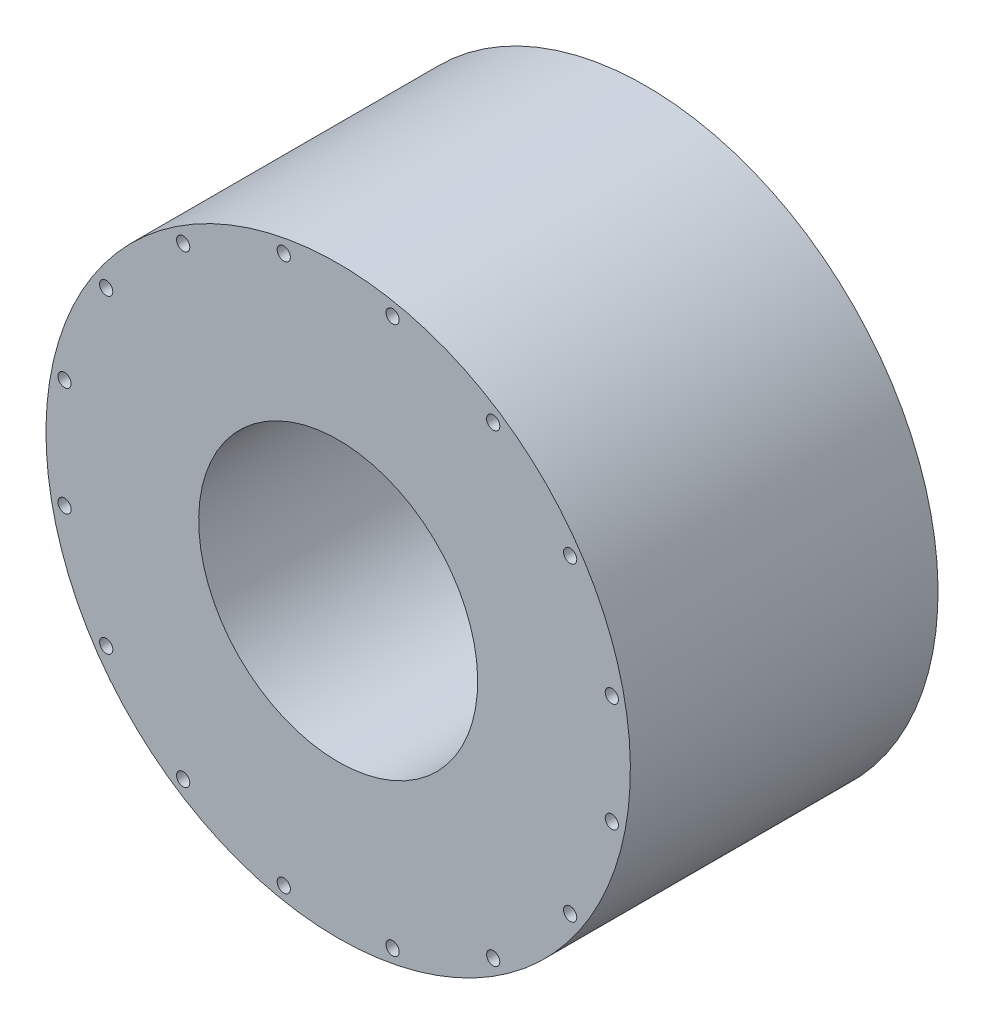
ISO-10303-21;
HEADER;
FILE_DESCRIPTION(('STEP AP214'),'2;1');
FILE_NAME('part.step','',(''),(''),'','','');
FILE_SCHEMA(('AUTOMOTIVE_DESIGN { 1 0 10303 214 1 1 1 1 }'));
ENDSEC;
DATA;
#1=APPLICATION_CONTEXT('core data for automotive mechanical design processes');
#2=APPLICATION_PROTOCOL_DEFINITION('international standard','automotive_design',2000,#1);
#3=PRODUCT_CONTEXT('',#1,'mechanical');
#4=PRODUCT('Part','Part','',(#3));
#5=PRODUCT_RELATED_PRODUCT_CATEGORY('part','',(#4));
#6=PRODUCT_DEFINITION_FORMATION('','',#4);
#7=PRODUCT_DEFINITION_CONTEXT('part definition',#1,'design');
#8=PRODUCT_DEFINITION('design','',#6,#7);
#9=PRODUCT_DEFINITION_SHAPE('','',#8);
#10=(LENGTH_UNIT() NAMED_UNIT(*) SI_UNIT(.MILLI.,.METRE.));
#11=(NAMED_UNIT(*) PLANE_ANGLE_UNIT() SI_UNIT($,.RADIAN.));
#12=(NAMED_UNIT(*) SI_UNIT($,.STERADIAN.) SOLID_ANGLE_UNIT());
#13=UNCERTAINTY_MEASURE_WITH_UNIT(LENGTH_MEASURE(1.E-05),#10,'distance_accuracy_value','');
#14=(GEOMETRIC_REPRESENTATION_CONTEXT(3) GLOBAL_UNCERTAINTY_ASSIGNED_CONTEXT((#13)) GLOBAL_UNIT_ASSIGNED_CONTEXT((#10,
#11,#12)) REPRESENTATION_CONTEXT('',''));
#15=CARTESIAN_POINT('',(0.,0.,0.));
#16=DIRECTION('',(0.,0.,1.));
#17=DIRECTION('',(1.,0.,0.));
#18=AXIS2_PLACEMENT_3D('',#15,#16,#17);
#19=CARTESIAN_POINT('',(0.,0.,0.));
#20=DIRECTION('',(0.,-1.74532925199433E-08,-1.));
#21=DIRECTION('',(0.,-1.,1.74532925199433E-08));
#22=AXIS2_PLACEMENT_3D('',#19,#20,#21);
#23=PLANE('',#22);
#24=CARTESIAN_POINT('',(0.,0.,0.));
#25=DIRECTION('',(0.,-1.74532925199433E-08,-1.));
#26=DIRECTION('',(0.,1.,-1.74532925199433E-08));
#27=AXIS2_PLACEMENT_3D('',#24,#25,#26);
#28=CIRCLE('',#27,199.);
#29=CARTESIAN_POINT('',(0.,-199.,3.47320522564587E-06));
#30=VERTEX_POINT('',#29);
#31=EDGE_CURVE('E40',#30,#30,#28,.T.);
#32=ORIENTED_EDGE('',*,*,#31,.F.);
#33=EDGE_LOOP('',(#32));
#34=FACE_BOUND('',#33,.T.);
#35=CARTESIAN_POINT('',(0.,0.,0.));
#36=DIRECTION('',(0.,-1.74532925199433E-08,-1.));
#37=DIRECTION('',(0.,1.,-1.74532925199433E-08));
#38=AXIS2_PLACEMENT_3D('',#35,#36,#37);
#39=CIRCLE('',#38,95.);
#40=CARTESIAN_POINT('',(0.,-95.,1.65806278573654E-06));
#41=VERTEX_POINT('',#40);
#42=EDGE_CURVE('E11',#41,#41,#39,.T.);
#43=ORIENTED_EDGE('',*,*,#42,.T.);
#44=EDGE_LOOP('',(#43));
#45=FACE_BOUND('',#44,.T.);
#46=CARTESIAN_POINT('',(37.06716118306,186.3492032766,-3.25240716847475E-06));
#47=DIRECTION('',(0.,1.74532925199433E-08,1.));
#48=DIRECTION('',(1.,0.,0.));
#49=AXIS2_PLACEMENT_3D('',#46,#47,#48);
#50=CIRCLE('',#49,4.5);
#51=CARTESIAN_POINT('',(32.56716118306,186.3492032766,-3.25240716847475E-06));
#52=VERTEX_POINT('',#51);
#53=EDGE_CURVE('E369',#52,#52,#50,.T.);
#54=ORIENTED_EDGE('',*,*,#53,.F.);
#55=EDGE_LOOP('',(#54));
#56=FACE_BOUND('',#55,.T.);
#57=CARTESIAN_POINT('',(105.5583442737,157.9792263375,-2.75725764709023E-06));
#58=DIRECTION('',(0.,1.74532925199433E-08,1.));
#59=DIRECTION('',(1.,0.,0.));
#60=AXIS2_PLACEMENT_3D('',#57,#58,#59);
#61=CIRCLE('',#60,4.5);
#62=CARTESIAN_POINT('',(101.0583442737,157.9792263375,-2.75725764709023E-06));
#63=VERTEX_POINT('',#62);
#64=EDGE_CURVE('E375',#63,#63,#61,.T.);
#65=ORIENTED_EDGE('',*,*,#64,.F.);
#66=EDGE_LOOP('',(#65));
#67=FACE_BOUND('',#66,.T.);
#68=CARTESIAN_POINT('',(157.9792263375,105.5583442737,-1.84234065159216E-06));
#69=DIRECTION('',(0.,1.74532925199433E-08,1.));
#70=DIRECTION('',(1.,0.,0.));
#71=AXIS2_PLACEMENT_3D('',#68,#69,#70);
#72=CIRCLE('',#71,4.5);
#73=CARTESIAN_POINT('',(153.4792263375,105.5583442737,-1.84234065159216E-06));
#74=VERTEX_POINT('',#73);
#75=EDGE_CURVE('E219',#74,#74,#72,.T.);
#76=ORIENTED_EDGE('',*,*,#75,.F.);
#77=EDGE_LOOP('',(#76));
#78=FACE_BOUND('',#77,.T.);
#79=CARTESIAN_POINT('',(186.3492032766,37.06716118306,-6.46944016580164E-07));
#80=DIRECTION('',(0.,1.74532925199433E-08,1.));
#81=DIRECTION('',(-1.,0.,0.));
#82=AXIS2_PLACEMENT_3D('',#79,#80,#81);
#83=CIRCLE('',#82,4.5);
#84=CARTESIAN_POINT('',(181.8492032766,37.06716118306,-6.46944016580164E-07));
#85=VERTEX_POINT('',#84);
#86=EDGE_CURVE('E220',#85,#85,#83,.T.);
#87=ORIENTED_EDGE('',*,*,#86,.F.);
#88=EDGE_LOOP('',(#87));
#89=FACE_BOUND('',#88,.T.);
#90=CARTESIAN_POINT('',(186.3492032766,-37.06716118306,6.46944016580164E-07));
#91=DIRECTION('',(0.,1.74532925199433E-08,1.));
#92=DIRECTION('',(-1.,0.,0.));
#93=AXIS2_PLACEMENT_3D('',#90,#91,#92);
#94=CIRCLE('',#93,4.5);
#95=CARTESIAN_POINT('',(181.8492032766,-37.06716118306,6.46944016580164E-07));
#96=VERTEX_POINT('',#95);
#97=EDGE_CURVE('E391',#96,#96,#94,.T.);
#98=ORIENTED_EDGE('',*,*,#97,.F.);
#99=EDGE_LOOP('',(#98));
#100=FACE_BOUND('',#99,.T.);
#101=CARTESIAN_POINT('',(157.9792263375,-105.5583442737,1.84234065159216E-06));
#102=DIRECTION('',(0.,1.74532925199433E-08,1.));
#103=DIRECTION('',(-1.,0.,0.));
#104=AXIS2_PLACEMENT_3D('',#101,#102,#103);
#105=CIRCLE('',#104,4.5);
#106=CARTESIAN_POINT('',(153.4792263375,-105.5583442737,1.84234065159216E-06));
#107=VERTEX_POINT('',#106);
#108=EDGE_CURVE('E418',#107,#107,#105,.T.);
#109=ORIENTED_EDGE('',*,*,#108,.F.);
#110=EDGE_LOOP('',(#109));
#111=FACE_BOUND('',#110,.T.);
#112=CARTESIAN_POINT('',(105.5583442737,-157.9792263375,2.75725764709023E-06));
#113=DIRECTION('',(0.,1.74532925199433E-08,1.));
#114=DIRECTION('',(-1.,0.,0.));
#115=AXIS2_PLACEMENT_3D('',#112,#113,#114);
#116=CIRCLE('',#115,4.5);
#117=CARTESIAN_POINT('',(101.0583442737,-157.9792263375,2.75725764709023E-06));
#118=VERTEX_POINT('',#117);
#119=EDGE_CURVE('E419',#118,#118,#116,.T.);
#120=ORIENTED_EDGE('',*,*,#119,.F.);
#121=EDGE_LOOP('',(#120));
#122=FACE_BOUND('',#121,.T.);
#123=CARTESIAN_POINT('',(37.06716118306,-186.3492032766,3.25240716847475E-06));
#124=DIRECTION('',(0.,1.74532925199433E-08,1.));
#125=DIRECTION('',(-1.,0.,0.));
#126=AXIS2_PLACEMENT_3D('',#123,#124,#125);
#127=CIRCLE('',#126,4.5);
#128=CARTESIAN_POINT('',(32.56716118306,-186.3492032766,3.25240716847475E-06));
#129=VERTEX_POINT('',#128);
#130=EDGE_CURVE('E404',#129,#129,#127,.T.);
#131=ORIENTED_EDGE('',*,*,#130,.F.);
#132=EDGE_LOOP('',(#131));
#133=FACE_BOUND('',#132,.T.);
#134=CARTESIAN_POINT('',(-37.06716118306,-186.3492032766,3.25240716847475E-06));
#135=DIRECTION('',(0.,1.74532925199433E-08,1.));
#136=DIRECTION('',(1.,0.,0.));
#137=AXIS2_PLACEMENT_3D('',#134,#135,#136);
#138=CIRCLE('',#137,4.5);
#139=CARTESIAN_POINT('',(-41.56716118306,-186.3492032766,3.25240716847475E-06));
#140=VERTEX_POINT('',#139);
#141=EDGE_CURVE('E411',#140,#140,#138,.T.);
#142=ORIENTED_EDGE('',*,*,#141,.F.);
#143=EDGE_LOOP('',(#142));
#144=FACE_BOUND('',#143,.T.);
#145=CARTESIAN_POINT('',(-105.5583442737,-157.9792263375,2.75725764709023E-06));
#146=DIRECTION('',(0.,1.74532925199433E-08,1.));
#147=DIRECTION('',(1.,0.,0.));
#148=AXIS2_PLACEMENT_3D('',#145,#146,#147);
#149=CIRCLE('',#148,4.5);
#150=CARTESIAN_POINT('',(-110.0583442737,-157.9792263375,2.75725764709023E-06));
#151=VERTEX_POINT('',#150);
#152=EDGE_CURVE('E380',#151,#151,#149,.T.);
#153=ORIENTED_EDGE('',*,*,#152,.F.);
#154=EDGE_LOOP('',(#153));
#155=FACE_BOUND('',#154,.T.);
#156=CARTESIAN_POINT('',(-157.9792263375,-105.5583442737,1.84234065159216E-06));
#157=DIRECTION('',(0.,1.74532925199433E-08,1.));
#158=DIRECTION('',(-1.,0.,0.));
#159=AXIS2_PLACEMENT_3D('',#156,#157,#158);
#160=CIRCLE('',#159,4.5);
#161=CARTESIAN_POINT('',(-162.4792263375,-105.5583442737,1.84234065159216E-06));
#162=VERTEX_POINT('',#161);
#163=EDGE_CURVE('E403',#162,#162,#160,.T.);
#164=ORIENTED_EDGE('',*,*,#163,.F.);
#165=EDGE_LOOP('',(#164));
#166=FACE_BOUND('',#165,.T.);
#167=CARTESIAN_POINT('',(-186.3492032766,-37.06716118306,6.46944016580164E-07));
#168=DIRECTION('',(0.,1.74532925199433E-08,1.));
#169=DIRECTION('',(-1.,0.,0.));
#170=AXIS2_PLACEMENT_3D('',#167,#168,#169);
#171=CIRCLE('',#170,4.5);
#172=CARTESIAN_POINT('',(-190.8492032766,-37.06716118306,6.46944016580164E-07));
#173=VERTEX_POINT('',#172);
#174=EDGE_CURVE('E198',#173,#173,#171,.T.);
#175=ORIENTED_EDGE('',*,*,#174,.F.);
#176=EDGE_LOOP('',(#175));
#177=FACE_BOUND('',#176,.T.);
#178=CARTESIAN_POINT('',(-186.3492032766,37.06716118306,-6.46944016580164E-07));
#179=DIRECTION('',(0.,1.74532925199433E-08,1.));
#180=DIRECTION('',(-1.,0.,0.));
#181=AXIS2_PLACEMENT_3D('',#178,#179,#180);
#182=CIRCLE('',#181,4.5);
#183=CARTESIAN_POINT('',(-190.8492032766,37.06716118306,-6.46944016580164E-07));
#184=VERTEX_POINT('',#183);
#185=EDGE_CURVE('E204',#184,#184,#182,.T.);
#186=ORIENTED_EDGE('',*,*,#185,.F.);
#187=EDGE_LOOP('',(#186));
#188=FACE_BOUND('',#187,.T.);
#189=CARTESIAN_POINT('',(-157.9792263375,105.5583442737,-1.84234065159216E-06));
#190=DIRECTION('',(0.,1.74532925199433E-08,1.));
#191=DIRECTION('',(1.,0.,0.));
#192=AXIS2_PLACEMENT_3D('',#189,#190,#191);
#193=CIRCLE('',#192,4.5);
#194=CARTESIAN_POINT('',(-162.4792263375,105.5583442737,-1.84234065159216E-06));
#195=VERTEX_POINT('',#194);
#196=EDGE_CURVE('E211',#195,#195,#193,.T.);
#197=ORIENTED_EDGE('',*,*,#196,.F.);
#198=EDGE_LOOP('',(#197));
#199=FACE_BOUND('',#198,.T.);
#200=CARTESIAN_POINT('',(-105.5583442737,157.9792263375,-2.75725764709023E-06));
#201=DIRECTION('',(0.,1.74532925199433E-08,1.));
#202=DIRECTION('',(-1.,0.,0.));
#203=AXIS2_PLACEMENT_3D('',#200,#201,#202);
#204=CIRCLE('',#203,4.5);
#205=CARTESIAN_POINT('',(-110.0583442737,157.9792263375,-2.75725764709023E-06));
#206=VERTEX_POINT('',#205);
#207=EDGE_CURVE('E398',#206,#206,#204,.T.);
#208=ORIENTED_EDGE('',*,*,#207,.F.);
#209=EDGE_LOOP('',(#208));
#210=FACE_BOUND('',#209,.T.);
#211=CARTESIAN_POINT('',(-37.06716118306,186.3492032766,-3.25240716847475E-06));
#212=DIRECTION('',(0.,1.74532925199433E-08,1.));
#213=DIRECTION('',(-1.,0.,0.));
#214=AXIS2_PLACEMENT_3D('',#211,#212,#213);
#215=CIRCLE('',#214,4.5);
#216=CARTESIAN_POINT('',(-41.56716118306,186.3492032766,-3.25240716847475E-06));
#217=VERTEX_POINT('',#216);
#218=EDGE_CURVE('E399',#217,#217,#215,.T.);
#219=ORIENTED_EDGE('',*,*,#218,.F.);
#220=EDGE_LOOP('',(#219));
#221=FACE_BOUND('',#220,.T.);
#222=ADVANCED_FACE('F17',(#34,#45,#56,#67,#78,#89,#100,#111,#122,#133,#144,#155,#166,#177,#188,
#199,#210,#221),#23,.F.);
#223=CARTESIAN_POINT('',(0.,1.82823239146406E-07,10.475));
#224=DIRECTION('',(0.,-1.74532925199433E-08,-1.));
#225=DIRECTION('',(0.,-1.,1.74532925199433E-08));
#226=AXIS2_PLACEMENT_3D('',#223,#224,#225);
#227=CYLINDRICAL_SURFACE('',#226,95.);
#228=CARTESIAN_POINT('',(0.,-3.65646478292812E-06,-209.5));
#229=DIRECTION('',(0.,-1.74532925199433E-08,-1.));
#230=DIRECTION('',(0.,1.,-1.74532925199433E-08));
#231=AXIS2_PLACEMENT_3D('',#228,#229,#230);
#232=CIRCLE('',#231,95.);
#233=CARTESIAN_POINT('',(0.,-95.0000036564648,-209.499998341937));
#234=VERTEX_POINT('',#233);
#235=EDGE_CURVE('E33',#234,#234,#232,.T.);
#236=ORIENTED_EDGE('',*,*,#235,.T.);
#237=EDGE_LOOP('',(#236));
#238=FACE_BOUND('',#237,.T.);
#239=ORIENTED_EDGE('',*,*,#42,.F.);
#240=EDGE_LOOP('',(#239));
#241=FACE_BOUND('',#240,.T.);
#242=ADVANCED_FACE('F327',(#238,#241),#227,.F.);
#243=CARTESIAN_POINT('',(0.,-3.65646478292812E-06,-209.5));
#244=DIRECTION('',(0.,-1.74532925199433E-08,-1.));
#245=DIRECTION('',(0.,-1.,1.74532925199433E-08));
#246=AXIS2_PLACEMENT_3D('',#243,#244,#245);
#247=PLANE('',#246);
#248=CARTESIAN_POINT('',(0.,-3.65646478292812E-06,-209.5));
#249=DIRECTION('',(0.,-1.74532925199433E-08,-1.));
#250=DIRECTION('',(0.,1.,-1.74532925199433E-08));
#251=AXIS2_PLACEMENT_3D('',#248,#249,#250);
#252=CIRCLE('',#251,199.);
#253=CARTESIAN_POINT('',(0.,-199.000003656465,-209.499996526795));
#254=VERTEX_POINT('',#253);
#255=EDGE_CURVE('E387',#254,#254,#252,.T.);
#256=ORIENTED_EDGE('',*,*,#255,.T.);
#257=EDGE_LOOP('',(#256));
#258=FACE_BOUND('',#257,.T.);
#259=ORIENTED_EDGE('',*,*,#235,.F.);
#260=EDGE_LOOP('',(#259));
#261=FACE_BOUND('',#260,.T.);
#262=ADVANCED_FACE('F248',(#258,#261),#247,.T.);
#263=CARTESIAN_POINT('',(0.,1.82823239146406E-07,10.475));
#264=DIRECTION('',(0.,-1.74532925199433E-08,-1.));
#265=DIRECTION('',(0.,-1.,1.74532925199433E-08));
#266=AXIS2_PLACEMENT_3D('',#263,#264,#265);
#267=CYLINDRICAL_SURFACE('',#266,199.);
#268=ORIENTED_EDGE('',*,*,#31,.T.);
#269=EDGE_LOOP('',(#268));
#270=FACE_BOUND('',#269,.T.);
#271=CARTESIAN_POINT('',(-164.978476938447,-111.279390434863,-151.499998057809));
#272=CARTESIAN_POINT('',(-165.190310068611,-110.965335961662,-151.500001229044));
#273=CARTESIAN_POINT('',(-165.40121552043,-110.650716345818,-151.484046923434));
#274=CARTESIAN_POINT('',(-165.819815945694,-110.02241443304,-151.420344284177));
#275=CARTESIAN_POINT('',(-166.027510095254,-109.708732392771,-151.372587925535));
#276=CARTESIAN_POINT('',(-166.438405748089,-109.084359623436,-151.245547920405));
#277=CARTESIAN_POINT('',(-166.64160238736,-108.773672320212,-151.166231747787));
#278=CARTESIAN_POINT('',(-167.041932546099,-108.157885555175,-150.976645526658));
#279=CARTESIAN_POINT('',(-167.239066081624,-107.852786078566,-150.866375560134));
#280=CARTESIAN_POINT('',(-167.62588989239,-107.250592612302,-150.615742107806));
#281=CARTESIAN_POINT('',(-167.815584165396,-106.953494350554,-150.475395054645));
#282=CARTESIAN_POINT('',(-168.186459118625,-106.369334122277,-150.165573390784));
#283=CARTESIAN_POINT('',(-168.367639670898,-106.0822723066,-149.996098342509));
#284=CARTESIAN_POINT('',(-168.720343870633,-105.520406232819,-149.629272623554));
#285=CARTESIAN_POINT('',(-168.891869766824,-105.245599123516,-149.431928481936));
#286=CARTESIAN_POINT('',(-169.224302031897,-104.71024517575,-149.010735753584));
#287=CARTESIAN_POINT('',(-169.385208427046,-104.449698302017,-148.786887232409));
#288=CARTESIAN_POINT('',(-169.695723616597,-103.944456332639,-148.313904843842));
#289=CARTESIAN_POINT('',(-169.845314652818,-103.699786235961,-148.064732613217));
#290=CARTESIAN_POINT('',(-170.13209363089,-103.228616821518,-147.543153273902));
#291=CARTESIAN_POINT('',(-170.269281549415,-103.002117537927,-147.270746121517));
#292=CARTESIAN_POINT('',(-170.530517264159,-102.569036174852,-146.704610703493));
#293=CARTESIAN_POINT('',(-170.654564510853,-102.362454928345,-146.410881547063));
#294=CARTESIAN_POINT('',(-170.888857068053,-101.970834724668,-145.804187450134));
#295=CARTESIAN_POINT('',(-170.999102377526,-101.785795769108,-145.491222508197));
#296=CARTESIAN_POINT('',(-171.205319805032,-101.438551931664,-144.847960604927));
#297=CARTESIAN_POINT('',(-171.301278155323,-101.276369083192,-144.517647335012));
#298=CARTESIAN_POINT('',(-171.478307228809,-100.976338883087,-143.842306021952));
#299=CARTESIAN_POINT('',(-171.559377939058,-100.838491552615,-143.497277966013));
#300=CARTESIAN_POINT('',(-171.706224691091,-100.588239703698,-142.794961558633));
#301=CARTESIAN_POINT('',(-171.772000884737,-100.475834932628,-142.437673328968));
#302=CARTESIAN_POINT('',(-171.887933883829,-100.27737482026,-141.713376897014));
#303=CARTESIAN_POINT('',(-171.938090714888,-100.191319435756,-141.346368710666));
#304=CARTESIAN_POINT('',(-172.022473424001,-100.04637004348,-140.605825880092));
#305=CARTESIAN_POINT('',(-172.056723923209,-99.9874340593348,-140.232302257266));
#306=CARTESIAN_POINT('',(-172.109242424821,-99.8970064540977,-139.480835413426));
#307=CARTESIAN_POINT('',(-172.127510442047,-99.865514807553,-139.10289219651));
#308=CARTESIAN_POINT('',(-172.147975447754,-99.8302331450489,-138.345286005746));
#309=CARTESIAN_POINT('',(-172.150172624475,-99.8264428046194,-137.965623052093));
#310=CARTESIAN_POINT('',(-172.138485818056,-99.8465938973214,-137.20728209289));
#311=CARTESIAN_POINT('',(-172.12460184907,-99.8705353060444,-136.828604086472));
#312=CARTESIAN_POINT('',(-172.080856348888,-99.9458915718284,-136.075560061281));
#313=CARTESIAN_POINT('',(-172.051021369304,-99.9972607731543,-135.701187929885));
#314=CARTESIAN_POINT('',(-171.975534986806,-100.127026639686,-134.958776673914));
#315=CARTESIAN_POINT('',(-171.92988360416,-100.205423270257,-134.590737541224));
#316=CARTESIAN_POINT('',(-171.8229862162,-100.388610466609,-133.863599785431));
#317=CARTESIAN_POINT('',(-171.76174013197,-100.493401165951,-133.50450120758));
#318=CARTESIAN_POINT('',(-171.623953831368,-100.728533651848,-132.797787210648));
#319=CARTESIAN_POINT('',(-171.54741359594,-100.858875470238,-132.450171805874));
#320=CARTESIAN_POINT('',(-171.379348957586,-101.144187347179,-131.768596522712));
#321=CARTESIAN_POINT('',(-171.287812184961,-101.299177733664,-131.434648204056));
#322=CARTESIAN_POINT('',(-171.090260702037,-101.632478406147,-130.783070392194));
#323=CARTESIAN_POINT('',(-170.984245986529,-101.810788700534,-130.46544090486));
#324=CARTESIAN_POINT('',(-170.758280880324,-102.189326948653,-129.848736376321));
#325=CARTESIAN_POINT('',(-170.638330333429,-102.389555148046,-129.549661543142));
#326=CARTESIAN_POINT('',(-170.385122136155,-102.810363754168,-128.972176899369));
#327=CARTESIAN_POINT('',(-170.251864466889,-103.030944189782,-128.693767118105));
#328=CARTESIAN_POINT('',(-169.972473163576,-103.49121427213,-128.159033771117));
#329=CARTESIAN_POINT('',(-169.826314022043,-103.73094168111,-127.902756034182));
#330=CARTESIAN_POINT('',(-169.522158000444,-104.227266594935,-127.414734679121));
#331=CARTESIAN_POINT('',(-169.364161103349,-104.483864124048,-127.182991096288));
#332=CARTESIAN_POINT('',(-169.03722654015,-105.011965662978,-126.745683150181));
#333=CARTESIAN_POINT('',(-168.868288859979,-105.283469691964,-126.54011882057));
#334=CARTESIAN_POINT('',(-168.520461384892,-105.839321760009,-126.156633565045));
#335=CARTESIAN_POINT('',(-168.34157159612,-106.123669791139,-125.978712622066));
#336=CARTESIAN_POINT('',(-167.97490743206,-106.703085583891,-125.651774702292));
#337=CARTESIAN_POINT('',(-167.78713248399,-106.99815403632,-125.502759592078));
#338=CARTESIAN_POINT('',(-167.403878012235,-107.596786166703,-125.234716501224));
#339=CARTESIAN_POINT('',(-167.208398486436,-107.900349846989,-125.115688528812));
#340=CARTESIAN_POINT('',(-166.81099309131,-108.513716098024,-124.908477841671));
#341=CARTESIAN_POINT('',(-166.609067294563,-108.823518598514,-124.820294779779));
#342=CARTESIAN_POINT('',(-166.200104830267,-109.447086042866,-124.675409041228));
#343=CARTESIAN_POINT('',(-165.993068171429,-109.760850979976,-124.618706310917));
#344=CARTESIAN_POINT('',(-165.575711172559,-110.38943059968,-124.537272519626));
#345=CARTESIAN_POINT('',(-165.365398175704,-110.704241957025,-124.512478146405));
#346=CARTESIAN_POINT('',(-164.942556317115,-111.333270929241,-124.494832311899));
#347=CARTESIAN_POINT('',(-164.730027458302,-111.647488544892,-124.501980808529));
#348=CARTESIAN_POINT('',(-164.304277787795,-112.273095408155,-124.548168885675));
#349=CARTESIAN_POINT('',(-164.091056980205,-112.584484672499,-124.587208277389));
#350=CARTESIAN_POINT('',(-163.665486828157,-113.202250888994,-124.696896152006));
#351=CARTESIAN_POINT('',(-163.453137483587,-113.508627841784,-124.767544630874));
#352=CARTESIAN_POINT('',(-163.031101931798,-114.113961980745,-124.939860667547));
#353=CARTESIAN_POINT('',(-162.821413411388,-114.412925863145,-125.041499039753));
#354=CARTESIAN_POINT('',(-162.406099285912,-115.001692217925,-125.275088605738));
#355=CARTESIAN_POINT('',(-162.20047367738,-115.291494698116,-125.407039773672));
#356=CARTESIAN_POINT('',(-161.794885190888,-115.859991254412,-125.700313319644));
#357=CARTESIAN_POINT('',(-161.594922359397,-116.138685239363,-125.861635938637));
#358=CARTESIAN_POINT('',(-161.202246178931,-116.683113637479,-126.212503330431));
#359=CARTESIAN_POINT('',(-161.009532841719,-116.948848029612,-126.40204814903));
#360=CARTESIAN_POINT('',(-160.632613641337,-117.466022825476,-126.808334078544));
#361=CARTESIAN_POINT('',(-160.448421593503,-117.717440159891,-127.025117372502));
#362=CARTESIAN_POINT('',(-160.090381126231,-118.20389852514,-127.484108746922));
#363=CARTESIAN_POINT('',(-159.916532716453,-118.438939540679,-127.726316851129));
#364=CARTESIAN_POINT('',(-159.58062763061,-118.891139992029,-128.234447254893));
#365=CARTESIAN_POINT('',(-159.41857107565,-119.108299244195,-128.50036979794));
#366=CARTESIAN_POINT('',(-159.107622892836,-119.523353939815,-129.054049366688));
#367=CARTESIAN_POINT('',(-158.958731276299,-119.721249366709,-129.341806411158));
#368=CARTESIAN_POINT('',(-158.675158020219,-120.096836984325,-129.937613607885));
#369=CARTESIAN_POINT('',(-158.540500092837,-120.274495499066,-130.245696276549));
#370=CARTESIAN_POINT('',(-158.286848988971,-120.608117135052,-130.879550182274));
#371=CARTESIAN_POINT('',(-158.167855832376,-120.764080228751,-131.205321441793));
#372=CARTESIAN_POINT('',(-157.946586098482,-121.053333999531,-131.872241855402));
#373=CARTESIAN_POINT('',(-157.844309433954,-121.18662479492,-132.213390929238));
#374=CARTESIAN_POINT('',(-157.65738588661,-121.429702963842,-132.908646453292));
#375=CARTESIAN_POINT('',(-157.572738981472,-121.539490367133,-133.262752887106));
#376=CARTESIAN_POINT('',(-157.4219026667,-121.734795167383,-133.981100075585));
#377=CARTESIAN_POINT('',(-157.355697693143,-121.820333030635,-134.34533199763));
#378=CARTESIAN_POINT('',(-157.242251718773,-121.96673085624,-135.081624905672));
#379=CARTESIAN_POINT('',(-157.195010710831,-122.027590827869,-135.453685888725));
#380=CARTESIAN_POINT('',(-157.119925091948,-122.124254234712,-136.202980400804));
#381=CARTESIAN_POINT('',(-157.092080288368,-122.160057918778,-136.580213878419));
#382=CARTESIAN_POINT('',(-157.056042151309,-122.206387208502,-137.337163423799));
#383=CARTESIAN_POINT('',(-157.047848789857,-122.216912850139,-137.71687948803));
#384=CARTESIAN_POINT('',(-157.051185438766,-122.212625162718,-138.475313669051));
#385=CARTESIAN_POINT('',(-157.062675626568,-122.197862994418,-138.854032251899));
#386=CARTESIAN_POINT('',(-157.105197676,-122.143189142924,-139.60854518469));
#387=CARTESIAN_POINT('',(-157.136229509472,-122.103277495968,-139.984339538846));
#388=CARTESIAN_POINT('',(-157.217551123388,-121.998551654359,-140.730332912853));
#389=CARTESIAN_POINT('',(-157.267840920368,-121.933737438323,-141.1005319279));
#390=CARTESIAN_POINT('',(-157.387220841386,-121.779607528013,-141.832706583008));
#391=CARTESIAN_POINT('',(-157.456310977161,-121.690291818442,-142.194682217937));
#392=CARTESIAN_POINT('',(-157.612665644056,-121.48771374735,-142.907838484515));
#393=CARTESIAN_POINT('',(-157.699929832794,-121.374451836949,-143.259019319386));
#394=CARTESIAN_POINT('',(-157.891851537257,-121.124682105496,-143.948110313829));
#395=CARTESIAN_POINT('',(-157.996509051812,-120.988174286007,-144.286020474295));
#396=CARTESIAN_POINT('',(-158.222286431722,-120.692763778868,-144.946177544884));
#397=CARTESIAN_POINT('',(-158.343405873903,-120.533861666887,-145.268424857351));
#398=CARTESIAN_POINT('',(-158.601047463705,-120.194649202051,-145.894995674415));
#399=CARTESIAN_POINT('',(-158.737569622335,-120.014338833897,-146.199319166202));
#400=CARTESIAN_POINT('',(-159.025108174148,-119.633075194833,-146.788460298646));
#401=CARTESIAN_POINT('',(-159.176151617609,-119.432083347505,-147.073239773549));
#402=CARTESIAN_POINT('',(-159.491219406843,-119.011010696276,-147.620646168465));
#403=CARTESIAN_POINT('',(-159.655243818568,-118.790929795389,-147.883272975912));
#404=CARTESIAN_POINT('',(-159.99492889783,-118.333024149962,-148.384578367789));
#405=CARTESIAN_POINT('',(-160.170592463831,-118.095194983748,-148.623250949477));
#406=CARTESIAN_POINT('',(-160.532052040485,-117.603375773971,-149.074877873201));
#407=CARTESIAN_POINT('',(-160.717847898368,-117.349385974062,-149.287832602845));
#408=CARTESIAN_POINT('',(-161.09831386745,-116.826531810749,-149.686791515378));
#409=CARTESIAN_POINT('',(-161.292995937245,-116.55764729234,-149.872757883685));
#410=CARTESIAN_POINT('',(-161.689416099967,-116.007104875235,-150.216057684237));
#411=CARTESIAN_POINT('',(-161.891154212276,-115.725446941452,-150.37339103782));
#412=CARTESIAN_POINT('',(-162.299870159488,-115.151537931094,-150.658147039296));
#413=CARTESIAN_POINT('',(-162.506842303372,-114.85929822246,-150.785600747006));
#414=CARTESIAN_POINT('',(-162.924540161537,-114.266033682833,-151.009859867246));
#415=CARTESIAN_POINT('',(-163.13526490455,-113.96501111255,-151.106673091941));
#416=CARTESIAN_POINT('',(-163.617592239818,-113.271832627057,-151.291468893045));
#417=CARTESIAN_POINT('',(-163.889907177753,-112.877505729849,-151.369597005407));
#418=CARTESIAN_POINT('',(-164.434813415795,-112.08222450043,-151.473859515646));
#419=CARTESIAN_POINT('',(-164.707404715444,-111.681270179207,-151.499993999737));
#420=CARTESIAN_POINT('',(-164.978476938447,-111.279390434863,-151.499998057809));
#421=B_SPLINE_CURVE_WITH_KNOTS('',3,(#271,#272,#273,#274,#275,#276,#277,#278,#279,#280,#281,
#282,#283,#284,#285,#286,#287,#288,#289,#290,#291,#292,#293,#294,#295,#296,#297,#298,#299,#300,
#301,#302,#303,#304,#305,#306,#307,#308,#309,#310,#311,#312,#313,#314,#315,#316,#317,#318,#319,
#320,#321,#322,#323,#324,#325,#326,#327,#328,#329,#330,#331,#332,#333,#334,#335,#336,#337,#338,
#339,#340,#341,#342,#343,#344,#345,#346,#347,#348,#349,#350,#351,#352,#353,#354,#355,#356,#357,
#358,#359,#360,#361,#362,#363,#364,#365,#366,#367,#368,#369,#370,#371,#372,#373,#374,#375,#376,
#377,#378,#379,#380,#381,#382,#383,#384,#385,#386,#387,#388,#389,#390,#391,#392,#393,#394,#395,
#396,#397,#398,#399,#400,#401,#402,#403,#404,#405,#406,#407,#408,#409,#410,#411,#412,#413,#414,
#415,#416,#417,#418,#419,#420),.UNSPECIFIED.,.T.,.F.,(4,2,2,2,2,2,2,2,2,2,2,2,2,2,2,2,2,2,2,2,2,
2,2,2,2,2,2,2,2,2,2,2,2,2,2,2,2,2,2,2,2,2,2,2,2,2,2,2,2,2,2,2,2,2,2,2,2,2,2,2,2,2,2,2,2,2,2,2,2,
2,2,2,2,2,4),(0.,1.13603197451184,2.2723507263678,3.40984363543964,4.54733353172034,
5.68420353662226,6.82109062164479,7.95771180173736,9.09433017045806,10.2326968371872,
11.3710656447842,12.5094820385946,13.6478985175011,14.7874050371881,15.9269125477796,
17.0664087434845,18.2059030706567,19.3436276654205,20.4813512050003,21.6190614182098,
22.7567706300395,23.8925919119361,25.0284117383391,26.1642373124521,27.3000643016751,
28.4368329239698,29.5736019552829,30.7103837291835,31.847167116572,32.9862506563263,
34.1253358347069,35.2644224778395,36.4035084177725,37.5426678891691,38.6818276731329,
39.820974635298,40.9601196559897,42.0970008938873,43.2338806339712,44.370753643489,
45.5076265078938,46.6434319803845,47.77923648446,48.9150503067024,50.050865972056,
51.1884628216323,52.3260607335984,53.4636703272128,54.6012808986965,55.7407577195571,
56.8802359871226,58.019708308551,59.1591791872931,60.2976854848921,61.4361913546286,
62.5746859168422,63.7131788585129,64.8493711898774,65.9855618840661,67.121753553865,
68.2579459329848,69.3941169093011,70.5302878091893,71.6664295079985,72.8025720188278,
73.9408735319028,75.0791808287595,76.2177726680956,77.3563473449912,78.4965022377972,
79.6366602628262,80.7756277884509,81.9143046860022,83.3680301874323,84.8217532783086),.UNSPECIFIED.);
#422=CARTESIAN_POINT('',(-164.9784769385,-111.279390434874,-151.499998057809));
#423=VERTEX_POINT('',#422);
#424=CARTESIAN_POINT('',(-164.9784769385,-111.279389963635,-124.499998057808));
#425=VERTEX_POINT('',#424);
#426=EDGE_CURVE('E228',#423,#425,#421,.F.);
#427=ORIENTED_EDGE('',*,*,#426,.F.);
#428=CARTESIAN_POINT('',(-164.978476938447,-111.279390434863,-151.499998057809));
#429=CARTESIAN_POINT('',(-165.190310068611,-110.965335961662,-151.500001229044));
#430=CARTESIAN_POINT('',(-165.40121552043,-110.650716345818,-151.484046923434));
#431=CARTESIAN_POINT('',(-165.819815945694,-110.02241443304,-151.420344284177));
#432=CARTESIAN_POINT('',(-166.027510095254,-109.708732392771,-151.372587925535));
#433=CARTESIAN_POINT('',(-166.438405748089,-109.084359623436,-151.245547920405));
#434=CARTESIAN_POINT('',(-166.64160238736,-108.773672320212,-151.166231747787));
#435=CARTESIAN_POINT('',(-167.041932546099,-108.157885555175,-150.976645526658));
#436=CARTESIAN_POINT('',(-167.239066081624,-107.852786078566,-150.866375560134));
#437=CARTESIAN_POINT('',(-167.62588989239,-107.250592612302,-150.615742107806));
#438=CARTESIAN_POINT('',(-167.815584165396,-106.953494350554,-150.475395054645));
#439=CARTESIAN_POINT('',(-168.186459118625,-106.369334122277,-150.165573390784));
#440=CARTESIAN_POINT('',(-168.367639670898,-106.0822723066,-149.996098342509));
#441=CARTESIAN_POINT('',(-168.720343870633,-105.520406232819,-149.629272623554));
#442=CARTESIAN_POINT('',(-168.891869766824,-105.245599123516,-149.431928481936));
#443=CARTESIAN_POINT('',(-169.224302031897,-104.71024517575,-149.010735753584));
#444=CARTESIAN_POINT('',(-169.385208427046,-104.449698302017,-148.786887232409));
#445=CARTESIAN_POINT('',(-169.695723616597,-103.944456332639,-148.313904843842));
#446=CARTESIAN_POINT('',(-169.845314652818,-103.699786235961,-148.064732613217));
#447=CARTESIAN_POINT('',(-170.13209363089,-103.228616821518,-147.543153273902));
#448=CARTESIAN_POINT('',(-170.269281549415,-103.002117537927,-147.270746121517));
#449=CARTESIAN_POINT('',(-170.530517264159,-102.569036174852,-146.704610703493));
#450=CARTESIAN_POINT('',(-170.654564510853,-102.362454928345,-146.410881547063));
#451=CARTESIAN_POINT('',(-170.888857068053,-101.970834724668,-145.804187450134));
#452=CARTESIAN_POINT('',(-170.999102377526,-101.785795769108,-145.491222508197));
#453=CARTESIAN_POINT('',(-171.205319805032,-101.438551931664,-144.847960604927));
#454=CARTESIAN_POINT('',(-171.301278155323,-101.276369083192,-144.517647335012));
#455=CARTESIAN_POINT('',(-171.478307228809,-100.976338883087,-143.842306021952));
#456=CARTESIAN_POINT('',(-171.559377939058,-100.838491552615,-143.497277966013));
#457=CARTESIAN_POINT('',(-171.706224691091,-100.588239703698,-142.794961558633));
#458=CARTESIAN_POINT('',(-171.772000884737,-100.475834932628,-142.437673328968));
#459=CARTESIAN_POINT('',(-171.887933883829,-100.27737482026,-141.713376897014));
#460=CARTESIAN_POINT('',(-171.938090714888,-100.191319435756,-141.346368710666));
#461=CARTESIAN_POINT('',(-172.022473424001,-100.04637004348,-140.605825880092));
#462=CARTESIAN_POINT('',(-172.056723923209,-99.9874340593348,-140.232302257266));
#463=CARTESIAN_POINT('',(-172.109242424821,-99.8970064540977,-139.480835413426));
#464=CARTESIAN_POINT('',(-172.127510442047,-99.865514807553,-139.10289219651));
#465=CARTESIAN_POINT('',(-172.147975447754,-99.8302331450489,-138.345286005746));
#466=CARTESIAN_POINT('',(-172.150172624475,-99.8264428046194,-137.965623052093));
#467=CARTESIAN_POINT('',(-172.138485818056,-99.8465938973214,-137.20728209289));
#468=CARTESIAN_POINT('',(-172.12460184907,-99.8705353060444,-136.828604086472));
#469=CARTESIAN_POINT('',(-172.080856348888,-99.9458915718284,-136.075560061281));
#470=CARTESIAN_POINT('',(-172.051021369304,-99.9972607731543,-135.701187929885));
#471=CARTESIAN_POINT('',(-171.975534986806,-100.127026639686,-134.958776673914));
#472=CARTESIAN_POINT('',(-171.92988360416,-100.205423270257,-134.590737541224));
#473=CARTESIAN_POINT('',(-171.8229862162,-100.388610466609,-133.863599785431));
#474=CARTESIAN_POINT('',(-171.76174013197,-100.493401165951,-133.50450120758));
#475=CARTESIAN_POINT('',(-171.623953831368,-100.728533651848,-132.797787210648));
#476=CARTESIAN_POINT('',(-171.54741359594,-100.858875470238,-132.450171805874));
#477=CARTESIAN_POINT('',(-171.379348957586,-101.144187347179,-131.768596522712));
#478=CARTESIAN_POINT('',(-171.287812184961,-101.299177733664,-131.434648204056));
#479=CARTESIAN_POINT('',(-171.090260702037,-101.632478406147,-130.783070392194));
#480=CARTESIAN_POINT('',(-170.984245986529,-101.810788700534,-130.46544090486));
#481=CARTESIAN_POINT('',(-170.758280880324,-102.189326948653,-129.848736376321));
#482=CARTESIAN_POINT('',(-170.638330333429,-102.389555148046,-129.549661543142));
#483=CARTESIAN_POINT('',(-170.385122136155,-102.810363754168,-128.972176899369));
#484=CARTESIAN_POINT('',(-170.251864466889,-103.030944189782,-128.693767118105));
#485=CARTESIAN_POINT('',(-169.972473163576,-103.49121427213,-128.159033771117));
#486=CARTESIAN_POINT('',(-169.826314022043,-103.73094168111,-127.902756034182));
#487=CARTESIAN_POINT('',(-169.522158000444,-104.227266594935,-127.414734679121));
#488=CARTESIAN_POINT('',(-169.364161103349,-104.483864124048,-127.182991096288));
#489=CARTESIAN_POINT('',(-169.03722654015,-105.011965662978,-126.745683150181));
#490=CARTESIAN_POINT('',(-168.868288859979,-105.283469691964,-126.54011882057));
#491=CARTESIAN_POINT('',(-168.520461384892,-105.839321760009,-126.156633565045));
#492=CARTESIAN_POINT('',(-168.34157159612,-106.123669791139,-125.978712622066));
#493=CARTESIAN_POINT('',(-167.97490743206,-106.703085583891,-125.651774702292));
#494=CARTESIAN_POINT('',(-167.78713248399,-106.99815403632,-125.502759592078));
#495=CARTESIAN_POINT('',(-167.403878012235,-107.596786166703,-125.234716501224));
#496=CARTESIAN_POINT('',(-167.208398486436,-107.900349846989,-125.115688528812));
#497=CARTESIAN_POINT('',(-166.81099309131,-108.513716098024,-124.908477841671));
#498=CARTESIAN_POINT('',(-166.609067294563,-108.823518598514,-124.820294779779));
#499=CARTESIAN_POINT('',(-166.200104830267,-109.447086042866,-124.675409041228));
#500=CARTESIAN_POINT('',(-165.993068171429,-109.760850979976,-124.618706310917));
#501=CARTESIAN_POINT('',(-165.575711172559,-110.38943059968,-124.537272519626));
#502=CARTESIAN_POINT('',(-165.365398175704,-110.704241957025,-124.512478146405));
#503=CARTESIAN_POINT('',(-164.942556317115,-111.333270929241,-124.494832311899));
#504=CARTESIAN_POINT('',(-164.730027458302,-111.647488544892,-124.501980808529));
#505=CARTESIAN_POINT('',(-164.304277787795,-112.273095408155,-124.548168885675));
#506=CARTESIAN_POINT('',(-164.091056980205,-112.584484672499,-124.587208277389));
#507=CARTESIAN_POINT('',(-163.665486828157,-113.202250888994,-124.696896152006));
#508=CARTESIAN_POINT('',(-163.453137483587,-113.508627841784,-124.767544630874));
#509=CARTESIAN_POINT('',(-163.031101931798,-114.113961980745,-124.939860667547));
#510=CARTESIAN_POINT('',(-162.821413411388,-114.412925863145,-125.041499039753));
#511=CARTESIAN_POINT('',(-162.406099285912,-115.001692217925,-125.275088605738));
#512=CARTESIAN_POINT('',(-162.20047367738,-115.291494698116,-125.407039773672));
#513=CARTESIAN_POINT('',(-161.794885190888,-115.859991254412,-125.700313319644));
#514=CARTESIAN_POINT('',(-161.594922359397,-116.138685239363,-125.861635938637));
#515=CARTESIAN_POINT('',(-161.202246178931,-116.683113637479,-126.212503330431));
#516=CARTESIAN_POINT('',(-161.009532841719,-116.948848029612,-126.40204814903));
#517=CARTESIAN_POINT('',(-160.632613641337,-117.466022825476,-126.808334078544));
#518=CARTESIAN_POINT('',(-160.448421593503,-117.717440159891,-127.025117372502));
#519=CARTESIAN_POINT('',(-160.090381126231,-118.20389852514,-127.484108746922));
#520=CARTESIAN_POINT('',(-159.916532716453,-118.438939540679,-127.726316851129));
#521=CARTESIAN_POINT('',(-159.58062763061,-118.891139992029,-128.234447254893));
#522=CARTESIAN_POINT('',(-159.41857107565,-119.108299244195,-128.50036979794));
#523=CARTESIAN_POINT('',(-159.107622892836,-119.523353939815,-129.054049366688));
#524=CARTESIAN_POINT('',(-158.958731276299,-119.721249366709,-129.341806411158));
#525=CARTESIAN_POINT('',(-158.675158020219,-120.096836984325,-129.937613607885));
#526=CARTESIAN_POINT('',(-158.540500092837,-120.274495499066,-130.245696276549));
#527=CARTESIAN_POINT('',(-158.286848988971,-120.608117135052,-130.879550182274));
#528=CARTESIAN_POINT('',(-158.167855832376,-120.764080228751,-131.205321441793));
#529=CARTESIAN_POINT('',(-157.946586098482,-121.053333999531,-131.872241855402));
#530=CARTESIAN_POINT('',(-157.844309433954,-121.18662479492,-132.213390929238));
#531=CARTESIAN_POINT('',(-157.65738588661,-121.429702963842,-132.908646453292));
#532=CARTESIAN_POINT('',(-157.572738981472,-121.539490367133,-133.262752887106));
#533=CARTESIAN_POINT('',(-157.4219026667,-121.734795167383,-133.981100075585));
#534=CARTESIAN_POINT('',(-157.355697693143,-121.820333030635,-134.34533199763));
#535=CARTESIAN_POINT('',(-157.242251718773,-121.96673085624,-135.081624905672));
#536=CARTESIAN_POINT('',(-157.195010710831,-122.027590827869,-135.453685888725));
#537=CARTESIAN_POINT('',(-157.119925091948,-122.124254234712,-136.202980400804));
#538=CARTESIAN_POINT('',(-157.092080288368,-122.160057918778,-136.580213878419));
#539=CARTESIAN_POINT('',(-157.056042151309,-122.206387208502,-137.337163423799));
#540=CARTESIAN_POINT('',(-157.047848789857,-122.216912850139,-137.71687948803));
#541=CARTESIAN_POINT('',(-157.051185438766,-122.212625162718,-138.475313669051));
#542=CARTESIAN_POINT('',(-157.062675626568,-122.197862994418,-138.854032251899));
#543=CARTESIAN_POINT('',(-157.105197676,-122.143189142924,-139.60854518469));
#544=CARTESIAN_POINT('',(-157.136229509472,-122.103277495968,-139.984339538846));
#545=CARTESIAN_POINT('',(-157.217551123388,-121.998551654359,-140.730332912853));
#546=CARTESIAN_POINT('',(-157.267840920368,-121.933737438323,-141.1005319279));
#547=CARTESIAN_POINT('',(-157.387220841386,-121.779607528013,-141.832706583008));
#548=CARTESIAN_POINT('',(-157.456310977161,-121.690291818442,-142.194682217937));
#549=CARTESIAN_POINT('',(-157.612665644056,-121.48771374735,-142.907838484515));
#550=CARTESIAN_POINT('',(-157.699929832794,-121.374451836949,-143.259019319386));
#551=CARTESIAN_POINT('',(-157.891851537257,-121.124682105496,-143.948110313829));
#552=CARTESIAN_POINT('',(-157.996509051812,-120.988174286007,-144.286020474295));
#553=CARTESIAN_POINT('',(-158.222286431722,-120.692763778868,-144.946177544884));
#554=CARTESIAN_POINT('',(-158.343405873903,-120.533861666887,-145.268424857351));
#555=CARTESIAN_POINT('',(-158.601047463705,-120.194649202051,-145.894995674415));
#556=CARTESIAN_POINT('',(-158.737569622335,-120.014338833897,-146.199319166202));
#557=CARTESIAN_POINT('',(-159.025108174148,-119.633075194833,-146.788460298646));
#558=CARTESIAN_POINT('',(-159.176151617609,-119.432083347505,-147.073239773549));
#559=CARTESIAN_POINT('',(-159.491219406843,-119.011010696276,-147.620646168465));
#560=CARTESIAN_POINT('',(-159.655243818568,-118.790929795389,-147.883272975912));
#561=CARTESIAN_POINT('',(-159.99492889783,-118.333024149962,-148.384578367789));
#562=CARTESIAN_POINT('',(-160.170592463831,-118.095194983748,-148.623250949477));
#563=CARTESIAN_POINT('',(-160.532052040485,-117.603375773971,-149.074877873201));
#564=CARTESIAN_POINT('',(-160.717847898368,-117.349385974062,-149.287832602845));
#565=CARTESIAN_POINT('',(-161.09831386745,-116.826531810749,-149.686791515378));
#566=CARTESIAN_POINT('',(-161.292995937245,-116.55764729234,-149.872757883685));
#567=CARTESIAN_POINT('',(-161.689416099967,-116.007104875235,-150.216057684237));
#568=CARTESIAN_POINT('',(-161.891154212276,-115.725446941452,-150.37339103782));
#569=CARTESIAN_POINT('',(-162.299870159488,-115.151537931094,-150.658147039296));
#570=CARTESIAN_POINT('',(-162.506842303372,-114.85929822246,-150.785600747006));
#571=CARTESIAN_POINT('',(-162.924540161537,-114.266033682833,-151.009859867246));
#572=CARTESIAN_POINT('',(-163.13526490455,-113.96501111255,-151.106673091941));
#573=CARTESIAN_POINT('',(-163.617592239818,-113.271832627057,-151.291468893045));
#574=CARTESIAN_POINT('',(-163.889907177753,-112.877505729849,-151.369597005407));
#575=CARTESIAN_POINT('',(-164.434813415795,-112.08222450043,-151.473859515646));
#576=CARTESIAN_POINT('',(-164.707404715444,-111.681270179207,-151.499993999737));
#577=CARTESIAN_POINT('',(-164.978476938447,-111.279390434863,-151.499998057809));
#578=B_SPLINE_CURVE_WITH_KNOTS('',3,(#428,#429,#430,#431,#432,#433,#434,#435,#436,#437,#438,
#439,#440,#441,#442,#443,#444,#445,#446,#447,#448,#449,#450,#451,#452,#453,#454,#455,#456,#457,
#458,#459,#460,#461,#462,#463,#464,#465,#466,#467,#468,#469,#470,#471,#472,#473,#474,#475,#476,
#477,#478,#479,#480,#481,#482,#483,#484,#485,#486,#487,#488,#489,#490,#491,#492,#493,#494,#495,
#496,#497,#498,#499,#500,#501,#502,#503,#504,#505,#506,#507,#508,#509,#510,#511,#512,#513,#514,
#515,#516,#517,#518,#519,#520,#521,#522,#523,#524,#525,#526,#527,#528,#529,#530,#531,#532,#533,
#534,#535,#536,#537,#538,#539,#540,#541,#542,#543,#544,#545,#546,#547,#548,#549,#550,#551,#552,
#553,#554,#555,#556,#557,#558,#559,#560,#561,#562,#563,#564,#565,#566,#567,#568,#569,#570,#571,
#572,#573,#574,#575,#576,#577),.UNSPECIFIED.,.T.,.F.,(4,2,2,2,2,2,2,2,2,2,2,2,2,2,2,2,2,2,2,2,2,
2,2,2,2,2,2,2,2,2,2,2,2,2,2,2,2,2,2,2,2,2,2,2,2,2,2,2,2,2,2,2,2,2,2,2,2,2,2,2,2,2,2,2,2,2,2,2,2,
2,2,2,2,2,4),(0.,1.13603197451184,2.2723507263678,3.40984363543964,4.54733353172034,
5.68420353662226,6.82109062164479,7.95771180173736,9.09433017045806,10.2326968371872,
11.3710656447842,12.5094820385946,13.6478985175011,14.7874050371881,15.9269125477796,
17.0664087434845,18.2059030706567,19.3436276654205,20.4813512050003,21.6190614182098,
22.7567706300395,23.8925919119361,25.0284117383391,26.1642373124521,27.3000643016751,
28.4368329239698,29.5736019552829,30.7103837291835,31.847167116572,32.9862506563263,
34.1253358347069,35.2644224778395,36.4035084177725,37.5426678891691,38.6818276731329,
39.820974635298,40.9601196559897,42.0970008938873,43.2338806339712,44.370753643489,
45.5076265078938,46.6434319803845,47.77923648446,48.9150503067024,50.050865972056,
51.1884628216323,52.3260607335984,53.4636703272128,54.6012808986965,55.7407577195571,
56.8802359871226,58.019708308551,59.1591791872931,60.2976854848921,61.4361913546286,
62.5746859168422,63.7131788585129,64.8493711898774,65.9855618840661,67.121753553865,
68.2579459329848,69.3941169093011,70.5302878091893,71.6664295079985,72.8025720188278,
73.9408735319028,75.0791808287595,76.2177726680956,77.3563473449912,78.4965022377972,
79.6366602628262,80.7756277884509,81.9143046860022,83.3680301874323,84.8217532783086),.UNSPECIFIED.);
#579=EDGE_CURVE('E235',#425,#423,#578,.F.);
#580=ORIENTED_EDGE('',*,*,#579,.F.);
#581=EDGE_LOOP('',(#427,#580));
#582=FACE_BOUND('',#581,.T.);
#583=CARTESIAN_POINT('',(-164.978476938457,-111.279388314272,-29.9999980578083));
#584=CARTESIAN_POINT('',(-164.766644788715,-111.593443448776,-29.9999948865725));
#585=CARTESIAN_POINT('',(-164.553941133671,-111.906850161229,-30.0159491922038));
#586=CARTESIAN_POINT('',(-164.128200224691,-112.530335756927,-30.0796518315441));
#587=CARTESIAN_POINT('',(-163.915162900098,-112.840413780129,-30.127408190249));
#588=CARTESIAN_POINT('',(-163.490178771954,-113.455283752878,-30.254448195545));
#589=CARTESIAN_POINT('',(-163.278233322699,-113.760069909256,-30.3337643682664));
#590=CARTESIAN_POINT('',(-162.857252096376,-114.361927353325,-30.5233505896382));
#591=CARTESIAN_POINT('',(-162.648216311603,-114.658998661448,-30.6336205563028));
#592=CARTESIAN_POINT('',(-162.234779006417,-115.243241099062,-30.8842540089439));
#593=CARTESIAN_POINT('',(-162.030375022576,-115.530417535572,-31.0246010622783));
#594=CARTESIAN_POINT('',(-161.627683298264,-116.093117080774,-31.334422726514));
#595=CARTESIAN_POINT('',(-161.429395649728,-116.368640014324,-31.5038977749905));
#596=CARTESIAN_POINT('',(-161.040567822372,-116.906140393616,-31.8707234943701));
#597=CARTESIAN_POINT('',(-160.850025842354,-117.16812099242,-32.0680676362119));
#598=CARTESIAN_POINT('',(-160.478185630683,-117.676893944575,-32.4892603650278));
#599=CARTESIAN_POINT('',(-160.296887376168,-117.923686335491,-32.7131088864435));
#600=CARTESIAN_POINT('',(-159.944756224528,-118.400857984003,-33.1860912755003));
#601=CARTESIAN_POINT('',(-159.773939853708,-118.631211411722,-33.4352635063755));
#602=CARTESIAN_POINT('',(-159.44450848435,-119.073611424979,-33.9568428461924));
#603=CARTESIAN_POINT('',(-159.285893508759,-119.285657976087,-34.2292499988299));
#604=CARTESIAN_POINT('',(-158.982208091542,-119.690106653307,-34.7953854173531));
#605=CARTESIAN_POINT('',(-158.837138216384,-119.882507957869,-35.0891145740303));
#606=CARTESIAN_POINT('',(-158.561801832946,-120.246443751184,-35.6958086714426));
#607=CARTESIAN_POINT('',(-158.431535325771,-120.417978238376,-36.0087736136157));
#608=CARTESIAN_POINT('',(-158.186826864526,-120.739259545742,-36.6520355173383));
#609=CARTESIAN_POINT('',(-158.072400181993,-120.888985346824,-36.9823487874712));
#610=CARTESIAN_POINT('',(-157.860533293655,-121.165517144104,-37.6576901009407));
#611=CARTESIAN_POINT('',(-157.763093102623,-121.292323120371,-38.002718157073));
#612=CARTESIAN_POINT('',(-157.586073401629,-121.522223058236,-38.7050345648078));
#613=CARTESIAN_POINT('',(-157.506493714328,-121.625317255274,-39.062322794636));
#614=CARTESIAN_POINT('',(-157.365913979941,-121.807152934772,-39.7866192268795));
#615=CARTESIAN_POINT('',(-157.304913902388,-121.885894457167,-40.1536274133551));
#616=CARTESIAN_POINT('',(-157.202129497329,-122.018431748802,-40.8941702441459));
#617=CARTESIAN_POINT('',(-157.160315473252,-122.072266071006,-41.267693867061));
#618=CARTESIAN_POINT('',(-157.096146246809,-122.154835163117,-42.0191607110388));
#619=CARTESIAN_POINT('',(-157.073791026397,-122.183569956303,-42.3971039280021));
#620=CARTESIAN_POINT('',(-157.048744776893,-122.215761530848,-43.15471011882));
#621=CARTESIAN_POINT('',(-157.046053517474,-122.21921860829,-43.5343730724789));
#622=CARTESIAN_POINT('',(-157.06035934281,-122.200834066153,-44.2927140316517));
#623=CARTESIAN_POINT('',(-157.077356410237,-122.178992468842,-44.6713920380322));
#624=CARTESIAN_POINT('',(-157.130838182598,-122.110203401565,-45.4244360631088));
#625=CARTESIAN_POINT('',(-157.167290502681,-122.063297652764,-45.7988081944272));
#626=CARTESIAN_POINT('',(-157.25932963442,-121.944696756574,-46.5412194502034));
#627=CARTESIAN_POINT('',(-157.314916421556,-121.87300164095,-46.9092585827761));
#628=CARTESIAN_POINT('',(-157.444720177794,-121.705264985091,-47.6363963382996));
#629=CARTESIAN_POINT('',(-157.518937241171,-121.609223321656,-47.9954949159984));
#630=CARTESIAN_POINT('',(-157.685332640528,-121.393387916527,-48.7022089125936));
#631=CARTESIAN_POINT('',(-157.777510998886,-121.273594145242,-49.0498243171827));
#632=CARTESIAN_POINT('',(-157.979089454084,-121.010887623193,-49.731399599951));
#633=CARTESIAN_POINT('',(-158.088503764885,-120.867955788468,-50.0653479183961));
#634=CARTESIAN_POINT('',(-158.323530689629,-120.559932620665,-50.7169257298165));
#635=CARTESIAN_POINT('',(-158.449143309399,-120.394841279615,-51.0345552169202));
#636=CARTESIAN_POINT('',(-158.715469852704,-120.043527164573,-51.6512597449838));
#637=CARTESIAN_POINT('',(-158.8561839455,-119.857304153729,-51.9503345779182));
#638=CARTESIAN_POINT('',(-159.151497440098,-119.464895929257,-52.527819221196));
#639=CARTESIAN_POINT('',(-159.306096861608,-119.258710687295,-52.8062290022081));
#640=CARTESIAN_POINT('',(-159.62819003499,-118.827243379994,-53.3409623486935));
#641=CARTESIAN_POINT('',(-159.795709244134,-118.601923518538,-53.5972400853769));
#642=CARTESIAN_POINT('',(-160.141954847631,-118.133988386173,-54.0852614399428));
#643=CARTESIAN_POINT('',(-160.320681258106,-117.891373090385,-54.3170050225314));
#644=CARTESIAN_POINT('',(-160.687856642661,-117.390414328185,-54.7543129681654));
#645=CARTESIAN_POINT('',(-160.876305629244,-117.132070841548,-54.9598772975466));
#646=CARTESIAN_POINT('',(-161.26138423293,-116.601344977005,-55.3433625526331));
#647=CARTESIAN_POINT('',(-161.458013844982,-116.328962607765,-55.5212834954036));
#648=CARTESIAN_POINT('',(-161.857884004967,-115.771944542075,-55.8482214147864));
#649=CARTESIAN_POINT('',(-162.061124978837,-115.487308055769,-55.9972365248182));
#650=CARTESIAN_POINT('',(-162.472597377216,-114.907709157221,-56.26527961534));
#651=CARTESIAN_POINT('',(-162.680828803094,-114.612746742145,-56.3843075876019));
#652=CARTESIAN_POINT('',(-163.10066141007,-114.014507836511,-56.5915182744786));
#653=CARTESIAN_POINT('',(-163.312262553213,-113.711231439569,-56.6797013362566));
#654=CARTESIAN_POINT('',(-163.73722418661,-113.098455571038,-56.8245870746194));
#655=CARTESIAN_POINT('',(-163.950584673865,-112.788956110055,-56.8812898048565));
#656=CARTESIAN_POINT('',(-164.377048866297,-112.166519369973,-56.9627235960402));
#657=CARTESIAN_POINT('',(-164.59015223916,-111.85359014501,-56.9875179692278));
#658=CARTESIAN_POINT('',(-165.014978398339,-111.225899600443,-57.0051638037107));
#659=CARTESIAN_POINT('',(-165.226701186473,-110.911138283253,-56.9980153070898));
#660=CARTESIAN_POINT('',(-165.647265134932,-110.282033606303,-56.9518272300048));
#661=CARTESIAN_POINT('',(-165.85610631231,-109.96769024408,-56.9127878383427));
#662=CARTESIAN_POINT('',(-166.269467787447,-109.34168917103,-56.8030999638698));
#663=CARTESIAN_POINT('',(-166.473988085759,-109.03003145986,-56.7324514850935));
#664=CARTESIAN_POINT('',(-166.877146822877,-108.411964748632,-56.5601354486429));
#665=CARTESIAN_POINT('',(-167.075790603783,-108.105551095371,-56.4584970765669));
#666=CARTESIAN_POINT('',(-167.466105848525,-107.499922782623,-56.2249075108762));
#667=CARTESIAN_POINT('',(-167.657777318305,-107.200708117,-56.0929563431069));
#668=CARTESIAN_POINT('',(-168.03294202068,-106.611690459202,-55.7996827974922));
#669=CARTESIAN_POINT('',(-168.216435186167,-106.321887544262,-55.6383601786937));
#670=CARTESIAN_POINT('',(-168.574121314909,-105.753858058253,-55.287492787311));
#671=CARTESIAN_POINT('',(-168.748314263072,-105.475631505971,-55.0979479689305));
#672=CARTESIAN_POINT('',(-169.086633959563,-104.932421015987,-54.691662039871));
#673=CARTESIAN_POINT('',(-169.25074449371,-104.667458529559,-54.4748787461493));
#674=CARTESIAN_POINT('',(-169.56765650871,-104.153258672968,-54.015887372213));
#675=CARTESIAN_POINT('',(-169.720457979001,-103.904021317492,-53.7736792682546));
#676=CARTESIAN_POINT('',(-170.013898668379,-103.423178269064,-53.26554886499));
#677=CARTESIAN_POINT('',(-170.15453776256,-103.191572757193,-52.9996263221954));
#678=CARTESIAN_POINT('',(-170.422886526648,-102.74778439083,-52.4459467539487));
#679=CARTESIAN_POINT('',(-170.550596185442,-102.535601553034,-52.1581897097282));
#680=CARTESIAN_POINT('',(-170.792606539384,-102.131979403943,-51.5623825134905));
#681=CARTESIAN_POINT('',(-170.906884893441,-101.940574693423,-51.2542998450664));
#682=CARTESIAN_POINT('',(-171.121194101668,-101.58041661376,-50.6204459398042));
#683=CARTESIAN_POINT('',(-171.221224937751,-101.411663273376,-50.2946746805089));
#684=CARTESIAN_POINT('',(-171.406527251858,-101.098149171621,-49.627754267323));
#685=CARTESIAN_POINT('',(-171.491798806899,-100.953388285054,-49.2866051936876));
#686=CARTESIAN_POINT('',(-171.647154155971,-100.689017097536,-48.5913496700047));
#687=CARTESIAN_POINT('',(-171.71723796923,-100.569406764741,-48.237243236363));
#688=CARTESIAN_POINT('',(-171.841817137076,-100.356391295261,-47.5188960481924));
#689=CARTESIAN_POINT('',(-171.896325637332,-100.262964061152,-47.1546641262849));
#690=CARTESIAN_POINT('',(-171.989565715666,-100.102937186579,-46.4183712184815));
#691=CARTESIAN_POINT('',(-172.028297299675,-100.036337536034,-46.0463102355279));
#692=CARTESIAN_POINT('',(-172.089794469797,-99.9305086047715,-45.297015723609));
#693=CARTESIAN_POINT('',(-172.11256021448,-99.8912790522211,-44.9197822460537));
#694=CARTESIAN_POINT('',(-172.142015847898,-99.8405098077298,-44.162832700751));
#695=CARTESIAN_POINT('',(-172.148705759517,-99.8289700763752,-43.7831166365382));
#696=CARTESIAN_POINT('',(-172.145980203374,-99.8336699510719,-43.0246824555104));
#697=CARTESIAN_POINT('',(-172.13659725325,-99.8498534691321,-42.6459638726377));
#698=CARTESIAN_POINT('',(-172.101833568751,-99.9097604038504,-41.8914509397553));
#699=CARTESIAN_POINT('',(-172.076452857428,-99.9534837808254,-41.5156565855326));
#700=CARTESIAN_POINT('',(-172.00981634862,-100.068114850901,-40.7696632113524));
#701=CARTESIAN_POINT('',(-171.968560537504,-100.139022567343,-40.3994641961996));
#702=CARTESIAN_POINT('',(-171.870374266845,-100.307447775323,-39.6672895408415));
#703=CARTESIAN_POINT('',(-171.813443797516,-100.404965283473,-39.30531390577));
#704=CARTESIAN_POINT('',(-171.684188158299,-100.625821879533,-38.5921576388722));
#705=CARTESIAN_POINT('',(-171.611863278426,-100.749160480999,-38.2409768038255));
#706=CARTESIAN_POINT('',(-171.452175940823,-101.020672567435,-37.5518858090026));
#707=CARTESIAN_POINT('',(-171.364813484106,-101.168846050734,-37.2139756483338));
#708=CARTESIAN_POINT('',(-171.175491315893,-101.488845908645,-36.5538185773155));
#709=CARTESIAN_POINT('',(-171.073531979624,-101.660671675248,-36.2315712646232));
#710=CARTESIAN_POINT('',(-170.855533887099,-102.026624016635,-35.6050004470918));
#711=CARTESIAN_POINT('',(-170.739495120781,-102.220750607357,-35.3006769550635));
#712=CARTESIAN_POINT('',(-170.493707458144,-102.630175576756,-34.7115358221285));
#713=CARTESIAN_POINT('',(-170.363932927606,-102.845513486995,-34.4267563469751));
#714=CARTESIAN_POINT('',(-170.091547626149,-103.295375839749,-33.8793499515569));
#715=CARTESIAN_POINT('',(-169.948936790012,-103.529900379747,-33.616723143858));
#716=CARTESIAN_POINT('',(-169.651622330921,-104.016385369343,-33.1154177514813));
#717=CARTESIAN_POINT('',(-169.496915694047,-104.26835016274,-32.8767451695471));
#718=CARTESIAN_POINT('',(-169.176313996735,-104.787728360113,-32.4251182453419));
#719=CARTESIAN_POINT('',(-169.01041910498,-105.05514153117,-32.2121635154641));
#720=CARTESIAN_POINT('',(-168.668162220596,-105.603768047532,-31.8132046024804));
#721=CARTESIAN_POINT('',(-168.49178602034,-105.885000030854,-31.6272382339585));
#722=CARTESIAN_POINT('',(-168.12983358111,-106.458791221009,-31.2839384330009));
#723=CARTESIAN_POINT('',(-167.944257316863,-106.751350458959,-31.1266050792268));
#724=CARTESIAN_POINT('',(-167.565245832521,-107.34529538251,-30.8418490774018));
#725=CARTESIAN_POINT('',(-167.371819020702,-107.646671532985,-30.7143953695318));
#726=CARTESIAN_POINT('',(-166.978226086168,-108.256195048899,-30.4901362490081));
#727=CARTESIAN_POINT('',(-166.778061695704,-108.564340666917,-30.3933230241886));
#728=CARTESIAN_POINT('',(-166.316040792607,-109.271216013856,-30.2085272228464));
#729=CARTESIAN_POINT('',(-166.052438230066,-109.671419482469,-30.1303991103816));
#730=CARTESIAN_POINT('',(-165.519191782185,-110.474565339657,-30.0261366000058));
#731=CARTESIAN_POINT('',(-165.249547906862,-110.87750772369,-30.0000021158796));
#732=CARTESIAN_POINT('',(-164.978476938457,-111.279388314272,-29.9999980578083));
#733=B_SPLINE_CURVE_WITH_KNOTS('',3,(#583,#584,#585,#586,#587,#588,#589,#590,#591,#592,#593,
#594,#595,#596,#597,#598,#599,#600,#601,#602,#603,#604,#605,#606,#607,#608,#609,#610,#611,#612,
#613,#614,#615,#616,#617,#618,#619,#620,#621,#622,#623,#624,#625,#626,#627,#628,#629,#630,#631,
#632,#633,#634,#635,#636,#637,#638,#639,#640,#641,#642,#643,#644,#645,#646,#647,#648,#649,#650,
#651,#652,#653,#654,#655,#656,#657,#658,#659,#660,#661,#662,#663,#664,#665,#666,#667,#668,#669,
#670,#671,#672,#673,#674,#675,#676,#677,#678,#679,#680,#681,#682,#683,#684,#685,#686,#687,#688,
#689,#690,#691,#692,#693,#694,#695,#696,#697,#698,#699,#700,#701,#702,#703,#704,#705,#706,#707,
#708,#709,#710,#711,#712,#713,#714,#715,#716,#717,#718,#719,#720,#721,#722,#723,#724,#725,#726,
#727,#728,#729,#730,#731,#732),.UNSPECIFIED.,.T.,.F.,(4,2,2,2,2,2,2,2,2,2,2,2,2,2,2,2,2,2,2,2,2,
2,2,2,2,2,2,2,2,2,2,2,2,2,2,2,2,2,2,2,2,2,2,2,2,2,2,2,2,2,2,2,2,2,2,2,2,2,2,2,2,2,2,2,2,2,2,2,2,
2,2,2,2,2,4),(0.,1.13603197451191,2.27235072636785,3.4098436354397,4.54733353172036,
5.68420353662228,6.82109062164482,7.95771180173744,9.09433017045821,10.2326968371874,
11.3710656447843,12.5094820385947,13.6478985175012,14.7874050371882,15.9269125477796,
17.0664087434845,18.2059030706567,19.3436276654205,20.4813512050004,21.6190614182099,
22.7567706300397,23.8925919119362,25.0284117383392,26.1642373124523,27.3000643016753,
28.4368329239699,29.573601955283,30.7103837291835,31.8471671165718,32.9862506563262,
34.1253358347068,35.2644224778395,36.4035084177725,37.5426678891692,38.681827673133,
39.8209746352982,40.9601196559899,42.0970008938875,43.2338806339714,44.3707536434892,
45.5076265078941,46.6434319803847,47.7792364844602,48.9150503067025,50.0508659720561,
51.1884628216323,52.3260607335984,53.4636703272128,54.6012808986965,55.7407577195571,
56.8802359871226,58.019708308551,59.159179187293,60.297685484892,61.4361913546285,
62.5746859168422,63.7131788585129,64.8493711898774,65.9855618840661,67.1217535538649,
68.2579459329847,69.3941169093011,70.5302878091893,71.6664295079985,72.8025720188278,
73.9408735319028,75.0791808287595,76.2177726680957,77.3563473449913,78.4965022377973,
79.6366602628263,80.7756277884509,81.9143046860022,83.3680301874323,84.8217532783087),.UNSPECIFIED.);
#734=CARTESIAN_POINT('',(-164.9784769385,-111.279388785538,-56.9999980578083));
#735=VERTEX_POINT('',#734);
#736=CARTESIAN_POINT('',(-164.9784769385,-111.279388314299,-29.9999980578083));
#737=VERTEX_POINT('',#736);
#738=EDGE_CURVE('E260',#735,#737,#733,.F.);
#739=ORIENTED_EDGE('',*,*,#738,.F.);
#740=CARTESIAN_POINT('',(-164.978476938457,-111.279388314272,-29.9999980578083));
#741=CARTESIAN_POINT('',(-164.766644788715,-111.593443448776,-29.9999948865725));
#742=CARTESIAN_POINT('',(-164.553941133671,-111.906850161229,-30.0159491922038));
#743=CARTESIAN_POINT('',(-164.128200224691,-112.530335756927,-30.0796518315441));
#744=CARTESIAN_POINT('',(-163.915162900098,-112.840413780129,-30.127408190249));
#745=CARTESIAN_POINT('',(-163.490178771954,-113.455283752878,-30.254448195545));
#746=CARTESIAN_POINT('',(-163.278233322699,-113.760069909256,-30.3337643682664));
#747=CARTESIAN_POINT('',(-162.857252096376,-114.361927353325,-30.5233505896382));
#748=CARTESIAN_POINT('',(-162.648216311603,-114.658998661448,-30.6336205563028));
#749=CARTESIAN_POINT('',(-162.234779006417,-115.243241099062,-30.8842540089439));
#750=CARTESIAN_POINT('',(-162.030375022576,-115.530417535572,-31.0246010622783));
#751=CARTESIAN_POINT('',(-161.627683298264,-116.093117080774,-31.334422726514));
#752=CARTESIAN_POINT('',(-161.429395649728,-116.368640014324,-31.5038977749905));
#753=CARTESIAN_POINT('',(-161.040567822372,-116.906140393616,-31.8707234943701));
#754=CARTESIAN_POINT('',(-160.850025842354,-117.16812099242,-32.0680676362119));
#755=CARTESIAN_POINT('',(-160.478185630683,-117.676893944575,-32.4892603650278));
#756=CARTESIAN_POINT('',(-160.296887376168,-117.923686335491,-32.7131088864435));
#757=CARTESIAN_POINT('',(-159.944756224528,-118.400857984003,-33.1860912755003));
#758=CARTESIAN_POINT('',(-159.773939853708,-118.631211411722,-33.4352635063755));
#759=CARTESIAN_POINT('',(-159.44450848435,-119.073611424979,-33.9568428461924));
#760=CARTESIAN_POINT('',(-159.285893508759,-119.285657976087,-34.2292499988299));
#761=CARTESIAN_POINT('',(-158.982208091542,-119.690106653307,-34.7953854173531));
#762=CARTESIAN_POINT('',(-158.837138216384,-119.882507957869,-35.0891145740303));
#763=CARTESIAN_POINT('',(-158.561801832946,-120.246443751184,-35.6958086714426));
#764=CARTESIAN_POINT('',(-158.431535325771,-120.417978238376,-36.0087736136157));
#765=CARTESIAN_POINT('',(-158.186826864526,-120.739259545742,-36.6520355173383));
#766=CARTESIAN_POINT('',(-158.072400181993,-120.888985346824,-36.9823487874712));
#767=CARTESIAN_POINT('',(-157.860533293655,-121.165517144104,-37.6576901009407));
#768=CARTESIAN_POINT('',(-157.763093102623,-121.292323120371,-38.002718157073));
#769=CARTESIAN_POINT('',(-157.586073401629,-121.522223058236,-38.7050345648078));
#770=CARTESIAN_POINT('',(-157.506493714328,-121.625317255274,-39.062322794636));
#771=CARTESIAN_POINT('',(-157.365913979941,-121.807152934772,-39.7866192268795));
#772=CARTESIAN_POINT('',(-157.304913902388,-121.885894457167,-40.1536274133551));
#773=CARTESIAN_POINT('',(-157.202129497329,-122.018431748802,-40.8941702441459));
#774=CARTESIAN_POINT('',(-157.160315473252,-122.072266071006,-41.267693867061));
#775=CARTESIAN_POINT('',(-157.096146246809,-122.154835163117,-42.0191607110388));
#776=CARTESIAN_POINT('',(-157.073791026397,-122.183569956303,-42.3971039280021));
#777=CARTESIAN_POINT('',(-157.048744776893,-122.215761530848,-43.15471011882));
#778=CARTESIAN_POINT('',(-157.046053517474,-122.21921860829,-43.5343730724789));
#779=CARTESIAN_POINT('',(-157.06035934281,-122.200834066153,-44.2927140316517));
#780=CARTESIAN_POINT('',(-157.077356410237,-122.178992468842,-44.6713920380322));
#781=CARTESIAN_POINT('',(-157.130838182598,-122.110203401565,-45.4244360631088));
#782=CARTESIAN_POINT('',(-157.167290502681,-122.063297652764,-45.7988081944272));
#783=CARTESIAN_POINT('',(-157.25932963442,-121.944696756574,-46.5412194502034));
#784=CARTESIAN_POINT('',(-157.314916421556,-121.87300164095,-46.9092585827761));
#785=CARTESIAN_POINT('',(-157.444720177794,-121.705264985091,-47.6363963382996));
#786=CARTESIAN_POINT('',(-157.518937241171,-121.609223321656,-47.9954949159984));
#787=CARTESIAN_POINT('',(-157.685332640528,-121.393387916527,-48.7022089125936));
#788=CARTESIAN_POINT('',(-157.777510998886,-121.273594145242,-49.0498243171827));
#789=CARTESIAN_POINT('',(-157.979089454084,-121.010887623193,-49.731399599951));
#790=CARTESIAN_POINT('',(-158.088503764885,-120.867955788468,-50.0653479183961));
#791=CARTESIAN_POINT('',(-158.323530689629,-120.559932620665,-50.7169257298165));
#792=CARTESIAN_POINT('',(-158.449143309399,-120.394841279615,-51.0345552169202));
#793=CARTESIAN_POINT('',(-158.715469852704,-120.043527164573,-51.6512597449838));
#794=CARTESIAN_POINT('',(-158.8561839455,-119.857304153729,-51.9503345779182));
#795=CARTESIAN_POINT('',(-159.151497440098,-119.464895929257,-52.527819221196));
#796=CARTESIAN_POINT('',(-159.306096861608,-119.258710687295,-52.8062290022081));
#797=CARTESIAN_POINT('',(-159.62819003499,-118.827243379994,-53.3409623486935));
#798=CARTESIAN_POINT('',(-159.795709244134,-118.601923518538,-53.5972400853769));
#799=CARTESIAN_POINT('',(-160.141954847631,-118.133988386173,-54.0852614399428));
#800=CARTESIAN_POINT('',(-160.320681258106,-117.891373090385,-54.3170050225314));
#801=CARTESIAN_POINT('',(-160.687856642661,-117.390414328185,-54.7543129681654));
#802=CARTESIAN_POINT('',(-160.876305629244,-117.132070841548,-54.9598772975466));
#803=CARTESIAN_POINT('',(-161.26138423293,-116.601344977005,-55.3433625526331));
#804=CARTESIAN_POINT('',(-161.458013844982,-116.328962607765,-55.5212834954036));
#805=CARTESIAN_POINT('',(-161.857884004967,-115.771944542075,-55.8482214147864));
#806=CARTESIAN_POINT('',(-162.061124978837,-115.487308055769,-55.9972365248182));
#807=CARTESIAN_POINT('',(-162.472597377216,-114.907709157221,-56.26527961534));
#808=CARTESIAN_POINT('',(-162.680828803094,-114.612746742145,-56.3843075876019));
#809=CARTESIAN_POINT('',(-163.10066141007,-114.014507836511,-56.5915182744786));
#810=CARTESIAN_POINT('',(-163.312262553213,-113.711231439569,-56.6797013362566));
#811=CARTESIAN_POINT('',(-163.73722418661,-113.098455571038,-56.8245870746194));
#812=CARTESIAN_POINT('',(-163.950584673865,-112.788956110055,-56.8812898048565));
#813=CARTESIAN_POINT('',(-164.377048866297,-112.166519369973,-56.9627235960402));
#814=CARTESIAN_POINT('',(-164.59015223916,-111.85359014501,-56.9875179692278));
#815=CARTESIAN_POINT('',(-165.014978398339,-111.225899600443,-57.0051638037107));
#816=CARTESIAN_POINT('',(-165.226701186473,-110.911138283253,-56.9980153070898));
#817=CARTESIAN_POINT('',(-165.647265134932,-110.282033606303,-56.9518272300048));
#818=CARTESIAN_POINT('',(-165.85610631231,-109.96769024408,-56.9127878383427));
#819=CARTESIAN_POINT('',(-166.269467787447,-109.34168917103,-56.8030999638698));
#820=CARTESIAN_POINT('',(-166.473988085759,-109.03003145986,-56.7324514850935));
#821=CARTESIAN_POINT('',(-166.877146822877,-108.411964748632,-56.5601354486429));
#822=CARTESIAN_POINT('',(-167.075790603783,-108.105551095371,-56.4584970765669));
#823=CARTESIAN_POINT('',(-167.466105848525,-107.499922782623,-56.2249075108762));
#824=CARTESIAN_POINT('',(-167.657777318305,-107.200708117,-56.0929563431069));
#825=CARTESIAN_POINT('',(-168.03294202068,-106.611690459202,-55.7996827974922));
#826=CARTESIAN_POINT('',(-168.216435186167,-106.321887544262,-55.6383601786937));
#827=CARTESIAN_POINT('',(-168.574121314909,-105.753858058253,-55.287492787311));
#828=CARTESIAN_POINT('',(-168.748314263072,-105.475631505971,-55.0979479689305));
#829=CARTESIAN_POINT('',(-169.086633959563,-104.932421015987,-54.691662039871));
#830=CARTESIAN_POINT('',(-169.25074449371,-104.667458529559,-54.4748787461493));
#831=CARTESIAN_POINT('',(-169.56765650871,-104.153258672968,-54.015887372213));
#832=CARTESIAN_POINT('',(-169.720457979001,-103.904021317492,-53.7736792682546));
#833=CARTESIAN_POINT('',(-170.013898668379,-103.423178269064,-53.26554886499));
#834=CARTESIAN_POINT('',(-170.15453776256,-103.191572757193,-52.9996263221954));
#835=CARTESIAN_POINT('',(-170.422886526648,-102.74778439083,-52.4459467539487));
#836=CARTESIAN_POINT('',(-170.550596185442,-102.535601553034,-52.1581897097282));
#837=CARTESIAN_POINT('',(-170.792606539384,-102.131979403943,-51.5623825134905));
#838=CARTESIAN_POINT('',(-170.906884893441,-101.940574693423,-51.2542998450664));
#839=CARTESIAN_POINT('',(-171.121194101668,-101.58041661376,-50.6204459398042));
#840=CARTESIAN_POINT('',(-171.221224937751,-101.411663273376,-50.2946746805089));
#841=CARTESIAN_POINT('',(-171.406527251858,-101.098149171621,-49.627754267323));
#842=CARTESIAN_POINT('',(-171.491798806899,-100.953388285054,-49.2866051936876));
#843=CARTESIAN_POINT('',(-171.647154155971,-100.689017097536,-48.5913496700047));
#844=CARTESIAN_POINT('',(-171.71723796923,-100.569406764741,-48.237243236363));
#845=CARTESIAN_POINT('',(-171.841817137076,-100.356391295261,-47.5188960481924));
#846=CARTESIAN_POINT('',(-171.896325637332,-100.262964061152,-47.1546641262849));
#847=CARTESIAN_POINT('',(-171.989565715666,-100.102937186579,-46.4183712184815));
#848=CARTESIAN_POINT('',(-172.028297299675,-100.036337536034,-46.0463102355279));
#849=CARTESIAN_POINT('',(-172.089794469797,-99.9305086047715,-45.297015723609));
#850=CARTESIAN_POINT('',(-172.11256021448,-99.8912790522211,-44.9197822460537));
#851=CARTESIAN_POINT('',(-172.142015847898,-99.8405098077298,-44.162832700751));
#852=CARTESIAN_POINT('',(-172.148705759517,-99.8289700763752,-43.7831166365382));
#853=CARTESIAN_POINT('',(-172.145980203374,-99.8336699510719,-43.0246824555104));
#854=CARTESIAN_POINT('',(-172.13659725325,-99.8498534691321,-42.6459638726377));
#855=CARTESIAN_POINT('',(-172.101833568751,-99.9097604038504,-41.8914509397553));
#856=CARTESIAN_POINT('',(-172.076452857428,-99.9534837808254,-41.5156565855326));
#857=CARTESIAN_POINT('',(-172.00981634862,-100.068114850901,-40.7696632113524));
#858=CARTESIAN_POINT('',(-171.968560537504,-100.139022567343,-40.3994641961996));
#859=CARTESIAN_POINT('',(-171.870374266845,-100.307447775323,-39.6672895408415));
#860=CARTESIAN_POINT('',(-171.813443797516,-100.404965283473,-39.30531390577));
#861=CARTESIAN_POINT('',(-171.684188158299,-100.625821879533,-38.5921576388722));
#862=CARTESIAN_POINT('',(-171.611863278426,-100.749160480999,-38.2409768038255));
#863=CARTESIAN_POINT('',(-171.452175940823,-101.020672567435,-37.5518858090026));
#864=CARTESIAN_POINT('',(-171.364813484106,-101.168846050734,-37.2139756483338));
#865=CARTESIAN_POINT('',(-171.175491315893,-101.488845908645,-36.5538185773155));
#866=CARTESIAN_POINT('',(-171.073531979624,-101.660671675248,-36.2315712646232));
#867=CARTESIAN_POINT('',(-170.855533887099,-102.026624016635,-35.6050004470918));
#868=CARTESIAN_POINT('',(-170.739495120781,-102.220750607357,-35.3006769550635));
#869=CARTESIAN_POINT('',(-170.493707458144,-102.630175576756,-34.7115358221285));
#870=CARTESIAN_POINT('',(-170.363932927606,-102.845513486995,-34.4267563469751));
#871=CARTESIAN_POINT('',(-170.091547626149,-103.295375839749,-33.8793499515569));
#872=CARTESIAN_POINT('',(-169.948936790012,-103.529900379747,-33.616723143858));
#873=CARTESIAN_POINT('',(-169.651622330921,-104.016385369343,-33.1154177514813));
#874=CARTESIAN_POINT('',(-169.496915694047,-104.26835016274,-32.8767451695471));
#875=CARTESIAN_POINT('',(-169.176313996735,-104.787728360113,-32.4251182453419));
#876=CARTESIAN_POINT('',(-169.01041910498,-105.05514153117,-32.2121635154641));
#877=CARTESIAN_POINT('',(-168.668162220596,-105.603768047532,-31.8132046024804));
#878=CARTESIAN_POINT('',(-168.49178602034,-105.885000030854,-31.6272382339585));
#879=CARTESIAN_POINT('',(-168.12983358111,-106.458791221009,-31.2839384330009));
#880=CARTESIAN_POINT('',(-167.944257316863,-106.751350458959,-31.1266050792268));
#881=CARTESIAN_POINT('',(-167.565245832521,-107.34529538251,-30.8418490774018));
#882=CARTESIAN_POINT('',(-167.371819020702,-107.646671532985,-30.7143953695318));
#883=CARTESIAN_POINT('',(-166.978226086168,-108.256195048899,-30.4901362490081));
#884=CARTESIAN_POINT('',(-166.778061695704,-108.564340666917,-30.3933230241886));
#885=CARTESIAN_POINT('',(-166.316040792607,-109.271216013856,-30.2085272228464));
#886=CARTESIAN_POINT('',(-166.052438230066,-109.671419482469,-30.1303991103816));
#887=CARTESIAN_POINT('',(-165.519191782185,-110.474565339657,-30.0261366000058));
#888=CARTESIAN_POINT('',(-165.249547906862,-110.87750772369,-30.0000021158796));
#889=CARTESIAN_POINT('',(-164.978476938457,-111.279388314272,-29.9999980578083));
#890=B_SPLINE_CURVE_WITH_KNOTS('',3,(#740,#741,#742,#743,#744,#745,#746,#747,#748,#749,#750,
#751,#752,#753,#754,#755,#756,#757,#758,#759,#760,#761,#762,#763,#764,#765,#766,#767,#768,#769,
#770,#771,#772,#773,#774,#775,#776,#777,#778,#779,#780,#781,#782,#783,#784,#785,#786,#787,#788,
#789,#790,#791,#792,#793,#794,#795,#796,#797,#798,#799,#800,#801,#802,#803,#804,#805,#806,#807,
#808,#809,#810,#811,#812,#813,#814,#815,#816,#817,#818,#819,#820,#821,#822,#823,#824,#825,#826,
#827,#828,#829,#830,#831,#832,#833,#834,#835,#836,#837,#838,#839,#840,#841,#842,#843,#844,#845,
#846,#847,#848,#849,#850,#851,#852,#853,#854,#855,#856,#857,#858,#859,#860,#861,#862,#863,#864,
#865,#866,#867,#868,#869,#870,#871,#872,#873,#874,#875,#876,#877,#878,#879,#880,#881,#882,#883,
#884,#885,#886,#887,#888,#889),.UNSPECIFIED.,.T.,.F.,(4,2,2,2,2,2,2,2,2,2,2,2,2,2,2,2,2,2,2,2,2,
2,2,2,2,2,2,2,2,2,2,2,2,2,2,2,2,2,2,2,2,2,2,2,2,2,2,2,2,2,2,2,2,2,2,2,2,2,2,2,2,2,2,2,2,2,2,2,2,
2,2,2,2,2,4),(0.,1.13603197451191,2.27235072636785,3.4098436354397,4.54733353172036,
5.68420353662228,6.82109062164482,7.95771180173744,9.09433017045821,10.2326968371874,
11.3710656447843,12.5094820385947,13.6478985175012,14.7874050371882,15.9269125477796,
17.0664087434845,18.2059030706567,19.3436276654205,20.4813512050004,21.6190614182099,
22.7567706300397,23.8925919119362,25.0284117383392,26.1642373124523,27.3000643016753,
28.4368329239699,29.573601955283,30.7103837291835,31.8471671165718,32.9862506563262,
34.1253358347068,35.2644224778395,36.4035084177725,37.5426678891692,38.681827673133,
39.8209746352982,40.9601196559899,42.0970008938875,43.2338806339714,44.3707536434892,
45.5076265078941,46.6434319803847,47.7792364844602,48.9150503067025,50.0508659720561,
51.1884628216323,52.3260607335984,53.4636703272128,54.6012808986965,55.7407577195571,
56.8802359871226,58.019708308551,59.159179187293,60.297685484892,61.4361913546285,
62.5746859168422,63.7131788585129,64.8493711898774,65.9855618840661,67.1217535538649,
68.2579459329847,69.3941169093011,70.5302878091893,71.6664295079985,72.8025720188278,
73.9408735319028,75.0791808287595,76.2177726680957,77.3563473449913,78.4965022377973,
79.6366602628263,80.7756277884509,81.9143046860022,83.3680301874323,84.8217532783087),.UNSPECIFIED.);
#891=EDGE_CURVE('E267',#737,#735,#890,.F.);
#892=ORIENTED_EDGE('',*,*,#891,.F.);
#893=EDGE_LOOP('',(#739,#892));
#894=FACE_BOUND('',#893,.T.);
#895=ORIENTED_EDGE('',*,*,#255,.F.);
#896=EDGE_LOOP('',(#895));
#897=FACE_BOUND('',#896,.T.);
#898=ADVANCED_FACE('F244',(#270,#582,#894,#897),#267,.T.);
#899=CARTESIAN_POINT('',(-155.4445448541,-104.848671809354,-137.999998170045));
#900=DIRECTION('',(-0.82903757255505,-0.559192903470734,9.75975731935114E-09));
#901=DIRECTION('',(0.,-1.74532925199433E-08,-1.));
#902=AXIS2_PLACEMENT_3D('',#899,#900,#901);
#903=CYLINDRICAL_SURFACE('',#902,13.5);
#904=ORIENTED_EDGE('',*,*,#426,.T.);
#905=ORIENTED_EDGE('',*,*,#579,.T.);
#906=EDGE_LOOP('',(#904,#905));
#907=FACE_BOUND('',#906,.T.);
#908=CARTESIAN_POINT('',(-181.5592283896,-122.463248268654,-137.999997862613));
#909=DIRECTION('',(0.82903757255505,0.559192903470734,-9.75975731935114E-09));
#910=DIRECTION('',(0.,1.74532925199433E-08,1.));
#911=AXIS2_PLACEMENT_3D('',#908,#909,#910);
#912=CIRCLE('',#911,13.5);
#913=CARTESIAN_POINT('',(-181.5592283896,-122.463248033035,-124.499997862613));
#914=VERTEX_POINT('',#913);
#915=EDGE_CURVE('E215',#914,#914,#912,.T.);
#916=ORIENTED_EDGE('',*,*,#915,.T.);
#917=EDGE_LOOP('',(#916));
#918=FACE_BOUND('',#917,.T.);
#919=ADVANCED_FACE('F240',(#907,#918),#903,.T.);
#920=CARTESIAN_POINT('',(-181.5592283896,-122.463248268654,-137.999997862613));
#921=DIRECTION('',(-0.82903757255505,-0.559192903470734,9.75975731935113E-09));
#922=DIRECTION('',(-0.559192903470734,0.82903757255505,-1.4469435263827E-08));
#923=AXIS2_PLACEMENT_3D('',#920,#921,#922);
#924=PLANE('',#923);
#925=ORIENTED_EDGE('',*,*,#915,.F.);
#926=EDGE_LOOP('',(#925));
#927=FACE_BOUND('',#926,.T.);
#928=CARTESIAN_POINT('',(-181.5592283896,-122.463248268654,-137.999997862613));
#929=DIRECTION('',(0.82903757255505,0.559192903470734,-9.75975731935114E-09));
#930=DIRECTION('',(0.559192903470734,-0.82903757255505,1.4469435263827E-08));
#931=AXIS2_PLACEMENT_3D('',#928,#929,#930);
#932=CIRCLE('',#931,9.315);
#933=CARTESIAN_POINT('',(-186.7681102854,-114.740763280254,-137.999997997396));
#934=VERTEX_POINT('',#933);
#935=EDGE_CURVE('E486',#934,#934,#932,.T.);
#936=ORIENTED_EDGE('',*,*,#935,.T.);
#937=EDGE_LOOP('',(#936));
#938=FACE_BOUND('',#937,.T.);
#939=ADVANCED_FACE('F612',(#927,#938),#924,.T.);
#940=CARTESIAN_POINT('',(-181.5592283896,-122.463248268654,-137.999997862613));
#941=DIRECTION('',(0.82903757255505,0.559192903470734,-9.75975731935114E-09));
#942=DIRECTION('',(-0.559192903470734,0.82903757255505,-1.4469435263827E-08));
#943=AXIS2_PLACEMENT_3D('',#940,#941,#942);
#944=CYLINDRICAL_SURFACE('',#943,9.315);
#945=CARTESIAN_POINT('',(-170.0065186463,-103.434926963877,-137.99999819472));
#946=CARTESIAN_POINT('',(-170.006519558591,-103.43492513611,-137.738444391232));
#947=CARTESIAN_POINT('',(-170.000784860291,-103.444352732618,-137.476923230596));
#948=CARTESIAN_POINT('',(-169.977877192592,-103.481990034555,-136.955654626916));
#949=CARTESIAN_POINT('',(-169.960701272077,-103.510204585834,-136.695907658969));
#950=CARTESIAN_POINT('',(-169.914978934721,-103.585241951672,-136.179853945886));
#951=CARTESIAN_POINT('',(-169.886420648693,-103.632084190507,-135.923551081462));
#952=CARTESIAN_POINT('',(-169.818093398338,-103.744011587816,-135.416476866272));
#953=CARTESIAN_POINT('',(-169.778324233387,-103.809097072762,-135.165705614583));
#954=CARTESIAN_POINT('',(-169.687822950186,-103.956965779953,-134.671613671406));
#955=CARTESIAN_POINT('',(-169.637096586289,-104.039739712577,-134.428289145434));
#956=CARTESIAN_POINT('',(-169.524954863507,-104.222366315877,-133.950675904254));
#957=CARTESIAN_POINT('',(-169.463539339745,-104.322219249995,-133.716387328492));
#958=CARTESIAN_POINT('',(-169.330386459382,-104.538207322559,-133.258567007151));
#959=CARTESIAN_POINT('',(-169.258651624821,-104.654338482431,-133.035032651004));
#960=CARTESIAN_POINT('',(-169.105262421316,-104.902011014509,-132.600243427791));
#961=CARTESIAN_POINT('',(-169.023608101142,-105.033552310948,-132.388988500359));
#962=CARTESIAN_POINT('',(-168.850786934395,-105.311153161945,-131.980090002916));
#963=CARTESIAN_POINT('',(-168.75961260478,-105.457224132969,-131.782457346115));
#964=CARTESIAN_POINT('',(-168.568344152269,-105.762688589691,-131.402387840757));
#965=CARTESIAN_POINT('',(-168.468250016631,-105.922082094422,-131.219951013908));
#966=CARTESIAN_POINT('',(-168.259757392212,-106.252965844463,-130.871590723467));
#967=CARTESIAN_POINT('',(-168.15136003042,-106.424454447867,-130.705665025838));
#968=CARTESIAN_POINT('',(-167.926871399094,-106.77832297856,-130.391420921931));
#969=CARTESIAN_POINT('',(-167.810777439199,-106.960706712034,-130.243108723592));
#970=CARTESIAN_POINT('',(-167.571647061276,-107.334956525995,-129.965208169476));
#971=CARTESIAN_POINT('',(-167.448610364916,-107.526822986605,-129.835620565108));
#972=CARTESIAN_POINT('',(-167.196321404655,-107.918695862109,-129.596044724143));
#973=CARTESIAN_POINT('',(-167.067066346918,-108.11870592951,-129.48606540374));
#974=CARTESIAN_POINT('',(-166.803229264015,-108.525305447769,-129.286564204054));
#975=CARTESIAN_POINT('',(-166.668647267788,-108.731894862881,-129.197042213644));
#976=CARTESIAN_POINT('',(-166.395105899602,-109.150041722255,-129.039131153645));
#977=CARTESIAN_POINT('',(-166.256148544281,-109.361596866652,-128.970732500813));
#978=CARTESIAN_POINT('',(-165.974779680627,-109.788151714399,-128.855521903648));
#979=CARTESIAN_POINT('',(-165.832369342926,-110.003150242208,-128.80870274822));
#980=CARTESIAN_POINT('',(-165.545076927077,-110.435027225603,-128.736965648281));
#981=CARTESIAN_POINT('',(-165.400195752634,-110.651904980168,-128.712039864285));
#982=CARTESIAN_POINT('',(-165.108897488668,-111.086096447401,-128.684237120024));
#983=CARTESIAN_POINT('',(-164.962480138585,-111.303410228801,-128.681363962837));
#984=CARTESIAN_POINT('',(-164.669174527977,-111.736887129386,-128.697697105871));
#985=CARTESIAN_POINT('',(-164.522286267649,-111.953050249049,-128.716903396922));
#986=CARTESIAN_POINT('',(-164.22924163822,-112.382490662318,-128.777228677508));
#987=CARTESIAN_POINT('',(-164.083084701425,-112.595770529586,-128.818326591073));
#988=CARTESIAN_POINT('',(-163.792381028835,-113.018238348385,-128.92214650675));
#989=CARTESIAN_POINT('',(-163.64783487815,-113.227424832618,-128.984876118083));
#990=CARTESIAN_POINT('',(-163.361508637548,-113.640138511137,-129.131494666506));
#991=CARTESIAN_POINT('',(-163.219728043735,-113.843666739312,-129.215379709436));
#992=CARTESIAN_POINT('',(-162.939973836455,-114.243708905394,-129.403718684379));
#993=CARTESIAN_POINT('',(-162.802000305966,-114.440222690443,-129.508173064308));
#994=CARTESIAN_POINT('',(-162.530869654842,-114.824963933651,-129.736948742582));
#995=CARTESIAN_POINT('',(-162.397714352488,-115.013188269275,-129.861277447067));
#996=CARTESIAN_POINT('',(-162.137305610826,-115.380003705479,-130.128892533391));
#997=CARTESIAN_POINT('',(-162.010052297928,-115.558594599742,-130.272179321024));
#998=CARTESIAN_POINT('',(-161.762451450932,-115.904940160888,-130.576690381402));
#999=CARTESIAN_POINT('',(-161.64210387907,-116.072694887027,-130.737914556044));
#1000=CARTESIAN_POINT('',(-161.409270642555,-116.396252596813,-131.07715797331));
#1001=CARTESIAN_POINT('',(-161.296784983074,-116.552055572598,-131.25517722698));
#1002=CARTESIAN_POINT('',(-161.080474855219,-116.850824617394,-131.626930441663));
#1003=CARTESIAN_POINT('',(-160.976658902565,-116.993778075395,-131.820679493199));
#1004=CARTESIAN_POINT('',(-160.778657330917,-117.265733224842,-132.222363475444));
#1005=CARTESIAN_POINT('',(-160.68447151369,-117.394735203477,-132.430298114));
#1006=CARTESIAN_POINT('',(-160.506499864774,-117.637947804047,-132.858886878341));
#1007=CARTESIAN_POINT('',(-160.422714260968,-117.752158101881,-133.079541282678));
#1008=CARTESIAN_POINT('',(-160.266242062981,-117.96503576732,-133.531994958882));
#1009=CARTESIAN_POINT('',(-160.193555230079,-118.063703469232,-133.7637939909));
#1010=CARTESIAN_POINT('',(-160.05987177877,-118.244875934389,-134.236946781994));
#1011=CARTESIAN_POINT('',(-159.998877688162,-118.327377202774,-134.47830259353));
#1012=CARTESIAN_POINT('',(-159.889132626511,-118.475627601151,-134.968719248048));
#1013=CARTESIAN_POINT('',(-159.840377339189,-118.541382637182,-135.217777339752));
#1014=CARTESIAN_POINT('',(-159.755487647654,-118.655761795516,-135.721951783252));
#1015=CARTESIAN_POINT('',(-159.719355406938,-118.704382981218,-135.977069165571));
#1016=CARTESIAN_POINT('',(-159.660031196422,-118.784163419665,-136.49150422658));
#1017=CARTESIAN_POINT('',(-159.636839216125,-118.815322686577,-136.750821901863));
#1018=CARTESIAN_POINT('',(-159.603612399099,-118.85995227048,-137.271516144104));
#1019=CARTESIAN_POINT('',(-159.593562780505,-118.873442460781,-137.532890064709));
#1020=CARTESIAN_POINT('',(-159.586657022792,-118.882713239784,-138.056218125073));
#1021=CARTESIAN_POINT('',(-159.589805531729,-118.878487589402,-138.318172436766));
#1022=CARTESIAN_POINT('',(-159.609277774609,-118.852342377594,-138.840654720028));
#1023=CARTESIAN_POINT('',(-159.625599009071,-118.830426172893,-139.101182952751));
#1024=CARTESIAN_POINT('',(-159.671274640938,-118.769045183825,-139.619015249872));
#1025=CARTESIAN_POINT('',(-159.700629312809,-118.729580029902,-139.876319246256));
#1026=CARTESIAN_POINT('',(-159.772105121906,-118.633378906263,-140.385748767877));
#1027=CARTESIAN_POINT('',(-159.814220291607,-118.576651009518,-140.63787665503));
#1028=CARTESIAN_POINT('',(-159.910866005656,-118.446283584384,-141.135293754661));
#1029=CARTESIAN_POINT('',(-159.965396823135,-118.372643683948,-141.380582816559));
#1030=CARTESIAN_POINT('',(-160.08641324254,-118.208930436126,-141.862575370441));
#1031=CARTESIAN_POINT('',(-160.152898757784,-118.118857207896,-142.099278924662));
#1032=CARTESIAN_POINT('',(-160.297268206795,-117.922861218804,-142.562425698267));
#1033=CARTESIAN_POINT('',(-160.375152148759,-117.816938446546,-142.788868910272));
#1034=CARTESIAN_POINT('',(-160.541734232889,-117.589846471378,-143.230058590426));
#1035=CARTESIAN_POINT('',(-160.630440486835,-117.468665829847,-143.444796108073));
#1036=CARTESIAN_POINT('',(-160.817888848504,-117.211912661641,-143.860868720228));
#1037=CARTESIAN_POINT('',(-160.916630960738,-117.076340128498,-144.062203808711));
#1038=CARTESIAN_POINT('',(-161.123344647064,-116.791692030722,-144.450046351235));
#1039=CARTESIAN_POINT('',(-161.23131626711,-116.642616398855,-144.636553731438));
#1040=CARTESIAN_POINT('',(-161.455615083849,-116.331945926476,-144.993418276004));
#1041=CARTESIAN_POINT('',(-161.571942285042,-116.170351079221,-145.163775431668));
#1042=CARTESIAN_POINT('',(-161.812115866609,-115.835582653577,-145.487258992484));
#1043=CARTESIAN_POINT('',(-161.935968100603,-115.662400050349,-145.64037171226));
#1044=CARTESIAN_POINT('',(-162.19012419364,-115.305733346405,-145.928119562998));
#1045=CARTESIAN_POINT('',(-162.320427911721,-115.122249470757,-146.062755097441));
#1046=CARTESIAN_POINT('',(-162.586471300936,-114.746211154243,-146.312596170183));
#1047=CARTESIAN_POINT('',(-162.722211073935,-114.553656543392,-146.427801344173));
#1048=CARTESIAN_POINT('',(-162.998071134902,-114.160794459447,-146.637954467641));
#1049=CARTESIAN_POINT('',(-163.138191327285,-113.960487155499,-146.732902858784));
#1050=CARTESIAN_POINT('',(-163.421713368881,-113.553536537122,-146.901848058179));
#1051=CARTESIAN_POINT('',(-163.565114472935,-113.346894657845,-146.975849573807));
#1052=CARTESIAN_POINT('',(-163.854098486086,-112.928736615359,-147.102377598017));
#1053=CARTESIAN_POINT('',(-163.999680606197,-112.717222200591,-147.154911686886));
#1054=CARTESIAN_POINT('',(-164.292022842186,-112.290688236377,-147.238173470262));
#1055=CARTESIAN_POINT('',(-164.438783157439,-112.075668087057,-147.268897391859));
#1056=CARTESIAN_POINT('',(-164.732386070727,-111.643673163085,-147.308303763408));
#1057=CARTESIAN_POINT('',(-164.879228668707,-111.426698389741,-147.316986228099));
#1058=CARTESIAN_POINT('',(-165.171776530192,-110.992581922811,-147.312250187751));
#1059=CARTESIAN_POINT('',(-165.317482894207,-110.775440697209,-147.298856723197));
#1060=CARTESIAN_POINT('',(-165.606952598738,-110.342220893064,-147.250103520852));
#1061=CARTESIAN_POINT('',(-165.75071523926,-110.126142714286,-147.214736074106));
#1062=CARTESIAN_POINT('',(-166.035225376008,-109.696722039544,-147.122289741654));
#1063=CARTESIAN_POINT('',(-166.175973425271,-109.483379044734,-147.065214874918));
#1064=CARTESIAN_POINT('',(-166.453531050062,-109.060929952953,-146.929759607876));
#1065=CARTESIAN_POINT('',(-166.590340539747,-108.851823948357,-146.851378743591));
#1066=CARTESIAN_POINT('',(-166.859108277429,-108.439379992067,-146.673871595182));
#1067=CARTESIAN_POINT('',(-166.991066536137,-108.236042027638,-146.574745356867));
#1068=CARTESIAN_POINT('',(-167.249272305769,-107.836626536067,-146.356453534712));
#1069=CARTESIAN_POINT('',(-167.375519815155,-107.640549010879,-146.237287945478));
#1070=CARTESIAN_POINT('',(-167.621494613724,-107.257106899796,-145.979767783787));
#1071=CARTESIAN_POINT('',(-167.741222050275,-107.069742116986,-145.841413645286));
#1072=CARTESIAN_POINT('',(-167.973406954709,-106.705116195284,-145.546499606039));
#1073=CARTESIAN_POINT('',(-168.08586457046,-106.527854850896,-145.389940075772));
#1074=CARTESIAN_POINT('',(-168.302932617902,-106.184578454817,-145.059552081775));
#1075=CARTESIAN_POINT('',(-168.407534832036,-106.018575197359,-144.885705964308));
#1076=CARTESIAN_POINT('',(-168.608095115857,-105.699320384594,-144.522176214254));
#1077=CARTESIAN_POINT('',(-168.704056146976,-105.546064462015,-144.332498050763));
#1078=CARTESIAN_POINT('',(-168.886841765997,-105.253337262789,-143.938512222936));
#1079=CARTESIAN_POINT('',(-168.973662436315,-105.113871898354,-143.734198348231));
#1080=CARTESIAN_POINT('',(-169.137608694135,-104.84986410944,-143.312464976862));
#1081=CARTESIAN_POINT('',(-169.214734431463,-104.725321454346,-143.095045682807));
#1082=CARTESIAN_POINT('',(-169.358910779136,-104.492003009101,-142.648435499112));
#1083=CARTESIAN_POINT('',(-169.425952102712,-104.383241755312,-142.419234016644));
#1084=CARTESIAN_POINT('',(-169.549488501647,-104.182461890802,-141.950876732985));
#1085=CARTESIAN_POINT('',(-169.605983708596,-104.090443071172,-141.711721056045));
#1086=CARTESIAN_POINT('',(-169.70805347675,-103.92394639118,-141.225404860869));
#1087=CARTESIAN_POINT('',(-169.753639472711,-103.849450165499,-140.9782530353));
#1088=CARTESIAN_POINT('',(-169.833698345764,-103.718471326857,-140.477549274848));
#1089=CARTESIAN_POINT('',(-169.868174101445,-103.661984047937,-140.223999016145));
#1090=CARTESIAN_POINT('',(-169.933397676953,-103.555037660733,-139.645078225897));
#1091=CARTESIAN_POINT('',(-169.960799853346,-103.510039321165,-139.31830212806));
#1092=CARTESIAN_POINT('',(-169.997359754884,-103.44998513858,-138.660999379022));
#1093=CARTESIAN_POINT('',(-170.006517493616,-103.434929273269,-138.330472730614));
#1094=CARTESIAN_POINT('',(-170.0065186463,-103.434926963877,-137.99999819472));
#1095=B_SPLINE_CURVE_WITH_KNOTS('',3,(#945,#946,#947,#948,#949,#950,#951,#952,#953,#954,#955,
#956,#957,#958,#959,#960,#961,#962,#963,#964,#965,#966,#967,#968,#969,#970,#971,#972,#973,#974,
#975,#976,#977,#978,#979,#980,#981,#982,#983,#984,#985,#986,#987,#988,#989,#990,#991,#992,#993,
#994,#995,#996,#997,#998,#999,#1000,#1001,#1002,#1003,#1004,#1005,#1006,#1007,#1008,#1009,#1010,
#1011,#1012,#1013,#1014,#1015,#1016,#1017,#1018,#1019,#1020,#1021,#1022,#1023,#1024,#1025,#1026,
#1027,#1028,#1029,#1030,#1031,#1032,#1033,#1034,#1035,#1036,#1037,#1038,#1039,#1040,#1041,#1042,
#1043,#1044,#1045,#1046,#1047,#1048,#1049,#1050,#1051,#1052,#1053,#1054,#1055,#1056,#1057,#1058,
#1059,#1060,#1061,#1062,#1063,#1064,#1065,#1066,#1067,#1068,#1069,#1070,#1071,#1072,#1073,#1074,
#1075,#1076,#1077,#1078,#1079,#1080,#1081,#1082,#1083,#1084,#1085,#1086,#1087,#1088,#1089,#1090,
#1091,#1092,#1093,#1094),.UNSPECIFIED.,.T.,.F.,(4,2,2,2,2,2,2,2,2,2,2,2,2,2,2,2,2,2,2,2,2,2,2,2,
2,2,2,2,2,2,2,2,2,2,2,2,2,2,2,2,2,2,2,2,2,2,2,2,2,2,2,2,2,2,2,2,2,2,2,2,2,2,2,2,2,2,2,2,2,2,2,2,
2,2,4),(0.,0.784372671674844,1.56894774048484,2.35434308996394,3.13975249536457,
3.92475042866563,4.70976047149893,5.49457898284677,6.27939363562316,7.06482988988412,
7.85026726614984,8.6355982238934,9.42120515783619,10.2068436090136,10.9928383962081,
11.7788289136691,12.5644623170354,13.3498329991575,14.1349223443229,14.9201470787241,
15.705371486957,16.4898412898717,17.2745873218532,18.0591890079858,18.8438077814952,
19.6287196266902,20.4136482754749,21.1985726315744,21.9834975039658,22.7691845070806,
23.5548553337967,24.3405433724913,25.1262145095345,25.9120553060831,26.6976185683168,
27.4833164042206,28.2690136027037,29.0538263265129,29.8389154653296,30.6238556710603,
31.4088124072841,32.1934026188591,32.9780100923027,33.7626118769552,34.547214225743,
35.3324083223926,36.1176027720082,36.9028011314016,37.6879999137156,38.4738175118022,
39.2596179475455,40.0454331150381,40.831231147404,41.6168524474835,42.4021960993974,
43.1876755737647,43.9731545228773,44.7577431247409,45.5426071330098,46.3273259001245,
47.1120617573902,47.8967958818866,48.6815302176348,49.4662468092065,50.2509474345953,
51.0364578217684,51.8216979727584,52.6072733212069,53.3928365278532,54.1791187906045,
54.9653912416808,55.7508358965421,56.5360768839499,57.5271364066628,58.5181951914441),.UNSPECIFIED.);
#1096=CARTESIAN_POINT('',(-159.5887548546,-118.879896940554,-137.999997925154));
#1097=VERTEX_POINT('',#1096);
#1098=CARTESIAN_POINT('',(-170.0065186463,-103.434926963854,-137.99999819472));
#1099=VERTEX_POINT('',#1098);
#1100=EDGE_CURVE('E489',#1097,#1099,#1095,.T.);
#1101=ORIENTED_EDGE('',*,*,#1100,.T.);
#1102=CARTESIAN_POINT('',(-170.0065186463,-103.434926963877,-137.99999819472));
#1103=CARTESIAN_POINT('',(-170.006519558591,-103.43492513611,-137.738444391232));
#1104=CARTESIAN_POINT('',(-170.000784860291,-103.444352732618,-137.476923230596));
#1105=CARTESIAN_POINT('',(-169.977877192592,-103.481990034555,-136.955654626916));
#1106=CARTESIAN_POINT('',(-169.960701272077,-103.510204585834,-136.695907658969));
#1107=CARTESIAN_POINT('',(-169.914978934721,-103.585241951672,-136.179853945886));
#1108=CARTESIAN_POINT('',(-169.886420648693,-103.632084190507,-135.923551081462));
#1109=CARTESIAN_POINT('',(-169.818093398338,-103.744011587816,-135.416476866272));
#1110=CARTESIAN_POINT('',(-169.778324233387,-103.809097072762,-135.165705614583));
#1111=CARTESIAN_POINT('',(-169.687822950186,-103.956965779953,-134.671613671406));
#1112=CARTESIAN_POINT('',(-169.637096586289,-104.039739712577,-134.428289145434));
#1113=CARTESIAN_POINT('',(-169.524954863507,-104.222366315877,-133.950675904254));
#1114=CARTESIAN_POINT('',(-169.463539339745,-104.322219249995,-133.716387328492));
#1115=CARTESIAN_POINT('',(-169.330386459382,-104.538207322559,-133.258567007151));
#1116=CARTESIAN_POINT('',(-169.258651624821,-104.654338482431,-133.035032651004));
#1117=CARTESIAN_POINT('',(-169.105262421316,-104.902011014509,-132.600243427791));
#1118=CARTESIAN_POINT('',(-169.023608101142,-105.033552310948,-132.388988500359));
#1119=CARTESIAN_POINT('',(-168.850786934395,-105.311153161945,-131.980090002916));
#1120=CARTESIAN_POINT('',(-168.75961260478,-105.457224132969,-131.782457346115));
#1121=CARTESIAN_POINT('',(-168.568344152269,-105.762688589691,-131.402387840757));
#1122=CARTESIAN_POINT('',(-168.468250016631,-105.922082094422,-131.219951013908));
#1123=CARTESIAN_POINT('',(-168.259757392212,-106.252965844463,-130.871590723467));
#1124=CARTESIAN_POINT('',(-168.15136003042,-106.424454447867,-130.705665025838));
#1125=CARTESIAN_POINT('',(-167.926871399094,-106.77832297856,-130.391420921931));
#1126=CARTESIAN_POINT('',(-167.810777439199,-106.960706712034,-130.243108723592));
#1127=CARTESIAN_POINT('',(-167.571647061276,-107.334956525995,-129.965208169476));
#1128=CARTESIAN_POINT('',(-167.448610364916,-107.526822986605,-129.835620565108));
#1129=CARTESIAN_POINT('',(-167.196321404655,-107.918695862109,-129.596044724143));
#1130=CARTESIAN_POINT('',(-167.067066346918,-108.11870592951,-129.48606540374));
#1131=CARTESIAN_POINT('',(-166.803229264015,-108.525305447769,-129.286564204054));
#1132=CARTESIAN_POINT('',(-166.668647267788,-108.731894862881,-129.197042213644));
#1133=CARTESIAN_POINT('',(-166.395105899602,-109.150041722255,-129.039131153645));
#1134=CARTESIAN_POINT('',(-166.256148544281,-109.361596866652,-128.970732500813));
#1135=CARTESIAN_POINT('',(-165.974779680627,-109.788151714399,-128.855521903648));
#1136=CARTESIAN_POINT('',(-165.832369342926,-110.003150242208,-128.80870274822));
#1137=CARTESIAN_POINT('',(-165.545076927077,-110.435027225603,-128.736965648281));
#1138=CARTESIAN_POINT('',(-165.400195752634,-110.651904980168,-128.712039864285));
#1139=CARTESIAN_POINT('',(-165.108897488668,-111.086096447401,-128.684237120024));
#1140=CARTESIAN_POINT('',(-164.962480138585,-111.303410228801,-128.681363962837));
#1141=CARTESIAN_POINT('',(-164.669174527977,-111.736887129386,-128.697697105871));
#1142=CARTESIAN_POINT('',(-164.522286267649,-111.953050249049,-128.716903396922));
#1143=CARTESIAN_POINT('',(-164.22924163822,-112.382490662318,-128.777228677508));
#1144=CARTESIAN_POINT('',(-164.083084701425,-112.595770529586,-128.818326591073));
#1145=CARTESIAN_POINT('',(-163.792381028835,-113.018238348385,-128.92214650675));
#1146=CARTESIAN_POINT('',(-163.64783487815,-113.227424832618,-128.984876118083));
#1147=CARTESIAN_POINT('',(-163.361508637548,-113.640138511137,-129.131494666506));
#1148=CARTESIAN_POINT('',(-163.219728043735,-113.843666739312,-129.215379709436));
#1149=CARTESIAN_POINT('',(-162.939973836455,-114.243708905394,-129.403718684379));
#1150=CARTESIAN_POINT('',(-162.802000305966,-114.440222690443,-129.508173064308));
#1151=CARTESIAN_POINT('',(-162.530869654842,-114.824963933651,-129.736948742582));
#1152=CARTESIAN_POINT('',(-162.397714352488,-115.013188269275,-129.861277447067));
#1153=CARTESIAN_POINT('',(-162.137305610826,-115.380003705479,-130.128892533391));
#1154=CARTESIAN_POINT('',(-162.010052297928,-115.558594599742,-130.272179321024));
#1155=CARTESIAN_POINT('',(-161.762451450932,-115.904940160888,-130.576690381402));
#1156=CARTESIAN_POINT('',(-161.64210387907,-116.072694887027,-130.737914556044));
#1157=CARTESIAN_POINT('',(-161.409270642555,-116.396252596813,-131.07715797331));
#1158=CARTESIAN_POINT('',(-161.296784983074,-116.552055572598,-131.25517722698));
#1159=CARTESIAN_POINT('',(-161.080474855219,-116.850824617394,-131.626930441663));
#1160=CARTESIAN_POINT('',(-160.976658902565,-116.993778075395,-131.820679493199));
#1161=CARTESIAN_POINT('',(-160.778657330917,-117.265733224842,-132.222363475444));
#1162=CARTESIAN_POINT('',(-160.68447151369,-117.394735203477,-132.430298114));
#1163=CARTESIAN_POINT('',(-160.506499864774,-117.637947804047,-132.858886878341));
#1164=CARTESIAN_POINT('',(-160.422714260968,-117.752158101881,-133.079541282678));
#1165=CARTESIAN_POINT('',(-160.266242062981,-117.96503576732,-133.531994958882));
#1166=CARTESIAN_POINT('',(-160.193555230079,-118.063703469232,-133.7637939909));
#1167=CARTESIAN_POINT('',(-160.05987177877,-118.244875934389,-134.236946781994));
#1168=CARTESIAN_POINT('',(-159.998877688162,-118.327377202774,-134.47830259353));
#1169=CARTESIAN_POINT('',(-159.889132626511,-118.475627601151,-134.968719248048));
#1170=CARTESIAN_POINT('',(-159.840377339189,-118.541382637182,-135.217777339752));
#1171=CARTESIAN_POINT('',(-159.755487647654,-118.655761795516,-135.721951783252));
#1172=CARTESIAN_POINT('',(-159.719355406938,-118.704382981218,-135.977069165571));
#1173=CARTESIAN_POINT('',(-159.660031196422,-118.784163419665,-136.49150422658));
#1174=CARTESIAN_POINT('',(-159.636839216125,-118.815322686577,-136.750821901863));
#1175=CARTESIAN_POINT('',(-159.603612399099,-118.85995227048,-137.271516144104));
#1176=CARTESIAN_POINT('',(-159.593562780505,-118.873442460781,-137.532890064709));
#1177=CARTESIAN_POINT('',(-159.586657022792,-118.882713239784,-138.056218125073));
#1178=CARTESIAN_POINT('',(-159.589805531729,-118.878487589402,-138.318172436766));
#1179=CARTESIAN_POINT('',(-159.609277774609,-118.852342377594,-138.840654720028));
#1180=CARTESIAN_POINT('',(-159.625599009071,-118.830426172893,-139.101182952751));
#1181=CARTESIAN_POINT('',(-159.671274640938,-118.769045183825,-139.619015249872));
#1182=CARTESIAN_POINT('',(-159.700629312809,-118.729580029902,-139.876319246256));
#1183=CARTESIAN_POINT('',(-159.772105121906,-118.633378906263,-140.385748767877));
#1184=CARTESIAN_POINT('',(-159.814220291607,-118.576651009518,-140.63787665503));
#1185=CARTESIAN_POINT('',(-159.910866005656,-118.446283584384,-141.135293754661));
#1186=CARTESIAN_POINT('',(-159.965396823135,-118.372643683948,-141.380582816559));
#1187=CARTESIAN_POINT('',(-160.08641324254,-118.208930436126,-141.862575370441));
#1188=CARTESIAN_POINT('',(-160.152898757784,-118.118857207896,-142.099278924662));
#1189=CARTESIAN_POINT('',(-160.297268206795,-117.922861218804,-142.562425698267));
#1190=CARTESIAN_POINT('',(-160.375152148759,-117.816938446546,-142.788868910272));
#1191=CARTESIAN_POINT('',(-160.541734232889,-117.589846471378,-143.230058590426));
#1192=CARTESIAN_POINT('',(-160.630440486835,-117.468665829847,-143.444796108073));
#1193=CARTESIAN_POINT('',(-160.817888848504,-117.211912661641,-143.860868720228));
#1194=CARTESIAN_POINT('',(-160.916630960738,-117.076340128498,-144.062203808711));
#1195=CARTESIAN_POINT('',(-161.123344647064,-116.791692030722,-144.450046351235));
#1196=CARTESIAN_POINT('',(-161.23131626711,-116.642616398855,-144.636553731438));
#1197=CARTESIAN_POINT('',(-161.455615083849,-116.331945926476,-144.993418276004));
#1198=CARTESIAN_POINT('',(-161.571942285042,-116.170351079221,-145.163775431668));
#1199=CARTESIAN_POINT('',(-161.812115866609,-115.835582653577,-145.487258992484));
#1200=CARTESIAN_POINT('',(-161.935968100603,-115.662400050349,-145.64037171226));
#1201=CARTESIAN_POINT('',(-162.19012419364,-115.305733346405,-145.928119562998));
#1202=CARTESIAN_POINT('',(-162.320427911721,-115.122249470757,-146.062755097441));
#1203=CARTESIAN_POINT('',(-162.586471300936,-114.746211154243,-146.312596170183));
#1204=CARTESIAN_POINT('',(-162.722211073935,-114.553656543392,-146.427801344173));
#1205=CARTESIAN_POINT('',(-162.998071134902,-114.160794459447,-146.637954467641));
#1206=CARTESIAN_POINT('',(-163.138191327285,-113.960487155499,-146.732902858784));
#1207=CARTESIAN_POINT('',(-163.421713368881,-113.553536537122,-146.901848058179));
#1208=CARTESIAN_POINT('',(-163.565114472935,-113.346894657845,-146.975849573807));
#1209=CARTESIAN_POINT('',(-163.854098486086,-112.928736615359,-147.102377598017));
#1210=CARTESIAN_POINT('',(-163.999680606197,-112.717222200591,-147.154911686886));
#1211=CARTESIAN_POINT('',(-164.292022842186,-112.290688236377,-147.238173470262));
#1212=CARTESIAN_POINT('',(-164.438783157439,-112.075668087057,-147.268897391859));
#1213=CARTESIAN_POINT('',(-164.732386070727,-111.643673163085,-147.308303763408));
#1214=CARTESIAN_POINT('',(-164.879228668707,-111.426698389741,-147.316986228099));
#1215=CARTESIAN_POINT('',(-165.171776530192,-110.992581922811,-147.312250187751));
#1216=CARTESIAN_POINT('',(-165.317482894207,-110.775440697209,-147.298856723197));
#1217=CARTESIAN_POINT('',(-165.606952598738,-110.342220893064,-147.250103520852));
#1218=CARTESIAN_POINT('',(-165.75071523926,-110.126142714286,-147.214736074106));
#1219=CARTESIAN_POINT('',(-166.035225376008,-109.696722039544,-147.122289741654));
#1220=CARTESIAN_POINT('',(-166.175973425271,-109.483379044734,-147.065214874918));
#1221=CARTESIAN_POINT('',(-166.453531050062,-109.060929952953,-146.929759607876));
#1222=CARTESIAN_POINT('',(-166.590340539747,-108.851823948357,-146.851378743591));
#1223=CARTESIAN_POINT('',(-166.859108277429,-108.439379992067,-146.673871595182));
#1224=CARTESIAN_POINT('',(-166.991066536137,-108.236042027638,-146.574745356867));
#1225=CARTESIAN_POINT('',(-167.249272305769,-107.836626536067,-146.356453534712));
#1226=CARTESIAN_POINT('',(-167.375519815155,-107.640549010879,-146.237287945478));
#1227=CARTESIAN_POINT('',(-167.621494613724,-107.257106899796,-145.979767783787));
#1228=CARTESIAN_POINT('',(-167.741222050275,-107.069742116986,-145.841413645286));
#1229=CARTESIAN_POINT('',(-167.973406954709,-106.705116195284,-145.546499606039));
#1230=CARTESIAN_POINT('',(-168.08586457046,-106.527854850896,-145.389940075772));
#1231=CARTESIAN_POINT('',(-168.302932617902,-106.184578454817,-145.059552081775));
#1232=CARTESIAN_POINT('',(-168.407534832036,-106.018575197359,-144.885705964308));
#1233=CARTESIAN_POINT('',(-168.608095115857,-105.699320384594,-144.522176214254));
#1234=CARTESIAN_POINT('',(-168.704056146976,-105.546064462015,-144.332498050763));
#1235=CARTESIAN_POINT('',(-168.886841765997,-105.253337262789,-143.938512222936));
#1236=CARTESIAN_POINT('',(-168.973662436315,-105.113871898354,-143.734198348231));
#1237=CARTESIAN_POINT('',(-169.137608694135,-104.84986410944,-143.312464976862));
#1238=CARTESIAN_POINT('',(-169.214734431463,-104.725321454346,-143.095045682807));
#1239=CARTESIAN_POINT('',(-169.358910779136,-104.492003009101,-142.648435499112));
#1240=CARTESIAN_POINT('',(-169.425952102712,-104.383241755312,-142.419234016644));
#1241=CARTESIAN_POINT('',(-169.549488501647,-104.182461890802,-141.950876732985));
#1242=CARTESIAN_POINT('',(-169.605983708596,-104.090443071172,-141.711721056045));
#1243=CARTESIAN_POINT('',(-169.70805347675,-103.92394639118,-141.225404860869));
#1244=CARTESIAN_POINT('',(-169.753639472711,-103.849450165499,-140.9782530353));
#1245=CARTESIAN_POINT('',(-169.833698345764,-103.718471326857,-140.477549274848));
#1246=CARTESIAN_POINT('',(-169.868174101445,-103.661984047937,-140.223999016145));
#1247=CARTESIAN_POINT('',(-169.933397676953,-103.555037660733,-139.645078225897));
#1248=CARTESIAN_POINT('',(-169.960799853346,-103.510039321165,-139.31830212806));
#1249=CARTESIAN_POINT('',(-169.997359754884,-103.44998513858,-138.660999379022));
#1250=CARTESIAN_POINT('',(-170.006517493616,-103.434929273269,-138.330472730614));
#1251=CARTESIAN_POINT('',(-170.0065186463,-103.434926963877,-137.99999819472));
#1252=B_SPLINE_CURVE_WITH_KNOTS('',3,(#1102,#1103,#1104,#1105,#1106,#1107,#1108,#1109,#1110,
#1111,#1112,#1113,#1114,#1115,#1116,#1117,#1118,#1119,#1120,#1121,#1122,#1123,#1124,#1125,#1126,
#1127,#1128,#1129,#1130,#1131,#1132,#1133,#1134,#1135,#1136,#1137,#1138,#1139,#1140,#1141,#1142,
#1143,#1144,#1145,#1146,#1147,#1148,#1149,#1150,#1151,#1152,#1153,#1154,#1155,#1156,#1157,#1158,
#1159,#1160,#1161,#1162,#1163,#1164,#1165,#1166,#1167,#1168,#1169,#1170,#1171,#1172,#1173,#1174,
#1175,#1176,#1177,#1178,#1179,#1180,#1181,#1182,#1183,#1184,#1185,#1186,#1187,#1188,#1189,#1190,
#1191,#1192,#1193,#1194,#1195,#1196,#1197,#1198,#1199,#1200,#1201,#1202,#1203,#1204,#1205,#1206,
#1207,#1208,#1209,#1210,#1211,#1212,#1213,#1214,#1215,#1216,#1217,#1218,#1219,#1220,#1221,#1222,
#1223,#1224,#1225,#1226,#1227,#1228,#1229,#1230,#1231,#1232,#1233,#1234,#1235,#1236,#1237,#1238,
#1239,#1240,#1241,#1242,#1243,#1244,#1245,#1246,#1247,#1248,#1249,#1250,#1251),.UNSPECIFIED.,
.T.,.F.,(4,2,2,2,2,2,2,2,2,2,2,2,2,2,2,2,2,2,2,2,2,2,2,2,2,2,2,2,2,2,2,2,2,2,2,2,2,2,2,2,2,2,2,
2,2,2,2,2,2,2,2,2,2,2,2,2,2,2,2,2,2,2,2,2,2,2,2,2,2,2,2,2,2,2,4),(0.,0.784372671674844,
1.56894774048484,2.35434308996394,3.13975249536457,3.92475042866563,4.70976047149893,
5.49457898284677,6.27939363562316,7.06482988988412,7.85026726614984,8.6355982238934,
9.42120515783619,10.2068436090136,10.9928383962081,11.7788289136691,12.5644623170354,
13.3498329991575,14.1349223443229,14.9201470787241,15.705371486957,16.4898412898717,
17.2745873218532,18.0591890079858,18.8438077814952,19.6287196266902,20.4136482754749,
21.1985726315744,21.9834975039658,22.7691845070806,23.5548553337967,24.3405433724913,
25.1262145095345,25.9120553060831,26.6976185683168,27.4833164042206,28.2690136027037,
29.0538263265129,29.8389154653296,30.6238556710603,31.4088124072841,32.1934026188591,
32.9780100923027,33.7626118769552,34.547214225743,35.3324083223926,36.1176027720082,
36.9028011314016,37.6879999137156,38.4738175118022,39.2596179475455,40.0454331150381,
40.831231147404,41.6168524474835,42.4021960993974,43.1876755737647,43.9731545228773,
44.7577431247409,45.5426071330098,46.3273259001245,47.1120617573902,47.8967958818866,
48.6815302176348,49.4662468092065,50.2509474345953,51.0364578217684,51.8216979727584,
52.6072733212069,53.3928365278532,54.1791187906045,54.9653912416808,55.7508358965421,
56.5360768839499,57.5271364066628,58.5181951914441),.UNSPECIFIED.);
#1253=EDGE_CURVE('E266',#1099,#1097,#1252,.T.);
#1254=ORIENTED_EDGE('',*,*,#1253,.T.);
#1255=EDGE_LOOP('',(#1101,#1254));
#1256=FACE_BOUND('',#1255,.T.);
#1257=ORIENTED_EDGE('',*,*,#935,.F.);
#1258=EDGE_LOOP('',(#1257));
#1259=FACE_BOUND('',#1258,.T.);
#1260=ADVANCED_FACE('F608',(#1256,#1259),#944,.F.);
#1261=CARTESIAN_POINT('',(0.,1.82823239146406E-07,10.475));
#1262=DIRECTION('',(0.,-1.74532925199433E-08,-1.));
#1263=DIRECTION('',(0.,-1.,1.74532925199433E-08));
#1264=AXIS2_PLACEMENT_3D('',#1261,#1262,#1263);
#1265=CYLINDRICAL_SURFACE('',#1264,199.);
#1266=ORIENTED_EDGE('',*,*,#1100,.F.);
#1267=ORIENTED_EDGE('',*,*,#1253,.F.);
#1268=EDGE_LOOP('',(#1266,#1267));
#1269=FACE_BOUND('',#1268,.T.);
#1270=ADVANCED_FACE('F282',(#1269),#1265,.T.);
#1271=CARTESIAN_POINT('',(-182.8027847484,-123.302035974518,-43.4999978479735));
#1272=DIRECTION('',(0.82903757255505,0.559192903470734,-9.75975731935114E-09));
#1273=DIRECTION('',(0.,1.74532925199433E-08,1.));
#1274=AXIS2_PLACEMENT_3D('',#1271,#1272,#1273);
#1275=CYLINDRICAL_SURFACE('',#1274,13.5);
#1276=ORIENTED_EDGE('',*,*,#738,.T.);
#1277=ORIENTED_EDGE('',*,*,#891,.T.);
#1278=EDGE_LOOP('',(#1276,#1277));
#1279=FACE_BOUND('',#1278,.T.);
#1280=CARTESIAN_POINT('',(-181.5592283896,-122.463246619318,-43.4999978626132));
#1281=DIRECTION('',(-0.82903757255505,-0.559192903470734,9.75975731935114E-09));
#1282=DIRECTION('',(0.,-1.74532925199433E-08,-1.));
#1283=AXIS2_PLACEMENT_3D('',#1280,#1281,#1282);
#1284=CIRCLE('',#1283,13.5);
#1285=CARTESIAN_POINT('',(-181.5592283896,-122.463246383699,-29.9999978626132));
#1286=VERTEX_POINT('',#1285);
#1287=EDGE_CURVE('E367',#1286,#1286,#1284,.T.);
#1288=ORIENTED_EDGE('',*,*,#1287,.F.);
#1289=EDGE_LOOP('',(#1288));
#1290=FACE_BOUND('',#1289,.T.);
#1291=ADVANCED_FACE('F276',(#1279,#1290),#1275,.T.);
#1292=CARTESIAN_POINT('',(-181.5592283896,-122.463246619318,-43.4999978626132));
#1293=DIRECTION('',(0.82903757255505,0.559192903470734,-9.75975731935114E-09));
#1294=DIRECTION('',(0.,-1.74532925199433E-08,-1.));
#1295=AXIS2_PLACEMENT_3D('',#1292,#1293,#1294);
#1296=PLANE('',#1295);
#1297=ORIENTED_EDGE('',*,*,#1287,.T.);
#1298=EDGE_LOOP('',(#1297));
#1299=FACE_BOUND('',#1298,.T.);
#1300=CARTESIAN_POINT('',(-181.5592283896,-122.463246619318,-43.4999978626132));
#1301=DIRECTION('',(0.82903757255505,0.559192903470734,-9.75975731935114E-09));
#1302=DIRECTION('',(0.559192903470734,-0.82903757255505,1.4469435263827E-08));
#1303=AXIS2_PLACEMENT_3D('',#1300,#1301,#1302);
#1304=CIRCLE('',#1303,9.315);
#1305=CARTESIAN_POINT('',(-186.7681102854,-114.740761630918,-43.4999979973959));
#1306=VERTEX_POINT('',#1305);
#1307=EDGE_CURVE('E362',#1306,#1306,#1304,.T.);
#1308=ORIENTED_EDGE('',*,*,#1307,.T.);
#1309=EDGE_LOOP('',(#1308));
#1310=FACE_BOUND('',#1309,.T.);
#1311=ADVANCED_FACE('F281',(#1299,#1310),#1296,.F.);
#1312=CARTESIAN_POINT('',(-181.5592283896,-122.463246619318,-43.4999978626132));
#1313=DIRECTION('',(0.82903757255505,0.559192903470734,-9.75975731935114E-09));
#1314=DIRECTION('',(-0.559192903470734,0.82903757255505,-1.4469435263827E-08));
#1315=AXIS2_PLACEMENT_3D('',#1312,#1313,#1314);
#1316=CYLINDRICAL_SURFACE('',#1315,9.315);
#1317=ORIENTED_EDGE('',*,*,#1307,.F.);
#1318=EDGE_LOOP('',(#1317));
#1319=FACE_BOUND('',#1318,.T.);
#1320=CARTESIAN_POINT('',(-170.0065186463,-103.43492531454,-43.49999819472));
#1321=CARTESIAN_POINT('',(-170.006519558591,-103.434923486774,-43.238444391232));
#1322=CARTESIAN_POINT('',(-170.000784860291,-103.444351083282,-42.9769232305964));
#1323=CARTESIAN_POINT('',(-169.977877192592,-103.481988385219,-42.4556546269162));
#1324=CARTESIAN_POINT('',(-169.960701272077,-103.510202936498,-42.1959076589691));
#1325=CARTESIAN_POINT('',(-169.914978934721,-103.585240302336,-41.6798539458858));
#1326=CARTESIAN_POINT('',(-169.886420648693,-103.632082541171,-41.4235510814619));
#1327=CARTESIAN_POINT('',(-169.818093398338,-103.74400993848,-40.9164768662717));
#1328=CARTESIAN_POINT('',(-169.778324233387,-103.809095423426,-40.6657056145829));
#1329=CARTESIAN_POINT('',(-169.687822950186,-103.956964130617,-40.171613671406));
#1330=CARTESIAN_POINT('',(-169.637096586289,-104.039738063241,-39.9282891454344));
#1331=CARTESIAN_POINT('',(-169.524954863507,-104.222364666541,-39.4506759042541));
#1332=CARTESIAN_POINT('',(-169.463539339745,-104.322217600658,-39.2163873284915));
#1333=CARTESIAN_POINT('',(-169.330386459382,-104.538205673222,-38.7585670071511));
#1334=CARTESIAN_POINT('',(-169.258651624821,-104.654336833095,-38.5350326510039));
#1335=CARTESIAN_POINT('',(-169.105262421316,-104.902009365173,-38.1002434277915));
#1336=CARTESIAN_POINT('',(-169.023608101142,-105.033550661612,-37.8889885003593));
#1337=CARTESIAN_POINT('',(-168.850786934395,-105.311151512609,-37.480090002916));
#1338=CARTESIAN_POINT('',(-168.75961260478,-105.457222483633,-37.2824573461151));
#1339=CARTESIAN_POINT('',(-168.568344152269,-105.762686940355,-36.9023878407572));
#1340=CARTESIAN_POINT('',(-168.468250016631,-105.922080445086,-36.719951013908));
#1341=CARTESIAN_POINT('',(-168.259757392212,-106.252964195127,-36.3715907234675));
#1342=CARTESIAN_POINT('',(-168.15136003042,-106.424452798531,-36.2056650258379));
#1343=CARTESIAN_POINT('',(-167.926871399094,-106.778321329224,-35.8914209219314));
#1344=CARTESIAN_POINT('',(-167.810777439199,-106.960705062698,-35.7431087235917));
#1345=CARTESIAN_POINT('',(-167.571647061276,-107.334954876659,-35.4652081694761));
#1346=CARTESIAN_POINT('',(-167.448610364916,-107.526821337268,-35.3356205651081));
#1347=CARTESIAN_POINT('',(-167.196321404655,-107.918694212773,-35.0960447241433));
#1348=CARTESIAN_POINT('',(-167.067066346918,-108.118704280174,-34.9860654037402));
#1349=CARTESIAN_POINT('',(-166.803229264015,-108.525303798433,-34.7865642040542));
#1350=CARTESIAN_POINT('',(-166.668647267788,-108.731893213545,-34.6970422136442));
#1351=CARTESIAN_POINT('',(-166.395105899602,-109.150040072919,-34.5391311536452));
#1352=CARTESIAN_POINT('',(-166.256148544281,-109.361595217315,-34.4707325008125));
#1353=CARTESIAN_POINT('',(-165.974779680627,-109.788150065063,-34.3555219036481));
#1354=CARTESIAN_POINT('',(-165.832369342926,-110.003148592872,-34.3087027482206));
#1355=CARTESIAN_POINT('',(-165.545076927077,-110.435025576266,-34.2369656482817));
#1356=CARTESIAN_POINT('',(-165.400195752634,-110.651903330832,-34.2120398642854));
#1357=CARTESIAN_POINT('',(-165.108897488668,-111.086094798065,-34.1842371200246));
#1358=CARTESIAN_POINT('',(-164.962480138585,-111.303408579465,-34.1813639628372));
#1359=CARTESIAN_POINT('',(-164.669174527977,-111.73688548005,-34.1976971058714));
#1360=CARTESIAN_POINT('',(-164.522286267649,-111.953048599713,-34.2169033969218));
#1361=CARTESIAN_POINT('',(-164.22924163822,-112.382489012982,-34.2772286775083));
#1362=CARTESIAN_POINT('',(-164.083084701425,-112.59576888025,-34.3183265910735));
#1363=CARTESIAN_POINT('',(-163.792381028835,-113.018236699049,-34.4221465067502));
#1364=CARTESIAN_POINT('',(-163.64783487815,-113.227423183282,-34.4848761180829));
#1365=CARTESIAN_POINT('',(-163.361508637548,-113.640136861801,-34.631494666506));
#1366=CARTESIAN_POINT('',(-163.219728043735,-113.843665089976,-34.7153797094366));
#1367=CARTESIAN_POINT('',(-162.939973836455,-114.243707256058,-34.9037186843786));
#1368=CARTESIAN_POINT('',(-162.802000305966,-114.440221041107,-35.008173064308));
#1369=CARTESIAN_POINT('',(-162.530869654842,-114.824962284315,-35.2369487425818));
#1370=CARTESIAN_POINT('',(-162.397714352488,-115.013186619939,-35.3612774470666));
#1371=CARTESIAN_POINT('',(-162.137305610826,-115.380002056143,-35.628892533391));
#1372=CARTESIAN_POINT('',(-162.010052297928,-115.558592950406,-35.7721793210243));
#1373=CARTESIAN_POINT('',(-161.762451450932,-115.904938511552,-36.0766903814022));
#1374=CARTESIAN_POINT('',(-161.64210387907,-116.072693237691,-36.2379145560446));
#1375=CARTESIAN_POINT('',(-161.409270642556,-116.396250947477,-36.5771579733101));
#1376=CARTESIAN_POINT('',(-161.296784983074,-116.552053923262,-36.7551772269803));
#1377=CARTESIAN_POINT('',(-161.080474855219,-116.850822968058,-37.126930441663));
#1378=CARTESIAN_POINT('',(-160.976658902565,-116.993776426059,-37.3206794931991));
#1379=CARTESIAN_POINT('',(-160.778657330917,-117.265731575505,-37.722363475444));
#1380=CARTESIAN_POINT('',(-160.68447151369,-117.394733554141,-37.9302981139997));
#1381=CARTESIAN_POINT('',(-160.506499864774,-117.637946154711,-38.3588868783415));
#1382=CARTESIAN_POINT('',(-160.422714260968,-117.752156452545,-38.5795412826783));
#1383=CARTESIAN_POINT('',(-160.266242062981,-117.965034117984,-39.0319949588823));
#1384=CARTESIAN_POINT('',(-160.193555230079,-118.063701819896,-39.2637939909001));
#1385=CARTESIAN_POINT('',(-160.05987177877,-118.244874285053,-39.7369467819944));
#1386=CARTESIAN_POINT('',(-159.998877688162,-118.327375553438,-39.97830259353));
#1387=CARTESIAN_POINT('',(-159.889132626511,-118.475625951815,-40.4687192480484));
#1388=CARTESIAN_POINT('',(-159.840377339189,-118.541380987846,-40.7177773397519));
#1389=CARTESIAN_POINT('',(-159.755487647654,-118.65576014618,-41.2219517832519));
#1390=CARTESIAN_POINT('',(-159.719355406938,-118.704381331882,-41.4770691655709));
#1391=CARTESIAN_POINT('',(-159.660031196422,-118.784161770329,-41.9915042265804));
#1392=CARTESIAN_POINT('',(-159.636839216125,-118.815321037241,-42.2508219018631));
#1393=CARTESIAN_POINT('',(-159.603612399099,-118.859950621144,-42.771516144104));
#1394=CARTESIAN_POINT('',(-159.593562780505,-118.873440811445,-43.0328900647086));
#1395=CARTESIAN_POINT('',(-159.586657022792,-118.882711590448,-43.556218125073));
#1396=CARTESIAN_POINT('',(-159.589805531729,-118.878485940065,-43.8181724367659));
#1397=CARTESIAN_POINT('',(-159.609277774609,-118.852340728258,-44.3406547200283));
#1398=CARTESIAN_POINT('',(-159.625599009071,-118.830424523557,-44.6011829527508));
#1399=CARTESIAN_POINT('',(-159.671274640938,-118.769043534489,-45.119015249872));
#1400=CARTESIAN_POINT('',(-159.700629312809,-118.729578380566,-45.3763192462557));
#1401=CARTESIAN_POINT('',(-159.772105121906,-118.633377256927,-45.8857487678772));
#1402=CARTESIAN_POINT('',(-159.814220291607,-118.576649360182,-46.1378766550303));
#1403=CARTESIAN_POINT('',(-159.910866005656,-118.446281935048,-46.6352937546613));
#1404=CARTESIAN_POINT('',(-159.965396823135,-118.372642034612,-46.8805828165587));
#1405=CARTESIAN_POINT('',(-160.08641324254,-118.20892878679,-47.3625753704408));
#1406=CARTESIAN_POINT('',(-160.152898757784,-118.11885555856,-47.5992789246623));
#1407=CARTESIAN_POINT('',(-160.297268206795,-117.922859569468,-48.0624256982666));
#1408=CARTESIAN_POINT('',(-160.375152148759,-117.81693679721,-48.2888689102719));
#1409=CARTESIAN_POINT('',(-160.541734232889,-117.589844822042,-48.7300585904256));
#1410=CARTESIAN_POINT('',(-160.630440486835,-117.46866418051,-48.944796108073));
#1411=CARTESIAN_POINT('',(-160.817888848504,-117.211911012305,-49.3608687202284));
#1412=CARTESIAN_POINT('',(-160.916630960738,-117.076338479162,-49.5622038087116));
#1413=CARTESIAN_POINT('',(-161.123344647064,-116.791690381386,-49.950046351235));
#1414=CARTESIAN_POINT('',(-161.23131626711,-116.642614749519,-50.1365537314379));
#1415=CARTESIAN_POINT('',(-161.455615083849,-116.33194427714,-50.4934182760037));
#1416=CARTESIAN_POINT('',(-161.571942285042,-116.170349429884,-50.6637754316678));
#1417=CARTESIAN_POINT('',(-161.812115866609,-115.835581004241,-50.9872589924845));
#1418=CARTESIAN_POINT('',(-161.935968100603,-115.662398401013,-51.14037171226));
#1419=CARTESIAN_POINT('',(-162.19012419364,-115.305731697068,-51.4281195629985));
#1420=CARTESIAN_POINT('',(-162.320427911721,-115.12224782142,-51.562755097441));
#1421=CARTESIAN_POINT('',(-162.586471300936,-114.746209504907,-51.8125961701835));
#1422=CARTESIAN_POINT('',(-162.722211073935,-114.553654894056,-51.9278013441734));
#1423=CARTESIAN_POINT('',(-162.998071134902,-114.160792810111,-52.1379544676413));
#1424=CARTESIAN_POINT('',(-163.138191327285,-113.960485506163,-52.2329028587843));
#1425=CARTESIAN_POINT('',(-163.421713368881,-113.553534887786,-52.4018480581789));
#1426=CARTESIAN_POINT('',(-163.565114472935,-113.346893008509,-52.475849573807));
#1427=CARTESIAN_POINT('',(-163.854098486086,-112.928734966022,-52.6023775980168));
#1428=CARTESIAN_POINT('',(-163.999680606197,-112.717220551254,-52.6549116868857));
#1429=CARTESIAN_POINT('',(-164.292022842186,-112.290686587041,-52.7381734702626));
#1430=CARTESIAN_POINT('',(-164.438783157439,-112.075666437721,-52.7688973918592));
#1431=CARTESIAN_POINT('',(-164.732386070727,-111.643671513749,-52.808303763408));
#1432=CARTESIAN_POINT('',(-164.879228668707,-111.426696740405,-52.8169862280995));
#1433=CARTESIAN_POINT('',(-165.171776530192,-110.992580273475,-52.8122501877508));
#1434=CARTESIAN_POINT('',(-165.317482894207,-110.775439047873,-52.7988567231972));
#1435=CARTESIAN_POINT('',(-165.606952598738,-110.342219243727,-52.7501035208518));
#1436=CARTESIAN_POINT('',(-165.75071523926,-110.12614106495,-52.7147360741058));
#1437=CARTESIAN_POINT('',(-166.035225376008,-109.696720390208,-52.6222897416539));
#1438=CARTESIAN_POINT('',(-166.175973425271,-109.483377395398,-52.5652148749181));
#1439=CARTESIAN_POINT('',(-166.453531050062,-109.060928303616,-52.4297596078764));
#1440=CARTESIAN_POINT('',(-166.590340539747,-108.851822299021,-52.3513787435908));
#1441=CARTESIAN_POINT('',(-166.859108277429,-108.439378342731,-52.1738715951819));
#1442=CARTESIAN_POINT('',(-166.991066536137,-108.236040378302,-52.0747453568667));
#1443=CARTESIAN_POINT('',(-167.249272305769,-107.836624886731,-51.8564535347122));
#1444=CARTESIAN_POINT('',(-167.375519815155,-107.640547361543,-51.7372879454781));
#1445=CARTESIAN_POINT('',(-167.621494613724,-107.25710525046,-51.4797677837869));
#1446=CARTESIAN_POINT('',(-167.741222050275,-107.06974046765,-51.3414136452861));
#1447=CARTESIAN_POINT('',(-167.973406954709,-106.705114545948,-51.0464996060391));
#1448=CARTESIAN_POINT('',(-168.08586457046,-106.52785320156,-50.8899400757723));
#1449=CARTESIAN_POINT('',(-168.302932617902,-106.184576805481,-50.5595520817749));
#1450=CARTESIAN_POINT('',(-168.407534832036,-106.018573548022,-50.3857059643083));
#1451=CARTESIAN_POINT('',(-168.608095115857,-105.699318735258,-50.0221762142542));
#1452=CARTESIAN_POINT('',(-168.704056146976,-105.546062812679,-49.8324980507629));
#1453=CARTESIAN_POINT('',(-168.886841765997,-105.253335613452,-49.4385122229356));
#1454=CARTESIAN_POINT('',(-168.973662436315,-105.113870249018,-49.2341983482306));
#1455=CARTESIAN_POINT('',(-169.137608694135,-104.849862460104,-48.812464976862));
#1456=CARTESIAN_POINT('',(-169.214734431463,-104.72531980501,-48.5950456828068));
#1457=CARTESIAN_POINT('',(-169.358910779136,-104.492001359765,-48.1484354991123));
#1458=CARTESIAN_POINT('',(-169.425952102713,-104.383240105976,-47.9192340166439));
#1459=CARTESIAN_POINT('',(-169.549488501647,-104.182460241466,-47.4508767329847));
#1460=CARTESIAN_POINT('',(-169.605983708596,-104.090441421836,-47.2117210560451));
#1461=CARTESIAN_POINT('',(-169.70805347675,-103.923944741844,-46.7254048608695));
#1462=CARTESIAN_POINT('',(-169.753639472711,-103.849448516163,-46.4782530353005));
#1463=CARTESIAN_POINT('',(-169.833698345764,-103.718469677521,-45.9775492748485));
#1464=CARTESIAN_POINT('',(-169.868174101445,-103.661982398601,-45.7239990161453));
#1465=CARTESIAN_POINT('',(-169.933397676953,-103.555036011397,-45.1450782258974));
#1466=CARTESIAN_POINT('',(-169.960799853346,-103.510037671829,-44.8183021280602));
#1467=CARTESIAN_POINT('',(-169.997359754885,-103.449983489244,-44.1609993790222));
#1468=CARTESIAN_POINT('',(-170.006517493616,-103.434927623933,-43.8304727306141));
#1469=CARTESIAN_POINT('',(-170.0065186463,-103.43492531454,-43.49999819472));
#1470=B_SPLINE_CURVE_WITH_KNOTS('',3,(#1320,#1321,#1322,#1323,#1324,#1325,#1326,#1327,#1328,
#1329,#1330,#1331,#1332,#1333,#1334,#1335,#1336,#1337,#1338,#1339,#1340,#1341,#1342,#1343,#1344,
#1345,#1346,#1347,#1348,#1349,#1350,#1351,#1352,#1353,#1354,#1355,#1356,#1357,#1358,#1359,#1360,
#1361,#1362,#1363,#1364,#1365,#1366,#1367,#1368,#1369,#1370,#1371,#1372,#1373,#1374,#1375,#1376,
#1377,#1378,#1379,#1380,#1381,#1382,#1383,#1384,#1385,#1386,#1387,#1388,#1389,#1390,#1391,#1392,
#1393,#1394,#1395,#1396,#1397,#1398,#1399,#1400,#1401,#1402,#1403,#1404,#1405,#1406,#1407,#1408,
#1409,#1410,#1411,#1412,#1413,#1414,#1415,#1416,#1417,#1418,#1419,#1420,#1421,#1422,#1423,#1424,
#1425,#1426,#1427,#1428,#1429,#1430,#1431,#1432,#1433,#1434,#1435,#1436,#1437,#1438,#1439,#1440,
#1441,#1442,#1443,#1444,#1445,#1446,#1447,#1448,#1449,#1450,#1451,#1452,#1453,#1454,#1455,#1456,
#1457,#1458,#1459,#1460,#1461,#1462,#1463,#1464,#1465,#1466,#1467,#1468,#1469),.UNSPECIFIED.,
.T.,.F.,(4,2,2,2,2,2,2,2,2,2,2,2,2,2,2,2,2,2,2,2,2,2,2,2,2,2,2,2,2,2,2,2,2,2,2,2,2,2,2,2,2,2,2,
2,2,2,2,2,2,2,2,2,2,2,2,2,2,2,2,2,2,2,2,2,2,2,2,2,2,2,2,2,2,2,4),(0.,0.784372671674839,
1.56894774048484,2.35434308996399,3.1397524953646,3.92475042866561,4.70976047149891,
5.49457898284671,6.2793936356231,7.064829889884,7.85026726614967,8.63559822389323,
9.421205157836,10.2068436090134,10.9928383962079,11.778828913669,12.5644623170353,
13.3498329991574,14.1349223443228,14.920147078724,15.7053714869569,16.4898412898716,
17.2745873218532,18.0591890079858,18.8438077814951,19.6287196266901,20.4136482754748,
21.1985726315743,21.9834975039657,22.7691845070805,23.5548553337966,24.3405433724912,
25.1262145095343,25.912055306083,26.6976185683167,27.4833164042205,28.2690136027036,
29.0538263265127,29.8389154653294,30.62385567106,31.4088124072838,32.1934026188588,
32.9780100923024,33.762611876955,34.5472142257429,35.3324083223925,36.1176027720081,
36.9028011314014,37.6879999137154,38.473817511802,39.2596179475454,40.045433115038,
40.8312311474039,41.6168524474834,42.4021960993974,43.1876755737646,43.9731545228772,
44.7577431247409,45.5426071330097,46.3273259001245,47.1120617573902,47.8967958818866,
48.6815302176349,49.4662468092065,50.2509474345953,51.0364578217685,51.8216979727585,
52.607273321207,53.3928365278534,54.1791187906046,54.9653912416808,55.750835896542,
56.5360768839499,57.5271364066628,58.5181951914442),.UNSPECIFIED.);
#1471=CARTESIAN_POINT('',(-170.0065186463,-103.434925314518,-43.49999819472));
#1472=VERTEX_POINT('',#1471);
#1473=CARTESIAN_POINT('',(-159.5887548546,-118.879895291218,-43.4999979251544));
#1474=VERTEX_POINT('',#1473);
#1475=EDGE_CURVE('E357',#1472,#1474,#1470,.T.);
#1476=ORIENTED_EDGE('',*,*,#1475,.T.);
#1477=CARTESIAN_POINT('',(-170.0065186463,-103.43492531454,-43.49999819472));
#1478=CARTESIAN_POINT('',(-170.006519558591,-103.434923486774,-43.238444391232));
#1479=CARTESIAN_POINT('',(-170.000784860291,-103.444351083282,-42.9769232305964));
#1480=CARTESIAN_POINT('',(-169.977877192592,-103.481988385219,-42.4556546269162));
#1481=CARTESIAN_POINT('',(-169.960701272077,-103.510202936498,-42.1959076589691));
#1482=CARTESIAN_POINT('',(-169.914978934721,-103.585240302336,-41.6798539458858));
#1483=CARTESIAN_POINT('',(-169.886420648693,-103.632082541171,-41.4235510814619));
#1484=CARTESIAN_POINT('',(-169.818093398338,-103.74400993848,-40.9164768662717));
#1485=CARTESIAN_POINT('',(-169.778324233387,-103.809095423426,-40.6657056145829));
#1486=CARTESIAN_POINT('',(-169.687822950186,-103.956964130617,-40.171613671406));
#1487=CARTESIAN_POINT('',(-169.637096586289,-104.039738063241,-39.9282891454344));
#1488=CARTESIAN_POINT('',(-169.524954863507,-104.222364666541,-39.4506759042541));
#1489=CARTESIAN_POINT('',(-169.463539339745,-104.322217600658,-39.2163873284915));
#1490=CARTESIAN_POINT('',(-169.330386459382,-104.538205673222,-38.7585670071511));
#1491=CARTESIAN_POINT('',(-169.258651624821,-104.654336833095,-38.5350326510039));
#1492=CARTESIAN_POINT('',(-169.105262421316,-104.902009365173,-38.1002434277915));
#1493=CARTESIAN_POINT('',(-169.023608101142,-105.033550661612,-37.8889885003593));
#1494=CARTESIAN_POINT('',(-168.850786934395,-105.311151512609,-37.480090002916));
#1495=CARTESIAN_POINT('',(-168.75961260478,-105.457222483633,-37.2824573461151));
#1496=CARTESIAN_POINT('',(-168.568344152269,-105.762686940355,-36.9023878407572));
#1497=CARTESIAN_POINT('',(-168.468250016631,-105.922080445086,-36.719951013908));
#1498=CARTESIAN_POINT('',(-168.259757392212,-106.252964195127,-36.3715907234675));
#1499=CARTESIAN_POINT('',(-168.15136003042,-106.424452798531,-36.2056650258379));
#1500=CARTESIAN_POINT('',(-167.926871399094,-106.778321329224,-35.8914209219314));
#1501=CARTESIAN_POINT('',(-167.810777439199,-106.960705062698,-35.7431087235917));
#1502=CARTESIAN_POINT('',(-167.571647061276,-107.334954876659,-35.4652081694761));
#1503=CARTESIAN_POINT('',(-167.448610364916,-107.526821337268,-35.3356205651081));
#1504=CARTESIAN_POINT('',(-167.196321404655,-107.918694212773,-35.0960447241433));
#1505=CARTESIAN_POINT('',(-167.067066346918,-108.118704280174,-34.9860654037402));
#1506=CARTESIAN_POINT('',(-166.803229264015,-108.525303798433,-34.7865642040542));
#1507=CARTESIAN_POINT('',(-166.668647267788,-108.731893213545,-34.6970422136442));
#1508=CARTESIAN_POINT('',(-166.395105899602,-109.150040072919,-34.5391311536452));
#1509=CARTESIAN_POINT('',(-166.256148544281,-109.361595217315,-34.4707325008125));
#1510=CARTESIAN_POINT('',(-165.974779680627,-109.788150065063,-34.3555219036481));
#1511=CARTESIAN_POINT('',(-165.832369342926,-110.003148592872,-34.3087027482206));
#1512=CARTESIAN_POINT('',(-165.545076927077,-110.435025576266,-34.2369656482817));
#1513=CARTESIAN_POINT('',(-165.400195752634,-110.651903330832,-34.2120398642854));
#1514=CARTESIAN_POINT('',(-165.108897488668,-111.086094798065,-34.1842371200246));
#1515=CARTESIAN_POINT('',(-164.962480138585,-111.303408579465,-34.1813639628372));
#1516=CARTESIAN_POINT('',(-164.669174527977,-111.73688548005,-34.1976971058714));
#1517=CARTESIAN_POINT('',(-164.522286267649,-111.953048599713,-34.2169033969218));
#1518=CARTESIAN_POINT('',(-164.22924163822,-112.382489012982,-34.2772286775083));
#1519=CARTESIAN_POINT('',(-164.083084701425,-112.59576888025,-34.3183265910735));
#1520=CARTESIAN_POINT('',(-163.792381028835,-113.018236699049,-34.4221465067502));
#1521=CARTESIAN_POINT('',(-163.64783487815,-113.227423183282,-34.4848761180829));
#1522=CARTESIAN_POINT('',(-163.361508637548,-113.640136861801,-34.631494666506));
#1523=CARTESIAN_POINT('',(-163.219728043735,-113.843665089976,-34.7153797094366));
#1524=CARTESIAN_POINT('',(-162.939973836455,-114.243707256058,-34.9037186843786));
#1525=CARTESIAN_POINT('',(-162.802000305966,-114.440221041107,-35.008173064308));
#1526=CARTESIAN_POINT('',(-162.530869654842,-114.824962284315,-35.2369487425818));
#1527=CARTESIAN_POINT('',(-162.397714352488,-115.013186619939,-35.3612774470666));
#1528=CARTESIAN_POINT('',(-162.137305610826,-115.380002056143,-35.628892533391));
#1529=CARTESIAN_POINT('',(-162.010052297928,-115.558592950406,-35.7721793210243));
#1530=CARTESIAN_POINT('',(-161.762451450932,-115.904938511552,-36.0766903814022));
#1531=CARTESIAN_POINT('',(-161.64210387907,-116.072693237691,-36.2379145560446));
#1532=CARTESIAN_POINT('',(-161.409270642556,-116.396250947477,-36.5771579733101));
#1533=CARTESIAN_POINT('',(-161.296784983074,-116.552053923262,-36.7551772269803));
#1534=CARTESIAN_POINT('',(-161.080474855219,-116.850822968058,-37.126930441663));
#1535=CARTESIAN_POINT('',(-160.976658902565,-116.993776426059,-37.3206794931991));
#1536=CARTESIAN_POINT('',(-160.778657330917,-117.265731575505,-37.722363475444));
#1537=CARTESIAN_POINT('',(-160.68447151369,-117.394733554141,-37.9302981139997));
#1538=CARTESIAN_POINT('',(-160.506499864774,-117.637946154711,-38.3588868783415));
#1539=CARTESIAN_POINT('',(-160.422714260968,-117.752156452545,-38.5795412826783));
#1540=CARTESIAN_POINT('',(-160.266242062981,-117.965034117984,-39.0319949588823));
#1541=CARTESIAN_POINT('',(-160.193555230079,-118.063701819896,-39.2637939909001));
#1542=CARTESIAN_POINT('',(-160.05987177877,-118.244874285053,-39.7369467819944));
#1543=CARTESIAN_POINT('',(-159.998877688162,-118.327375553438,-39.97830259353));
#1544=CARTESIAN_POINT('',(-159.889132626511,-118.475625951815,-40.4687192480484));
#1545=CARTESIAN_POINT('',(-159.840377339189,-118.541380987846,-40.7177773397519));
#1546=CARTESIAN_POINT('',(-159.755487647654,-118.65576014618,-41.2219517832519));
#1547=CARTESIAN_POINT('',(-159.719355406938,-118.704381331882,-41.4770691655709));
#1548=CARTESIAN_POINT('',(-159.660031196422,-118.784161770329,-41.9915042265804));
#1549=CARTESIAN_POINT('',(-159.636839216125,-118.815321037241,-42.2508219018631));
#1550=CARTESIAN_POINT('',(-159.603612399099,-118.859950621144,-42.771516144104));
#1551=CARTESIAN_POINT('',(-159.593562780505,-118.873440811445,-43.0328900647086));
#1552=CARTESIAN_POINT('',(-159.586657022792,-118.882711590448,-43.556218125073));
#1553=CARTESIAN_POINT('',(-159.589805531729,-118.878485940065,-43.8181724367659));
#1554=CARTESIAN_POINT('',(-159.609277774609,-118.852340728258,-44.3406547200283));
#1555=CARTESIAN_POINT('',(-159.625599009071,-118.830424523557,-44.6011829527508));
#1556=CARTESIAN_POINT('',(-159.671274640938,-118.769043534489,-45.119015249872));
#1557=CARTESIAN_POINT('',(-159.700629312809,-118.729578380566,-45.3763192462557));
#1558=CARTESIAN_POINT('',(-159.772105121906,-118.633377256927,-45.8857487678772));
#1559=CARTESIAN_POINT('',(-159.814220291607,-118.576649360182,-46.1378766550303));
#1560=CARTESIAN_POINT('',(-159.910866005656,-118.446281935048,-46.6352937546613));
#1561=CARTESIAN_POINT('',(-159.965396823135,-118.372642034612,-46.8805828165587));
#1562=CARTESIAN_POINT('',(-160.08641324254,-118.20892878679,-47.3625753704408));
#1563=CARTESIAN_POINT('',(-160.152898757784,-118.11885555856,-47.5992789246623));
#1564=CARTESIAN_POINT('',(-160.297268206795,-117.922859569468,-48.0624256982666));
#1565=CARTESIAN_POINT('',(-160.375152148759,-117.81693679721,-48.2888689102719));
#1566=CARTESIAN_POINT('',(-160.541734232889,-117.589844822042,-48.7300585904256));
#1567=CARTESIAN_POINT('',(-160.630440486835,-117.46866418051,-48.944796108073));
#1568=CARTESIAN_POINT('',(-160.817888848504,-117.211911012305,-49.3608687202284));
#1569=CARTESIAN_POINT('',(-160.916630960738,-117.076338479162,-49.5622038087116));
#1570=CARTESIAN_POINT('',(-161.123344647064,-116.791690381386,-49.950046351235));
#1571=CARTESIAN_POINT('',(-161.23131626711,-116.642614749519,-50.1365537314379));
#1572=CARTESIAN_POINT('',(-161.455615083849,-116.33194427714,-50.4934182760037));
#1573=CARTESIAN_POINT('',(-161.571942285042,-116.170349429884,-50.6637754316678));
#1574=CARTESIAN_POINT('',(-161.812115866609,-115.835581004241,-50.9872589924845));
#1575=CARTESIAN_POINT('',(-161.935968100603,-115.662398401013,-51.14037171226));
#1576=CARTESIAN_POINT('',(-162.19012419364,-115.305731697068,-51.4281195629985));
#1577=CARTESIAN_POINT('',(-162.320427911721,-115.12224782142,-51.562755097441));
#1578=CARTESIAN_POINT('',(-162.586471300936,-114.746209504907,-51.8125961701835));
#1579=CARTESIAN_POINT('',(-162.722211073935,-114.553654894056,-51.9278013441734));
#1580=CARTESIAN_POINT('',(-162.998071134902,-114.160792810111,-52.1379544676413));
#1581=CARTESIAN_POINT('',(-163.138191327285,-113.960485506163,-52.2329028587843));
#1582=CARTESIAN_POINT('',(-163.421713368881,-113.553534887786,-52.4018480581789));
#1583=CARTESIAN_POINT('',(-163.565114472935,-113.346893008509,-52.475849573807));
#1584=CARTESIAN_POINT('',(-163.854098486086,-112.928734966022,-52.6023775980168));
#1585=CARTESIAN_POINT('',(-163.999680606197,-112.717220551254,-52.6549116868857));
#1586=CARTESIAN_POINT('',(-164.292022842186,-112.290686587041,-52.7381734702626));
#1587=CARTESIAN_POINT('',(-164.438783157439,-112.075666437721,-52.7688973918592));
#1588=CARTESIAN_POINT('',(-164.732386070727,-111.643671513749,-52.808303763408));
#1589=CARTESIAN_POINT('',(-164.879228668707,-111.426696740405,-52.8169862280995));
#1590=CARTESIAN_POINT('',(-165.171776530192,-110.992580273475,-52.8122501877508));
#1591=CARTESIAN_POINT('',(-165.317482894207,-110.775439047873,-52.7988567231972));
#1592=CARTESIAN_POINT('',(-165.606952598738,-110.342219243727,-52.7501035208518));
#1593=CARTESIAN_POINT('',(-165.75071523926,-110.12614106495,-52.7147360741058));
#1594=CARTESIAN_POINT('',(-166.035225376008,-109.696720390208,-52.6222897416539));
#1595=CARTESIAN_POINT('',(-166.175973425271,-109.483377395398,-52.5652148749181));
#1596=CARTESIAN_POINT('',(-166.453531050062,-109.060928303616,-52.4297596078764));
#1597=CARTESIAN_POINT('',(-166.590340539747,-108.851822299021,-52.3513787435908));
#1598=CARTESIAN_POINT('',(-166.859108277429,-108.439378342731,-52.1738715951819));
#1599=CARTESIAN_POINT('',(-166.991066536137,-108.236040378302,-52.0747453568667));
#1600=CARTESIAN_POINT('',(-167.249272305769,-107.836624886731,-51.8564535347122));
#1601=CARTESIAN_POINT('',(-167.375519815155,-107.640547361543,-51.7372879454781));
#1602=CARTESIAN_POINT('',(-167.621494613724,-107.25710525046,-51.4797677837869));
#1603=CARTESIAN_POINT('',(-167.741222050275,-107.06974046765,-51.3414136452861));
#1604=CARTESIAN_POINT('',(-167.973406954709,-106.705114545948,-51.0464996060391));
#1605=CARTESIAN_POINT('',(-168.08586457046,-106.52785320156,-50.8899400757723));
#1606=CARTESIAN_POINT('',(-168.302932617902,-106.184576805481,-50.5595520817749));
#1607=CARTESIAN_POINT('',(-168.407534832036,-106.018573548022,-50.3857059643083));
#1608=CARTESIAN_POINT('',(-168.608095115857,-105.699318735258,-50.0221762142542));
#1609=CARTESIAN_POINT('',(-168.704056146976,-105.546062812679,-49.8324980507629));
#1610=CARTESIAN_POINT('',(-168.886841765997,-105.253335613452,-49.4385122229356));
#1611=CARTESIAN_POINT('',(-168.973662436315,-105.113870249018,-49.2341983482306));
#1612=CARTESIAN_POINT('',(-169.137608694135,-104.849862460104,-48.812464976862));
#1613=CARTESIAN_POINT('',(-169.214734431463,-104.72531980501,-48.5950456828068));
#1614=CARTESIAN_POINT('',(-169.358910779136,-104.492001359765,-48.1484354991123));
#1615=CARTESIAN_POINT('',(-169.425952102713,-104.383240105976,-47.9192340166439));
#1616=CARTESIAN_POINT('',(-169.549488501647,-104.182460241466,-47.4508767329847));
#1617=CARTESIAN_POINT('',(-169.605983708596,-104.090441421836,-47.2117210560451));
#1618=CARTESIAN_POINT('',(-169.70805347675,-103.923944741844,-46.7254048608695));
#1619=CARTESIAN_POINT('',(-169.753639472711,-103.849448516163,-46.4782530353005));
#1620=CARTESIAN_POINT('',(-169.833698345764,-103.718469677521,-45.9775492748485));
#1621=CARTESIAN_POINT('',(-169.868174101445,-103.661982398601,-45.7239990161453));
#1622=CARTESIAN_POINT('',(-169.933397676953,-103.555036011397,-45.1450782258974));
#1623=CARTESIAN_POINT('',(-169.960799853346,-103.510037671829,-44.8183021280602));
#1624=CARTESIAN_POINT('',(-169.997359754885,-103.449983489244,-44.1609993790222));
#1625=CARTESIAN_POINT('',(-170.006517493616,-103.434927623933,-43.8304727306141));
#1626=CARTESIAN_POINT('',(-170.0065186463,-103.43492531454,-43.49999819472));
#1627=B_SPLINE_CURVE_WITH_KNOTS('',3,(#1477,#1478,#1479,#1480,#1481,#1482,#1483,#1484,#1485,
#1486,#1487,#1488,#1489,#1490,#1491,#1492,#1493,#1494,#1495,#1496,#1497,#1498,#1499,#1500,#1501,
#1502,#1503,#1504,#1505,#1506,#1507,#1508,#1509,#1510,#1511,#1512,#1513,#1514,#1515,#1516,#1517,
#1518,#1519,#1520,#1521,#1522,#1523,#1524,#1525,#1526,#1527,#1528,#1529,#1530,#1531,#1532,#1533,
#1534,#1535,#1536,#1537,#1538,#1539,#1540,#1541,#1542,#1543,#1544,#1545,#1546,#1547,#1548,#1549,
#1550,#1551,#1552,#1553,#1554,#1555,#1556,#1557,#1558,#1559,#1560,#1561,#1562,#1563,#1564,#1565,
#1566,#1567,#1568,#1569,#1570,#1571,#1572,#1573,#1574,#1575,#1576,#1577,#1578,#1579,#1580,#1581,
#1582,#1583,#1584,#1585,#1586,#1587,#1588,#1589,#1590,#1591,#1592,#1593,#1594,#1595,#1596,#1597,
#1598,#1599,#1600,#1601,#1602,#1603,#1604,#1605,#1606,#1607,#1608,#1609,#1610,#1611,#1612,#1613,
#1614,#1615,#1616,#1617,#1618,#1619,#1620,#1621,#1622,#1623,#1624,#1625,#1626),.UNSPECIFIED.,
.T.,.F.,(4,2,2,2,2,2,2,2,2,2,2,2,2,2,2,2,2,2,2,2,2,2,2,2,2,2,2,2,2,2,2,2,2,2,2,2,2,2,2,2,2,2,2,
2,2,2,2,2,2,2,2,2,2,2,2,2,2,2,2,2,2,2,2,2,2,2,2,2,2,2,2,2,2,2,4),(0.,0.784372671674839,
1.56894774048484,2.35434308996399,3.1397524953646,3.92475042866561,4.70976047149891,
5.49457898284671,6.2793936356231,7.064829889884,7.85026726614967,8.63559822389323,
9.421205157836,10.2068436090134,10.9928383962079,11.778828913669,12.5644623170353,
13.3498329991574,14.1349223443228,14.920147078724,15.7053714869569,16.4898412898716,
17.2745873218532,18.0591890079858,18.8438077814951,19.6287196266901,20.4136482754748,
21.1985726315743,21.9834975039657,22.7691845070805,23.5548553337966,24.3405433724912,
25.1262145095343,25.912055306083,26.6976185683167,27.4833164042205,28.2690136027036,
29.0538263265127,29.8389154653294,30.62385567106,31.4088124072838,32.1934026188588,
32.9780100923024,33.762611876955,34.5472142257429,35.3324083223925,36.1176027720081,
36.9028011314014,37.6879999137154,38.473817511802,39.2596179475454,40.045433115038,
40.8312311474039,41.6168524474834,42.4021960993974,43.1876755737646,43.9731545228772,
44.7577431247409,45.5426071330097,46.3273259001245,47.1120617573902,47.8967958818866,
48.6815302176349,49.4662468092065,50.2509474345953,51.0364578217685,51.8216979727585,
52.607273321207,53.3928365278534,54.1791187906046,54.9653912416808,55.750835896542,
56.5360768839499,57.5271364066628,58.5181951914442),.UNSPECIFIED.);
#1628=EDGE_CURVE('E21',#1474,#1472,#1627,.T.);
#1629=ORIENTED_EDGE('',*,*,#1628,.T.);
#1630=EDGE_LOOP('',(#1476,#1629));
#1631=FACE_BOUND('',#1630,.T.);
#1632=ADVANCED_FACE('F252',(#1319,#1631),#1316,.F.);
#1633=CARTESIAN_POINT('',(0.,1.82823239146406E-07,10.475));
#1634=DIRECTION('',(0.,-1.74532925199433E-08,-1.));
#1635=DIRECTION('',(0.,-1.,1.74532925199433E-08));
#1636=AXIS2_PLACEMENT_3D('',#1633,#1634,#1635);
#1637=CYLINDRICAL_SURFACE('',#1636,199.);
#1638=ORIENTED_EDGE('',*,*,#1628,.F.);
#1639=ORIENTED_EDGE('',*,*,#1475,.F.);
#1640=EDGE_LOOP('',(#1638,#1639));
#1641=FACE_BOUND('',#1640,.T.);
#1642=ADVANCED_FACE('F350',(#1641),#1637,.T.);
#1643=CARTESIAN_POINT('',(37.06716118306,186.349202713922,-32.2390696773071));
#1644=DIRECTION('',(0.,1.74532925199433E-08,1.));
#1645=DIRECTION('',(-1.,0.,0.));
#1646=AXIS2_PLACEMENT_3D('',#1643,#1644,#1645);
#1647=CYLINDRICAL_SURFACE('',#1646,4.5);
#1648=ORIENTED_EDGE('',*,*,#53,.T.);
#1649=EDGE_LOOP('',(#1648));
#1650=FACE_BOUND('',#1649,.T.);
#1651=CARTESIAN_POINT('',(37.06716118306,186.349202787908,-28.0000032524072));
#1652=DIRECTION('',(0.,1.74532925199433E-08,1.));
#1653=DIRECTION('',(-1.,0.,0.));
#1654=AXIS2_PLACEMENT_3D('',#1651,#1652,#1653);
#1655=CIRCLE('',#1654,4.5);
#1656=CARTESIAN_POINT('',(32.56716118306,186.349202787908,-28.0000032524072));
#1657=VERTEX_POINT('',#1656);
#1658=EDGE_CURVE('E371',#1657,#1657,#1655,.T.);
#1659=ORIENTED_EDGE('',*,*,#1658,.F.);
#1660=EDGE_LOOP('',(#1659));
#1661=FACE_BOUND('',#1660,.T.);
#1662=ADVANCED_FACE('F344',(#1650,#1661),#1647,.F.);
#1663=CARTESIAN_POINT('',(37.06716118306,186.349202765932,-29.2591339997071));
#1664=DIRECTION('',(0.,1.74532925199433E-08,1.));
#1665=DIRECTION('',(-1.,0.,0.));
#1666=AXIS2_PLACEMENT_3D('',#1663,#1664,#1665);
#1667=CONICAL_SURFACE('',#1666,2.404454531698,1.02974425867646);
#1668=CARTESIAN_POINT('',(37.06716118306,186.349202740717,-30.7038760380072));
#1669=VERTEX_POINT('',#1668);
#1670=VERTEX_LOOP('',#1669);
#1671=FACE_BOUND('',#1670,.T.);
#1672=ORIENTED_EDGE('',*,*,#1658,.T.);
#1673=EDGE_LOOP('',(#1672));
#1674=FACE_BOUND('',#1673,.T.);
#1675=ADVANCED_FACE('F341',(#1671,#1674),#1667,.F.);
#1676=CARTESIAN_POINT('',(105.5583442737,157.979225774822,-32.2390691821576));
#1677=DIRECTION('',(0.,1.74532925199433E-08,1.));
#1678=DIRECTION('',(-1.,0.,0.));
#1679=AXIS2_PLACEMENT_3D('',#1676,#1677,#1678);
#1680=CYLINDRICAL_SURFACE('',#1679,4.5);
#1681=ORIENTED_EDGE('',*,*,#64,.T.);
#1682=EDGE_LOOP('',(#1681));
#1683=FACE_BOUND('',#1682,.T.);
#1684=CARTESIAN_POINT('',(105.5583442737,157.979225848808,-28.0000027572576));
#1685=DIRECTION('',(0.,1.74532925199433E-08,1.));
#1686=DIRECTION('',(-1.,0.,0.));
#1687=AXIS2_PLACEMENT_3D('',#1684,#1685,#1686);
#1688=CIRCLE('',#1687,4.5);
#1689=CARTESIAN_POINT('',(101.0583442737,157.979225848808,-28.0000027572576));
#1690=VERTEX_POINT('',#1689);
#1691=EDGE_CURVE('E224',#1690,#1690,#1688,.T.);
#1692=ORIENTED_EDGE('',*,*,#1691,.F.);
#1693=EDGE_LOOP('',(#1692));
#1694=FACE_BOUND('',#1693,.T.);
#1695=ADVANCED_FACE('F305',(#1683,#1694),#1680,.F.);
#1696=CARTESIAN_POINT('',(105.5583442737,157.979225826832,-29.2591335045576));
#1697=DIRECTION('',(0.,1.74532925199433E-08,1.));
#1698=DIRECTION('',(-1.,0.,0.));
#1699=AXIS2_PLACEMENT_3D('',#1696,#1697,#1698);
#1700=CONICAL_SURFACE('',#1699,2.404454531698,1.02974425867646);
#1701=CARTESIAN_POINT('',(105.5583442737,157.979225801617,-30.7038755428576));
#1702=VERTEX_POINT('',#1701);
#1703=VERTEX_LOOP('',#1702);
#1704=FACE_BOUND('',#1703,.T.);
#1705=ORIENTED_EDGE('',*,*,#1691,.T.);
#1706=EDGE_LOOP('',(#1705));
#1707=FACE_BOUND('',#1706,.T.);
#1708=ADVANCED_FACE('F302',(#1704,#1707),#1700,.F.);
#1709=CARTESIAN_POINT('',(157.9792263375,105.558343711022,-32.2390682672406));
#1710=DIRECTION('',(0.,1.74532925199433E-08,1.));
#1711=DIRECTION('',(-1.,0.,0.));
#1712=AXIS2_PLACEMENT_3D('',#1709,#1710,#1711);
#1713=CYLINDRICAL_SURFACE('',#1712,4.5);
#1714=ORIENTED_EDGE('',*,*,#75,.T.);
#1715=EDGE_LOOP('',(#1714));
#1716=FACE_BOUND('',#1715,.T.);
#1717=CARTESIAN_POINT('',(157.9792263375,105.558343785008,-28.0000018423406));
#1718=DIRECTION('',(0.,-1.74532925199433E-08,-1.));
#1719=DIRECTION('',(-1.,0.,0.));
#1720=AXIS2_PLACEMENT_3D('',#1717,#1718,#1719);
#1721=CIRCLE('',#1720,4.5);
#1722=CARTESIAN_POINT('',(153.4792263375,105.558343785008,-28.0000018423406));
#1723=VERTEX_POINT('',#1722);
#1724=EDGE_CURVE('E217',#1723,#1723,#1721,.T.);
#1725=ORIENTED_EDGE('',*,*,#1724,.T.);
#1726=EDGE_LOOP('',(#1725));
#1727=FACE_BOUND('',#1726,.T.);
#1728=ADVANCED_FACE('F300',(#1716,#1727),#1713,.F.);
#1729=CARTESIAN_POINT('',(157.9792263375,105.558343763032,-29.2591325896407));
#1730=DIRECTION('',(0.,1.74532925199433E-08,1.));
#1731=DIRECTION('',(-1.,0.,0.));
#1732=AXIS2_PLACEMENT_3D('',#1729,#1730,#1731);
#1733=CONICAL_SURFACE('',#1732,2.404454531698,1.02974425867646);
#1734=CARTESIAN_POINT('',(157.9792263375,105.558343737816,-30.7038746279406));
#1735=VERTEX_POINT('',#1734);
#1736=VERTEX_LOOP('',#1735);
#1737=FACE_BOUND('',#1736,.T.);
#1738=ORIENTED_EDGE('',*,*,#1724,.F.);
#1739=EDGE_LOOP('',(#1738));
#1740=FACE_BOUND('',#1739,.T.);
#1741=ADVANCED_FACE('F296',(#1737,#1740),#1733,.F.);
#1742=CARTESIAN_POINT('',(186.3492032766,37.0671606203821,-32.239067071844));
#1743=DIRECTION('',(0.,1.74532925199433E-08,1.));
#1744=DIRECTION('',(-1.,0.,0.));
#1745=AXIS2_PLACEMENT_3D('',#1742,#1743,#1744);
#1746=CYLINDRICAL_SURFACE('',#1745,4.5);
#1747=ORIENTED_EDGE('',*,*,#86,.T.);
#1748=EDGE_LOOP('',(#1747));
#1749=FACE_BOUND('',#1748,.T.);
#1750=CARTESIAN_POINT('',(186.3492032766,37.0671606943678,-28.000000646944));
#1751=DIRECTION('',(0.,1.74532925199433E-08,1.));
#1752=DIRECTION('',(-1.,0.,0.));
#1753=AXIS2_PLACEMENT_3D('',#1750,#1751,#1752);
#1754=CIRCLE('',#1753,4.5);
#1755=CARTESIAN_POINT('',(181.8492032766,37.0671606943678,-28.000000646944));
#1756=VERTEX_POINT('',#1755);
#1757=EDGE_CURVE('E227',#1756,#1756,#1754,.T.);
#1758=ORIENTED_EDGE('',*,*,#1757,.F.);
#1759=EDGE_LOOP('',(#1758));
#1760=FACE_BOUND('',#1759,.T.);
#1761=ADVANCED_FACE('F299',(#1749,#1760),#1746,.F.);
#1762=CARTESIAN_POINT('',(186.3492032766,37.0671606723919,-29.259131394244));
#1763=DIRECTION('',(0.,1.74532925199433E-08,1.));
#1764=DIRECTION('',(-1.,0.,0.));
#1765=AXIS2_PLACEMENT_3D('',#1762,#1763,#1764);
#1766=CONICAL_SURFACE('',#1765,2.404454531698,1.02974425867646);
#1767=CARTESIAN_POINT('',(186.3492032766,37.0671606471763,-30.703873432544));
#1768=VERTEX_POINT('',#1767);
#1769=VERTEX_LOOP('',#1768);
#1770=FACE_BOUND('',#1769,.T.);
#1771=ORIENTED_EDGE('',*,*,#1757,.T.);
#1772=EDGE_LOOP('',(#1771));
#1773=FACE_BOUND('',#1772,.T.);
#1774=ADVANCED_FACE('F339',(#1770,#1773),#1766,.F.);
#1775=CARTESIAN_POINT('',(186.3492032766,-37.0671617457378,-32.239065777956));
#1776=DIRECTION('',(0.,1.74532925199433E-08,1.));
#1777=DIRECTION('',(-1.,0.,0.));
#1778=AXIS2_PLACEMENT_3D('',#1775,#1776,#1777);
#1779=CYLINDRICAL_SURFACE('',#1778,4.5);
#1780=ORIENTED_EDGE('',*,*,#97,.T.);
#1781=EDGE_LOOP('',(#1780));
#1782=FACE_BOUND('',#1781,.T.);
#1783=CARTESIAN_POINT('',(186.3492032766,-37.0671616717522,-27.999999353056));
#1784=DIRECTION('',(0.,1.74532925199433E-08,1.));
#1785=DIRECTION('',(-1.,0.,0.));
#1786=AXIS2_PLACEMENT_3D('',#1783,#1784,#1785);
#1787=CIRCLE('',#1786,4.5);
#1788=CARTESIAN_POINT('',(181.8492032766,-37.0671616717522,-27.999999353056));
#1789=VERTEX_POINT('',#1788);
#1790=EDGE_CURVE('E394',#1789,#1789,#1787,.T.);
#1791=ORIENTED_EDGE('',*,*,#1790,.F.);
#1792=EDGE_LOOP('',(#1791));
#1793=FACE_BOUND('',#1792,.T.);
#1794=ADVANCED_FACE('F291',(#1782,#1793),#1779,.F.);
#1795=CARTESIAN_POINT('',(186.3492032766,-37.0671616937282,-29.259130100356));
#1796=DIRECTION('',(0.,1.74532925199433E-08,1.));
#1797=DIRECTION('',(-1.,0.,0.));
#1798=AXIS2_PLACEMENT_3D('',#1795,#1796,#1797);
#1799=CONICAL_SURFACE('',#1798,2.404454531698,1.02974425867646);
#1800=CARTESIAN_POINT('',(186.3492032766,-37.0671617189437,-30.703872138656));
#1801=VERTEX_POINT('',#1800);
#1802=VERTEX_LOOP('',#1801);
#1803=FACE_BOUND('',#1802,.T.);
#1804=ORIENTED_EDGE('',*,*,#1790,.T.);
#1805=EDGE_LOOP('',(#1804));
#1806=FACE_BOUND('',#1805,.T.);
#1807=ADVANCED_FACE('F286',(#1803,#1806),#1799,.F.);
#1808=CARTESIAN_POINT('',(157.9792263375,-105.558344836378,-32.2390645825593));
#1809=DIRECTION('',(0.,1.74532925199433E-08,1.));
#1810=DIRECTION('',(-1.,0.,0.));
#1811=AXIS2_PLACEMENT_3D('',#1808,#1809,#1810);
#1812=CYLINDRICAL_SURFACE('',#1811,4.5);
#1813=ORIENTED_EDGE('',*,*,#108,.T.);
#1814=EDGE_LOOP('',(#1813));
#1815=FACE_BOUND('',#1814,.T.);
#1816=CARTESIAN_POINT('',(157.9792263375,-105.558344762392,-27.9999981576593));
#1817=DIRECTION('',(0.,-1.74532925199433E-08,-1.));
#1818=DIRECTION('',(-1.,0.,0.));
#1819=AXIS2_PLACEMENT_3D('',#1816,#1817,#1818);
#1820=CIRCLE('',#1819,4.5);
#1821=CARTESIAN_POINT('',(153.4792263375,-105.558344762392,-27.9999981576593));
#1822=VERTEX_POINT('',#1821);
#1823=EDGE_CURVE('E416',#1822,#1822,#1820,.T.);
#1824=ORIENTED_EDGE('',*,*,#1823,.T.);
#1825=EDGE_LOOP('',(#1824));
#1826=FACE_BOUND('',#1825,.T.);
#1827=ADVANCED_FACE('F290',(#1815,#1826),#1812,.F.);
#1828=CARTESIAN_POINT('',(157.9792263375,-105.558344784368,-29.2591289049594));
#1829=DIRECTION('',(0.,1.74532925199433E-08,1.));
#1830=DIRECTION('',(-1.,0.,0.));
#1831=AXIS2_PLACEMENT_3D('',#1828,#1829,#1830);
#1832=CONICAL_SURFACE('',#1831,2.404454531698,1.02974425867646);
#1833=CARTESIAN_POINT('',(157.9792263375,-105.558344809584,-30.7038709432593));
#1834=VERTEX_POINT('',#1833);
#1835=VERTEX_LOOP('',#1834);
#1836=FACE_BOUND('',#1835,.T.);
#1837=ORIENTED_EDGE('',*,*,#1823,.F.);
#1838=EDGE_LOOP('',(#1837));
#1839=FACE_BOUND('',#1838,.T.);
#1840=ADVANCED_FACE('F310',(#1836,#1839),#1832,.F.);
#1841=CARTESIAN_POINT('',(105.5583442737,-157.979226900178,-32.2390636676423));
#1842=DIRECTION('',(0.,1.74532925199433E-08,1.));
#1843=DIRECTION('',(-1.,0.,0.));
#1844=AXIS2_PLACEMENT_3D('',#1841,#1842,#1843);
#1845=CYLINDRICAL_SURFACE('',#1844,4.5);
#1846=ORIENTED_EDGE('',*,*,#119,.T.);
#1847=EDGE_LOOP('',(#1846));
#1848=FACE_BOUND('',#1847,.T.);
#1849=CARTESIAN_POINT('',(105.5583442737,-157.979226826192,-27.9999972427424));
#1850=DIRECTION('',(0.,1.74532925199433E-08,1.));
#1851=DIRECTION('',(-1.,0.,0.));
#1852=AXIS2_PLACEMENT_3D('',#1849,#1850,#1851);
#1853=CIRCLE('',#1852,4.5);
#1854=CARTESIAN_POINT('',(101.0583442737,-157.979226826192,-27.9999972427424));
#1855=VERTEX_POINT('',#1854);
#1856=EDGE_CURVE('E407',#1855,#1855,#1853,.T.);
#1857=ORIENTED_EDGE('',*,*,#1856,.F.);
#1858=EDGE_LOOP('',(#1857));
#1859=FACE_BOUND('',#1858,.T.);
#1860=ADVANCED_FACE('F307',(#1848,#1859),#1845,.F.);
#1861=CARTESIAN_POINT('',(105.5583442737,-157.979226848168,-29.2591279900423));
#1862=DIRECTION('',(0.,1.74532925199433E-08,1.));
#1863=DIRECTION('',(-1.,0.,0.));
#1864=AXIS2_PLACEMENT_3D('',#1861,#1862,#1863);
#1865=CONICAL_SURFACE('',#1864,2.404454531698,1.02974425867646);
#1866=CARTESIAN_POINT('',(105.5583442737,-157.979226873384,-30.7038700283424));
#1867=VERTEX_POINT('',#1866);
#1868=VERTEX_LOOP('',#1867);
#1869=FACE_BOUND('',#1868,.T.);
#1870=ORIENTED_EDGE('',*,*,#1856,.T.);
#1871=EDGE_LOOP('',(#1870));
#1872=FACE_BOUND('',#1871,.T.);
#1873=ADVANCED_FACE('F309',(#1869,#1872),#1865,.F.);
#1874=CARTESIAN_POINT('',(37.06716118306,-186.349203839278,-32.2390631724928));
#1875=DIRECTION('',(0.,1.74532925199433E-08,1.));
#1876=DIRECTION('',(-1.,0.,0.));
#1877=AXIS2_PLACEMENT_3D('',#1874,#1875,#1876);
#1878=CYLINDRICAL_SURFACE('',#1877,4.5);
#1879=ORIENTED_EDGE('',*,*,#130,.T.);
#1880=EDGE_LOOP('',(#1879));
#1881=FACE_BOUND('',#1880,.T.);
#1882=CARTESIAN_POINT('',(37.06716118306,-186.349203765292,-27.9999967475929));
#1883=DIRECTION('',(0.,1.74532925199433E-08,1.));
#1884=DIRECTION('',(-1.,0.,0.));
#1885=AXIS2_PLACEMENT_3D('',#1882,#1883,#1884);
#1886=CIRCLE('',#1885,4.5);
#1887=CARTESIAN_POINT('',(32.56716118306,-186.349203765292,-27.9999967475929));
#1888=VERTEX_POINT('',#1887);
#1889=EDGE_CURVE('E408',#1888,#1888,#1886,.T.);
#1890=ORIENTED_EDGE('',*,*,#1889,.F.);
#1891=EDGE_LOOP('',(#1890));
#1892=FACE_BOUND('',#1891,.T.);
#1893=ADVANCED_FACE('F19',(#1881,#1892),#1878,.F.);
#1894=CARTESIAN_POINT('',(37.06716118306,-186.349203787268,-29.2591274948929));
#1895=DIRECTION('',(0.,1.74532925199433E-08,1.));
#1896=DIRECTION('',(-1.,0.,0.));
#1897=AXIS2_PLACEMENT_3D('',#1894,#1895,#1896);
#1898=CONICAL_SURFACE('',#1897,2.404454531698,1.02974425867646);
#1899=CARTESIAN_POINT('',(37.06716118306,-186.349203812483,-30.7038695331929));
#1900=VERTEX_POINT('',#1899);
#1901=VERTEX_LOOP('',#1900);
#1902=FACE_BOUND('',#1901,.T.);
#1903=ORIENTED_EDGE('',*,*,#1889,.T.);
#1904=EDGE_LOOP('',(#1903));
#1905=FACE_BOUND('',#1904,.T.);
#1906=ADVANCED_FACE('F312',(#1902,#1905),#1898,.F.);
#1907=CARTESIAN_POINT('',(-37.06716118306,-186.349203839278,-32.2390631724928));
#1908=DIRECTION('',(0.,1.74532925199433E-08,1.));
#1909=DIRECTION('',(-1.,0.,0.));
#1910=AXIS2_PLACEMENT_3D('',#1907,#1908,#1909);
#1911=CYLINDRICAL_SURFACE('',#1910,4.5);
#1912=ORIENTED_EDGE('',*,*,#141,.T.);
#1913=EDGE_LOOP('',(#1912));
#1914=FACE_BOUND('',#1913,.T.);
#1915=CARTESIAN_POINT('',(-37.06716118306,-186.349203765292,-27.9999967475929));
#1916=DIRECTION('',(0.,-1.74532925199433E-08,-1.));
#1917=DIRECTION('',(-1.,0.,0.));
#1918=AXIS2_PLACEMENT_3D('',#1915,#1916,#1917);
#1919=CIRCLE('',#1918,4.5);
#1920=CARTESIAN_POINT('',(-41.56716118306,-186.349203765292,-27.9999967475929));
#1921=VERTEX_POINT('',#1920);
#1922=EDGE_CURVE('E136',#1921,#1921,#1919,.T.);
#1923=ORIENTED_EDGE('',*,*,#1922,.T.);
#1924=EDGE_LOOP('',(#1923));
#1925=FACE_BOUND('',#1924,.T.);
#1926=ADVANCED_FACE('F314',(#1914,#1925),#1911,.F.);
#1927=CARTESIAN_POINT('',(-37.06716118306,-186.349203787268,-29.2591274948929));
#1928=DIRECTION('',(0.,1.74532925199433E-08,1.));
#1929=DIRECTION('',(-1.,0.,0.));
#1930=AXIS2_PLACEMENT_3D('',#1927,#1928,#1929);
#1931=CONICAL_SURFACE('',#1930,2.404454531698,1.02974425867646);
#1932=CARTESIAN_POINT('',(-37.06716118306,-186.349203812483,-30.7038695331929));
#1933=VERTEX_POINT('',#1932);
#1934=VERTEX_LOOP('',#1933);
#1935=FACE_BOUND('',#1934,.T.);
#1936=ORIENTED_EDGE('',*,*,#1922,.F.);
#1937=EDGE_LOOP('',(#1936));
#1938=FACE_BOUND('',#1937,.T.);
#1939=ADVANCED_FACE('F321',(#1935,#1938),#1931,.F.);
#1940=CARTESIAN_POINT('',(-105.5583442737,-157.979226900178,-32.2390636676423));
#1941=DIRECTION('',(0.,1.74532925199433E-08,1.));
#1942=DIRECTION('',(-1.,0.,0.));
#1943=AXIS2_PLACEMENT_3D('',#1940,#1941,#1942);
#1944=CYLINDRICAL_SURFACE('',#1943,4.5);
#1945=ORIENTED_EDGE('',*,*,#152,.T.);
#1946=EDGE_LOOP('',(#1945));
#1947=FACE_BOUND('',#1946,.T.);
#1948=CARTESIAN_POINT('',(-105.5583442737,-157.979226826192,-27.9999972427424));
#1949=DIRECTION('',(0.,1.74532925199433E-08,1.));
#1950=DIRECTION('',(-1.,0.,0.));
#1951=AXIS2_PLACEMENT_3D('',#1948,#1949,#1950);
#1952=CIRCLE('',#1951,4.5);
#1953=CARTESIAN_POINT('',(-110.0583442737,-157.979226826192,-27.9999972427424));
#1954=VERTEX_POINT('',#1953);
#1955=EDGE_CURVE('E383',#1954,#1954,#1952,.T.);
#1956=ORIENTED_EDGE('',*,*,#1955,.F.);
#1957=EDGE_LOOP('',(#1956));
#1958=FACE_BOUND('',#1957,.T.);
#1959=ADVANCED_FACE('F336',(#1947,#1958),#1944,.F.);
#1960=CARTESIAN_POINT('',(-105.5583442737,-157.979226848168,-29.2591279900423));
#1961=DIRECTION('',(0.,1.74532925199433E-08,1.));
#1962=DIRECTION('',(-1.,0.,0.));
#1963=AXIS2_PLACEMENT_3D('',#1960,#1961,#1962);
#1964=CONICAL_SURFACE('',#1963,2.404454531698,1.02974425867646);
#1965=CARTESIAN_POINT('',(-105.5583442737,-157.979226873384,-30.7038700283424));
#1966=VERTEX_POINT('',#1965);
#1967=VERTEX_LOOP('',#1966);
#1968=FACE_BOUND('',#1967,.T.);
#1969=ORIENTED_EDGE('',*,*,#1955,.T.);
#1970=EDGE_LOOP('',(#1969));
#1971=FACE_BOUND('',#1970,.T.);
#1972=ADVANCED_FACE('F346',(#1968,#1971),#1964,.F.);
#1973=CARTESIAN_POINT('',(-157.9792263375,-105.558344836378,-32.2390645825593));
#1974=DIRECTION('',(0.,1.74532925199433E-08,1.));
#1975=DIRECTION('',(-1.,0.,0.));
#1976=AXIS2_PLACEMENT_3D('',#1973,#1974,#1975);
#1977=CYLINDRICAL_SURFACE('',#1976,4.5);
#1978=ORIENTED_EDGE('',*,*,#163,.T.);
#1979=EDGE_LOOP('',(#1978));
#1980=FACE_BOUND('',#1979,.T.);
#1981=CARTESIAN_POINT('',(-157.9792263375,-105.558344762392,-27.9999981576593));
#1982=DIRECTION('',(0.,1.74532925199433E-08,1.));
#1983=DIRECTION('',(-1.,0.,0.));
#1984=AXIS2_PLACEMENT_3D('',#1981,#1982,#1983);
#1985=CIRCLE('',#1984,4.5);
#1986=CARTESIAN_POINT('',(-162.4792263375,-105.558344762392,-27.9999981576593));
#1987=VERTEX_POINT('',#1986);
#1988=EDGE_CURVE('E400',#1987,#1987,#1985,.T.);
#1989=ORIENTED_EDGE('',*,*,#1988,.F.);
#1990=EDGE_LOOP('',(#1989));
#1991=FACE_BOUND('',#1990,.T.);
#1992=ADVANCED_FACE('F348',(#1980,#1991),#1977,.F.);
#1993=CARTESIAN_POINT('',(-157.9792263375,-105.558344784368,-29.2591289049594));
#1994=DIRECTION('',(0.,1.74532925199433E-08,1.));
#1995=DIRECTION('',(-1.,0.,0.));
#1996=AXIS2_PLACEMENT_3D('',#1993,#1994,#1995);
#1997=CONICAL_SURFACE('',#1996,2.404454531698,1.02974425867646);
#1998=CARTESIAN_POINT('',(-157.9792263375,-105.558344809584,-30.7038709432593));
#1999=VERTEX_POINT('',#1998);
#2000=VERTEX_LOOP('',#1999);
#2001=FACE_BOUND('',#2000,.T.);
#2002=ORIENTED_EDGE('',*,*,#1988,.T.);
#2003=EDGE_LOOP('',(#2002));
#2004=FACE_BOUND('',#2003,.T.);
#2005=ADVANCED_FACE('F250',(#2001,#2004),#1997,.F.);
#2006=CARTESIAN_POINT('',(-186.3492032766,-37.0671617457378,-32.239065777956));
#2007=DIRECTION('',(0.,1.74532925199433E-08,1.));
#2008=DIRECTION('',(-1.,0.,0.));
#2009=AXIS2_PLACEMENT_3D('',#2006,#2007,#2008);
#2010=CYLINDRICAL_SURFACE('',#2009,4.5);
#2011=ORIENTED_EDGE('',*,*,#174,.T.);
#2012=EDGE_LOOP('',(#2011));
#2013=FACE_BOUND('',#2012,.T.);
#2014=CARTESIAN_POINT('',(-186.3492032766,-37.0671616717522,-27.999999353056));
#2015=DIRECTION('',(0.,1.74532925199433E-08,1.));
#2016=DIRECTION('',(-1.,0.,0.));
#2017=AXIS2_PLACEMENT_3D('',#2014,#2015,#2016);
#2018=CIRCLE('',#2017,4.5);
#2019=CARTESIAN_POINT('',(-190.8492032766,-37.0671616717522,-27.999999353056));
#2020=VERTEX_POINT('',#2019);
#2021=EDGE_CURVE('E207',#2020,#2020,#2018,.T.);
#2022=ORIENTED_EDGE('',*,*,#2021,.F.);
#2023=EDGE_LOOP('',(#2022));
#2024=FACE_BOUND('',#2023,.T.);
#2025=ADVANCED_FACE('F493',(#2013,#2024),#2010,.F.);
#2026=CARTESIAN_POINT('',(-186.3492032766,-37.0671616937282,-29.259130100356));
#2027=DIRECTION('',(0.,1.74532925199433E-08,1.));
#2028=DIRECTION('',(-1.,0.,0.));
#2029=AXIS2_PLACEMENT_3D('',#2026,#2027,#2028);
#2030=CONICAL_SURFACE('',#2029,2.404454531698,1.02974425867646);
#2031=CARTESIAN_POINT('',(-186.3492032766,-37.0671617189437,-30.703872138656));
#2032=VERTEX_POINT('',#2031);
#2033=VERTEX_LOOP('',#2032);
#2034=FACE_BOUND('',#2033,.T.);
#2035=ORIENTED_EDGE('',*,*,#2021,.T.);
#2036=EDGE_LOOP('',(#2035));
#2037=FACE_BOUND('',#2036,.T.);
#2038=ADVANCED_FACE('F462',(#2034,#2037),#2030,.F.);
#2039=CARTESIAN_POINT('',(-186.3492032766,37.0671606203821,-32.239067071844));
#2040=DIRECTION('',(0.,1.74532925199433E-08,1.));
#2041=DIRECTION('',(-1.,0.,0.));
#2042=AXIS2_PLACEMENT_3D('',#2039,#2040,#2041);
#2043=CYLINDRICAL_SURFACE('',#2042,4.5);
#2044=ORIENTED_EDGE('',*,*,#185,.T.);
#2045=EDGE_LOOP('',(#2044));
#2046=FACE_BOUND('',#2045,.T.);
#2047=CARTESIAN_POINT('',(-186.3492032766,37.0671606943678,-28.000000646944));
#2048=DIRECTION('',(0.,-1.74532925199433E-08,-1.));
#2049=DIRECTION('',(-1.,0.,0.));
#2050=AXIS2_PLACEMENT_3D('',#2047,#2048,#2049);
#2051=CIRCLE('',#2050,4.5);
#2052=CARTESIAN_POINT('',(-190.8492032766,37.0671606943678,-28.000000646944));
#2053=VERTEX_POINT('',#2052);
#2054=EDGE_CURVE('E75',#2053,#2053,#2051,.T.);
#2055=ORIENTED_EDGE('',*,*,#2054,.T.);
#2056=EDGE_LOOP('',(#2055));
#2057=FACE_BOUND('',#2056,.T.);
#2058=ADVANCED_FACE('F284',(#2046,#2057),#2043,.F.);
#2059=CARTESIAN_POINT('',(-186.3492032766,37.0671606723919,-29.259131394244));
#2060=DIRECTION('',(0.,1.74532925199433E-08,1.));
#2061=DIRECTION('',(-1.,0.,0.));
#2062=AXIS2_PLACEMENT_3D('',#2059,#2060,#2061);
#2063=CONICAL_SURFACE('',#2062,2.404454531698,1.02974425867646);
#2064=CARTESIAN_POINT('',(-186.3492032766,37.0671606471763,-30.703873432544));
#2065=VERTEX_POINT('',#2064);
#2066=VERTEX_LOOP('',#2065);
#2067=FACE_BOUND('',#2066,.T.);
#2068=ORIENTED_EDGE('',*,*,#2054,.F.);
#2069=EDGE_LOOP('',(#2068));
#2070=FACE_BOUND('',#2069,.T.);
#2071=ADVANCED_FACE('F457',(#2067,#2070),#2063,.F.);
#2072=CARTESIAN_POINT('',(-157.9792263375,105.558343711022,-32.2390682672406));
#2073=DIRECTION('',(0.,1.74532925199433E-08,1.));
#2074=DIRECTION('',(-1.,0.,0.));
#2075=AXIS2_PLACEMENT_3D('',#2072,#2073,#2074);
#2076=CYLINDRICAL_SURFACE('',#2075,4.5);
#2077=ORIENTED_EDGE('',*,*,#196,.T.);
#2078=EDGE_LOOP('',(#2077));
#2079=FACE_BOUND('',#2078,.T.);
#2080=CARTESIAN_POINT('',(-157.9792263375,105.558343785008,-28.0000018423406));
#2081=DIRECTION('',(0.,-1.74532925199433E-08,-1.));
#2082=DIRECTION('',(-1.,0.,0.));
#2083=AXIS2_PLACEMENT_3D('',#2080,#2081,#2082);
#2084=CIRCLE('',#2083,4.5);
#2085=CARTESIAN_POINT('',(-162.4792263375,105.558343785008,-28.0000018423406));
#2086=VERTEX_POINT('',#2085);
#2087=EDGE_CURVE('E379',#2086,#2086,#2084,.T.);
#2088=ORIENTED_EDGE('',*,*,#2087,.T.);
#2089=EDGE_LOOP('',(#2088));
#2090=FACE_BOUND('',#2089,.T.);
#2091=ADVANCED_FACE('F444',(#2079,#2090),#2076,.F.);
#2092=CARTESIAN_POINT('',(-157.9792263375,105.558343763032,-29.2591325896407));
#2093=DIRECTION('',(0.,1.74532925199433E-08,1.));
#2094=DIRECTION('',(-1.,0.,0.));
#2095=AXIS2_PLACEMENT_3D('',#2092,#2093,#2094);
#2096=CONICAL_SURFACE('',#2095,2.404454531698,1.02974425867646);
#2097=CARTESIAN_POINT('',(-157.9792263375,105.558343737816,-30.7038746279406));
#2098=VERTEX_POINT('',#2097);
#2099=VERTEX_LOOP('',#2098);
#2100=FACE_BOUND('',#2099,.T.);
#2101=ORIENTED_EDGE('',*,*,#2087,.F.);
#2102=EDGE_LOOP('',(#2101));
#2103=FACE_BOUND('',#2102,.T.);
#2104=ADVANCED_FACE('F446',(#2100,#2103),#2096,.F.);
#2105=CARTESIAN_POINT('',(-105.5583442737,157.979225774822,-32.2390691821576));
#2106=DIRECTION('',(0.,1.74532925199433E-08,1.));
#2107=DIRECTION('',(-1.,0.,0.));
#2108=AXIS2_PLACEMENT_3D('',#2105,#2106,#2107);
#2109=CYLINDRICAL_SURFACE('',#2108,4.5);
#2110=ORIENTED_EDGE('',*,*,#207,.T.);
#2111=EDGE_LOOP('',(#2110));
#2112=FACE_BOUND('',#2111,.T.);
#2113=CARTESIAN_POINT('',(-105.5583442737,157.979225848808,-28.0000027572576));
#2114=DIRECTION('',(0.,1.74532925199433E-08,1.));
#2115=DIRECTION('',(-1.,0.,0.));
#2116=AXIS2_PLACEMENT_3D('',#2113,#2114,#2115);
#2117=CIRCLE('',#2116,4.5);
#2118=CARTESIAN_POINT('',(-110.0583442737,157.979225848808,-28.0000027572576));
#2119=VERTEX_POINT('',#2118);
#2120=EDGE_CURVE('E395',#2119,#2119,#2117,.T.);
#2121=ORIENTED_EDGE('',*,*,#2120,.F.);
#2122=EDGE_LOOP('',(#2121));
#2123=FACE_BOUND('',#2122,.T.);
#2124=ADVANCED_FACE('F448',(#2112,#2123),#2109,.F.);
#2125=CARTESIAN_POINT('',(-105.5583442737,157.979225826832,-29.2591335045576));
#2126=DIRECTION('',(0.,1.74532925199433E-08,1.));
#2127=DIRECTION('',(-1.,0.,0.));
#2128=AXIS2_PLACEMENT_3D('',#2125,#2126,#2127);
#2129=CONICAL_SURFACE('',#2128,2.404454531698,1.02974425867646);
#2130=CARTESIAN_POINT('',(-105.5583442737,157.979225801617,-30.7038755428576));
#2131=VERTEX_POINT('',#2130);
#2132=VERTEX_LOOP('',#2131);
#2133=FACE_BOUND('',#2132,.T.);
#2134=ORIENTED_EDGE('',*,*,#2120,.T.);
#2135=EDGE_LOOP('',(#2134));
#2136=FACE_BOUND('',#2135,.T.);
#2137=ADVANCED_FACE('F455',(#2133,#2136),#2129,.F.);
#2138=CARTESIAN_POINT('',(-37.06716118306,186.349202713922,-32.2390696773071));
#2139=DIRECTION('',(0.,1.74532925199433E-08,1.));
#2140=DIRECTION('',(-1.,0.,0.));
#2141=AXIS2_PLACEMENT_3D('',#2138,#2139,#2140);
#2142=CYLINDRICAL_SURFACE('',#2141,4.5);
#2143=ORIENTED_EDGE('',*,*,#218,.T.);
#2144=EDGE_LOOP('',(#2143));
#2145=FACE_BOUND('',#2144,.T.);
#2146=CARTESIAN_POINT('',(-37.06716118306,186.349202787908,-28.0000032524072));
#2147=DIRECTION('',(0.,-1.74532925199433E-08,-1.));
#2148=DIRECTION('',(-1.,0.,0.));
#2149=AXIS2_PLACEMENT_3D('',#2146,#2147,#2148);
#2150=CIRCLE('',#2149,4.5);
#2151=CARTESIAN_POINT('',(-41.56716118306,186.349202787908,-28.0000032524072));
#2152=VERTEX_POINT('',#2151);
#2153=EDGE_CURVE('E475',#2152,#2152,#2150,.T.);
#2154=ORIENTED_EDGE('',*,*,#2153,.T.);
#2155=EDGE_LOOP('',(#2154));
#2156=FACE_BOUND('',#2155,.T.);
#2157=ADVANCED_FACE('F466',(#2145,#2156),#2142,.F.);
#2158=CARTESIAN_POINT('',(-37.06716118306,186.349202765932,-29.2591339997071));
#2159=DIRECTION('',(0.,1.74532925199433E-08,1.));
#2160=DIRECTION('',(-1.,0.,0.));
#2161=AXIS2_PLACEMENT_3D('',#2158,#2159,#2160);
#2162=CONICAL_SURFACE('',#2161,2.404454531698,1.02974425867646);
#2163=CARTESIAN_POINT('',(-37.06716118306,186.349202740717,-30.7038760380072));
#2164=VERTEX_POINT('',#2163);
#2165=VERTEX_LOOP('',#2164);
#2166=FACE_BOUND('',#2165,.T.);
#2167=ORIENTED_EDGE('',*,*,#2153,.F.);
#2168=EDGE_LOOP('',(#2167));
#2169=FACE_BOUND('',#2168,.T.);
#2170=ADVANCED_FACE('F464',(#2166,#2169),#2162,.F.);
#2171=CLOSED_SHELL('',(#222,#242,#262,#898,#919,#939,#1260,#1270,#1291,#1311,#1632,#1642,#1662,
#1675,#1695,#1708,#1728,#1741,#1761,#1774,#1794,#1807,#1827,#1840,#1860,#1873,#1893,#1906,#1926,
#1939,#1959,#1972,#1992,#2005,#2025,#2038,#2058,#2071,#2091,#2104,#2124,#2137,#2157,#2170));
#2172=MANIFOLD_SOLID_BREP('B1',#2171);
#2173=ADVANCED_BREP_SHAPE_REPRESENTATION('',(#18,#2172),#14);
#2174=SHAPE_DEFINITION_REPRESENTATION(#9,#2173);
ENDSEC;
END-ISO-10303-21;
